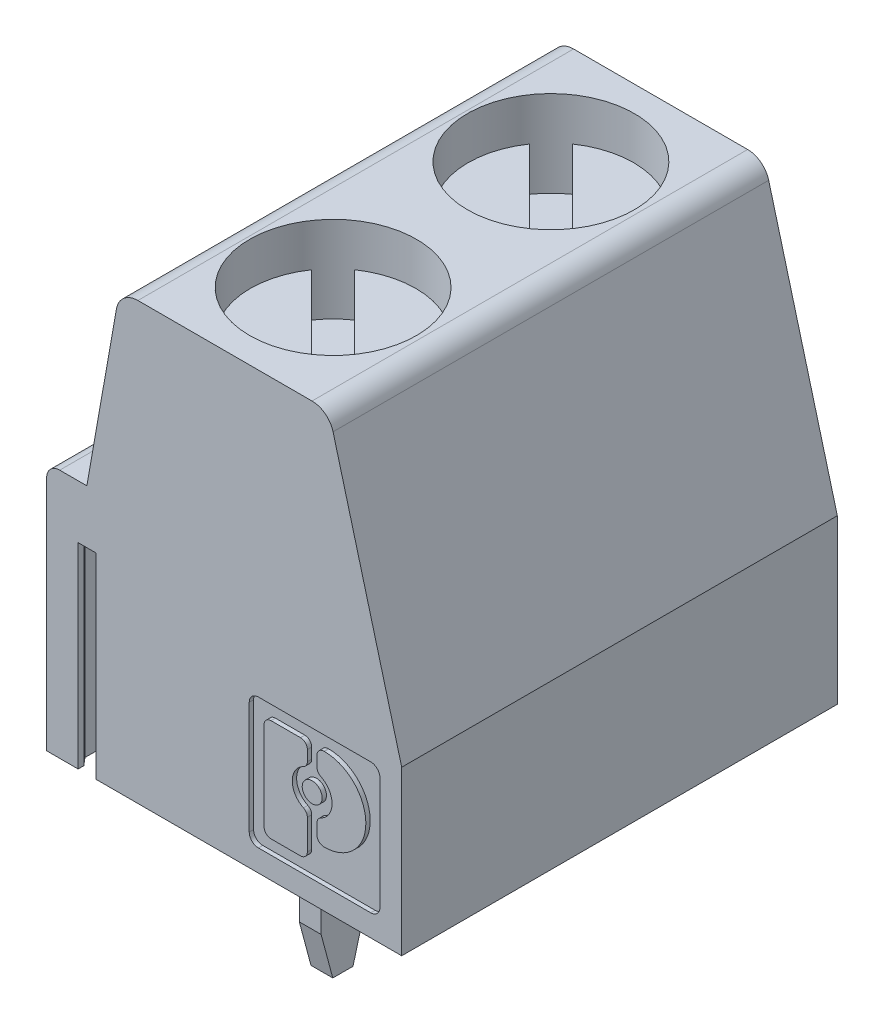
ISO-10303-21;
HEADER;
FILE_DESCRIPTION(('STEP AP214'),'2;1');
FILE_NAME('part.step','',(''),(''),'','','');
FILE_SCHEMA(('AUTOMOTIVE_DESIGN { 1 0 10303 214 1 1 1 1 }'));
ENDSEC;
DATA;
#1=APPLICATION_CONTEXT('core data for automotive mechanical design processes');
#2=APPLICATION_PROTOCOL_DEFINITION('international standard','automotive_design',2000,#1);
#3=PRODUCT_CONTEXT('',#1,'mechanical');
#4=PRODUCT('Part','Part','',(#3));
#5=PRODUCT_RELATED_PRODUCT_CATEGORY('part','',(#4));
#6=PRODUCT_DEFINITION_FORMATION('','',#4);
#7=PRODUCT_DEFINITION_CONTEXT('part definition',#1,'design');
#8=PRODUCT_DEFINITION('design','',#6,#7);
#9=PRODUCT_DEFINITION_SHAPE('','',#8);
#10=(LENGTH_UNIT() NAMED_UNIT(*) SI_UNIT(.MILLI.,.METRE.));
#11=(NAMED_UNIT(*) PLANE_ANGLE_UNIT() SI_UNIT($,.RADIAN.));
#12=(NAMED_UNIT(*) SI_UNIT($,.STERADIAN.) SOLID_ANGLE_UNIT());
#13=UNCERTAINTY_MEASURE_WITH_UNIT(LENGTH_MEASURE(1.E-05),#10,'distance_accuracy_value','');
#14=(GEOMETRIC_REPRESENTATION_CONTEXT(3) GLOBAL_UNCERTAINTY_ASSIGNED_CONTEXT((#13)) GLOBAL_UNIT_ASSIGNED_CONTEXT((#10,
#11,#12)) REPRESENTATION_CONTEXT('',''));
#15=CARTESIAN_POINT('',(0.,0.,0.));
#16=DIRECTION('',(0.,0.,1.));
#17=DIRECTION('',(1.,0.,0.));
#18=AXIS2_PLACEMENT_3D('',#15,#16,#17);
#19=CARTESIAN_POINT('',(-36.4977446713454,24.5388528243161,-4.33125891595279));
#20=DIRECTION('',(0.,1.,0.));
#21=DIRECTION('',(0.,0.,1.));
#22=AXIS2_PLACEMENT_3D('',#19,#20,#21);
#23=PLANE('',#22);
#24=CARTESIAN_POINT('',(-35.8290035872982,24.5388528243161,-5.));
#25=DIRECTION('',(0.,1.,0.));
#26=DIRECTION('',(0.,0.,1.));
#27=AXIS2_PLACEMENT_3D('',#24,#25,#26);
#28=CIRCLE('',#27,1.9);
#29=CARTESIAN_POINT('',(-34.7559796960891,24.5388528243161,-3.43200136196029));
#30=VERTEX_POINT('',#29);
#31=CARTESIAN_POINT('',(-37.3970022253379,24.5388528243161,-6.07302389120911));
#32=VERTEX_POINT('',#31);
#33=EDGE_CURVE('E626',#30,#32,#28,.F.);
#34=ORIENTED_EDGE('',*,*,#33,.F.);
#35=DIRECTION('',(-0.707106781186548,0.,-0.707106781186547));
#36=VECTOR('',#35,1.);
#37=CARTESIAN_POINT('',(-36.0764909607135,24.5388528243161,-4.75251262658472));
#38=LINE('',#37,#36);
#39=EDGE_CURVE('E917',#32,#30,#38,.F.);
#40=ORIENTED_EDGE('',*,*,#39,.F.);
#41=EDGE_LOOP('',(#34,#40));
#42=FACE_BOUND('',#41,.T.);
#43=ADVANCED_FACE('F14',(#42),#23,.T.);
#44=CARTESIAN_POINT('',(-36.0764909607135,24.5388528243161,-4.75251262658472));
#45=DIRECTION('',(0.707106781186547,0.,-0.707106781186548));
#46=DIRECTION('',(-0.707106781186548,0.,-0.707106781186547));
#47=AXIS2_PLACEMENT_3D('',#44,#45,#46);
#48=PLANE('',#47);
#49=DIRECTION('',(0.,1.,0.));
#50=VECTOR('',#49,1.);
#51=CARTESIAN_POINT('',(-37.397002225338,23.0827957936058,-6.07302389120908));
#52=LINE('',#51,#50);
#53=CARTESIAN_POINT('',(-37.3970022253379,23.5388528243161,-6.07302389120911));
#54=VERTEX_POINT('',#53);
#55=EDGE_CURVE('E618',#32,#54,#52,.F.);
#56=ORIENTED_EDGE('',*,*,#55,.F.);
#57=ORIENTED_EDGE('',*,*,#39,.T.);
#58=DIRECTION('',(0.,1.,0.));
#59=VECTOR('',#58,1.);
#60=CARTESIAN_POINT('',(-34.7559796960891,23.0827957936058,-3.43200136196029));
#61=LINE('',#60,#59);
#62=CARTESIAN_POINT('',(-34.7559796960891,23.5388528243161,-3.43200136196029));
#63=VERTEX_POINT('',#62);
#64=EDGE_CURVE('E621',#63,#30,#61,.T.);
#65=ORIENTED_EDGE('',*,*,#64,.F.);
#66=DIRECTION('',(0.707106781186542,0.,0.707106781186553));
#67=VECTOR('',#66,1.);
#68=CARTESIAN_POINT('',(-37.3970022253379,23.5388528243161,-6.07302389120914));
#69=LINE('',#68,#67);
#70=EDGE_CURVE('E913',#54,#63,#69,.T.);
#71=ORIENTED_EDGE('',*,*,#70,.F.);
#72=EDGE_LOOP('',(#56,#57,#65,#71));
#73=FACE_BOUND('',#72,.T.);
#74=ADVANCED_FACE('F924',(#73),#48,.T.);
#75=CARTESIAN_POINT('',(-35.5815162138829,23.5388528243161,-5.24748737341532));
#76=DIRECTION('',(0.,1.,0.));
#77=DIRECTION('',(0.,0.,1.));
#78=AXIS2_PLACEMENT_3D('',#75,#76,#77);
#79=PLANE('',#78);
#80=ORIENTED_EDGE('',*,*,#70,.T.);
#81=CARTESIAN_POINT('',(-35.8290035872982,23.5388528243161,-5.));
#82=DIRECTION('',(0.,1.,0.));
#83=DIRECTION('',(0.,0.,1.));
#84=AXIS2_PLACEMENT_3D('',#81,#82,#83);
#85=CIRCLE('',#84,1.9);
#86=CARTESIAN_POINT('',(-34.2610049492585,23.5388528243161,-3.92697610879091));
#87=VERTEX_POINT('',#86);
#88=EDGE_CURVE('E625',#87,#63,#85,.F.);
#89=ORIENTED_EDGE('',*,*,#88,.F.);
#90=DIRECTION('',(0.707106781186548,0.,0.707106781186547));
#91=VECTOR('',#90,1.);
#92=CARTESIAN_POINT('',(-35.5815162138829,23.5388528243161,-5.24748737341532));
#93=LINE('',#92,#91);
#94=CARTESIAN_POINT('',(-36.9020274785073,23.5388528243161,-6.56799863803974));
#95=VERTEX_POINT('',#94);
#96=EDGE_CURVE('E909',#95,#87,#93,.T.);
#97=ORIENTED_EDGE('',*,*,#96,.F.);
#98=CARTESIAN_POINT('',(-35.8290035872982,23.5388528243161,-5.));
#99=DIRECTION('',(0.,1.,0.));
#100=DIRECTION('',(0.,0.,1.));
#101=AXIS2_PLACEMENT_3D('',#98,#99,#100);
#102=CIRCLE('',#101,1.9);
#103=EDGE_CURVE('E617',#54,#95,#102,.F.);
#104=ORIENTED_EDGE('',*,*,#103,.F.);
#105=EDGE_LOOP('',(#80,#89,#97,#104));
#106=FACE_BOUND('',#105,.T.);
#107=ADVANCED_FACE('F932',(#106),#79,.T.);
#108=CARTESIAN_POINT('',(-35.5815162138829,23.5388528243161,-5.24748737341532));
#109=DIRECTION('',(-0.707106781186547,0.,0.707106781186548));
#110=DIRECTION('',(0.707106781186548,0.,0.707106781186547));
#111=AXIS2_PLACEMENT_3D('',#108,#109,#110);
#112=PLANE('',#111);
#113=ORIENTED_EDGE('',*,*,#96,.T.);
#114=DIRECTION('',(0.,1.,0.));
#115=VECTOR('',#114,1.);
#116=CARTESIAN_POINT('',(-34.2610049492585,23.0827957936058,-3.92697610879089));
#117=LINE('',#116,#115);
#118=CARTESIAN_POINT('',(-34.2610049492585,24.5388528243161,-3.92697610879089));
#119=VERTEX_POINT('',#118);
#120=EDGE_CURVE('E622',#119,#87,#117,.F.);
#121=ORIENTED_EDGE('',*,*,#120,.F.);
#122=DIRECTION('',(0.707106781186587,0.,0.707106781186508));
#123=VECTOR('',#122,1.);
#124=CARTESIAN_POINT('',(-36.9020274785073,24.5388528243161,-6.56799863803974));
#125=LINE('',#124,#123);
#126=CARTESIAN_POINT('',(-36.9020274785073,24.5388528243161,-6.56799863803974));
#127=VERTEX_POINT('',#126);
#128=EDGE_CURVE('E597',#127,#119,#125,.T.);
#129=ORIENTED_EDGE('',*,*,#128,.F.);
#130=DIRECTION('',(0.,1.,0.));
#131=VECTOR('',#130,1.);
#132=CARTESIAN_POINT('',(-36.9020274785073,23.0827957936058,-6.56799863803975));
#133=LINE('',#132,#131);
#134=EDGE_CURVE('E614',#95,#127,#133,.T.);
#135=ORIENTED_EDGE('',*,*,#134,.F.);
#136=EDGE_LOOP('',(#113,#121,#129,#135));
#137=FACE_BOUND('',#136,.T.);
#138=ADVANCED_FACE('F937',(#137),#112,.T.);
#139=CARTESIAN_POINT('',(-36.4977446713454,24.5388528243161,-4.33125891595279));
#140=DIRECTION('',(0.,1.,0.));
#141=DIRECTION('',(0.,0.,1.));
#142=AXIS2_PLACEMENT_3D('',#139,#140,#141);
#143=PLANE('',#142);
#144=ORIENTED_EDGE('',*,*,#128,.T.);
#145=CARTESIAN_POINT('',(-35.8290035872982,24.5388528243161,-5.));
#146=DIRECTION('',(0.,1.,0.));
#147=DIRECTION('',(0.,0.,1.));
#148=AXIS2_PLACEMENT_3D('',#145,#146,#147);
#149=CIRCLE('',#148,1.9);
#150=EDGE_CURVE('E613',#127,#119,#149,.F.);
#151=ORIENTED_EDGE('',*,*,#150,.F.);
#152=EDGE_LOOP('',(#144,#151));
#153=FACE_BOUND('',#152,.T.);
#154=ADVANCED_FACE('F939',(#153),#143,.T.);
#155=CARTESIAN_POINT('',(-36.4977446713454,24.5388528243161,0.668741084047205));
#156=DIRECTION('',(0.,1.,0.));
#157=DIRECTION('',(0.,0.,1.));
#158=AXIS2_PLACEMENT_3D('',#155,#156,#157);
#159=PLANE('',#158);
#160=CARTESIAN_POINT('',(-35.8290035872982,24.5388528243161,0.));
#161=DIRECTION('',(0.,1.,0.));
#162=DIRECTION('',(0.,0.,1.));
#163=AXIS2_PLACEMENT_3D('',#160,#161,#162);
#164=CIRCLE('',#163,1.9);
#165=CARTESIAN_POINT('',(-36.9020274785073,24.5388528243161,-1.56799863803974));
#166=VERTEX_POINT('',#165);
#167=CARTESIAN_POINT('',(-34.2610049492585,24.5388528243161,1.07302389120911));
#168=VERTEX_POINT('',#167);
#169=EDGE_CURVE('E581',#166,#168,#164,.F.);
#170=ORIENTED_EDGE('',*,*,#169,.F.);
#171=DIRECTION('',(0.707106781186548,0.,0.707106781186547));
#172=VECTOR('',#171,1.);
#173=CARTESIAN_POINT('',(-35.5815162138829,24.5388528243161,-0.247487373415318));
#174=LINE('',#173,#172);
#175=EDGE_CURVE('E593',#168,#166,#174,.F.);
#176=ORIENTED_EDGE('',*,*,#175,.F.);
#177=EDGE_LOOP('',(#170,#176));
#178=FACE_BOUND('',#177,.T.);
#179=ADVANCED_FACE('F594',(#178),#159,.T.);
#180=CARTESIAN_POINT('',(-35.5815162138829,23.5388528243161,-0.247487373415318));
#181=DIRECTION('',(-0.707106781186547,0.,0.707106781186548));
#182=DIRECTION('',(0.707106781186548,0.,0.707106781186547));
#183=AXIS2_PLACEMENT_3D('',#180,#181,#182);
#184=PLANE('',#183);
#185=DIRECTION('',(0.,1.,0.));
#186=VECTOR('',#185,1.);
#187=CARTESIAN_POINT('',(-34.2610049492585,23.0827957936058,1.07302389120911));
#188=LINE('',#187,#186);
#189=CARTESIAN_POINT('',(-34.2610049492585,23.5388528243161,1.07302389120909));
#190=VERTEX_POINT('',#189);
#191=EDGE_CURVE('E587',#168,#190,#188,.F.);
#192=ORIENTED_EDGE('',*,*,#191,.F.);
#193=ORIENTED_EDGE('',*,*,#175,.T.);
#194=DIRECTION('',(0.,1.,0.));
#195=VECTOR('',#194,1.);
#196=CARTESIAN_POINT('',(-36.9020274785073,23.0827957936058,-1.56799863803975));
#197=LINE('',#196,#195);
#198=CARTESIAN_POINT('',(-36.9020274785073,23.5388528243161,-1.56799863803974));
#199=VERTEX_POINT('',#198);
#200=EDGE_CURVE('E590',#199,#166,#197,.T.);
#201=ORIENTED_EDGE('',*,*,#200,.F.);
#202=DIRECTION('',(-0.707106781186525,0.,-0.70710678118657));
#203=VECTOR('',#202,1.);
#204=CARTESIAN_POINT('',(-34.2610049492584,23.5388528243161,1.07302389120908));
#205=LINE('',#204,#203);
#206=EDGE_CURVE('E596',#190,#199,#205,.T.);
#207=ORIENTED_EDGE('',*,*,#206,.F.);
#208=EDGE_LOOP('',(#192,#193,#201,#207));
#209=FACE_BOUND('',#208,.T.);
#210=ADVANCED_FACE('F599',(#209),#184,.T.);
#211=CARTESIAN_POINT('',(-35.5815162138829,23.5388528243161,-0.247487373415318));
#212=DIRECTION('',(0.,1.,0.));
#213=DIRECTION('',(0.,0.,1.));
#214=AXIS2_PLACEMENT_3D('',#211,#212,#213);
#215=PLANE('',#214);
#216=CARTESIAN_POINT('',(-35.8290035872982,23.5388528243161,0.));
#217=DIRECTION('',(0.,1.,0.));
#218=DIRECTION('',(0.,0.,1.));
#219=AXIS2_PLACEMENT_3D('',#216,#217,#218);
#220=CIRCLE('',#219,1.9);
#221=CARTESIAN_POINT('',(-34.7559796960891,23.5388528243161,1.56799863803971));
#222=VERTEX_POINT('',#221);
#223=EDGE_CURVE('E601',#190,#222,#220,.F.);
#224=ORIENTED_EDGE('',*,*,#223,.F.);
#225=ORIENTED_EDGE('',*,*,#206,.T.);
#226=CARTESIAN_POINT('',(-35.8290035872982,23.5388528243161,0.));
#227=DIRECTION('',(0.,1.,0.));
#228=DIRECTION('',(0.,0.,1.));
#229=AXIS2_PLACEMENT_3D('',#226,#227,#228);
#230=CIRCLE('',#229,1.9);
#231=CARTESIAN_POINT('',(-37.3970022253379,23.5388528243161,-1.07302389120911));
#232=VERTEX_POINT('',#231);
#233=EDGE_CURVE('E609',#232,#199,#230,.F.);
#234=ORIENTED_EDGE('',*,*,#233,.F.);
#235=DIRECTION('',(-0.707106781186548,0.,-0.707106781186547));
#236=VECTOR('',#235,1.);
#237=CARTESIAN_POINT('',(-36.0764909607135,23.5388528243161,0.247487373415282));
#238=LINE('',#237,#236);
#239=EDGE_CURVE('E897',#222,#232,#238,.T.);
#240=ORIENTED_EDGE('',*,*,#239,.F.);
#241=EDGE_LOOP('',(#224,#225,#234,#240));
#242=FACE_BOUND('',#241,.T.);
#243=ADVANCED_FACE('F1391',(#242),#215,.T.);
#244=CARTESIAN_POINT('',(-36.0764909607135,24.5388528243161,0.247487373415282));
#245=DIRECTION('',(0.707106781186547,0.,-0.707106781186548));
#246=DIRECTION('',(-0.707106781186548,0.,-0.707106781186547));
#247=AXIS2_PLACEMENT_3D('',#244,#245,#246);
#248=PLANE('',#247);
#249=ORIENTED_EDGE('',*,*,#239,.T.);
#250=DIRECTION('',(0.,1.,0.));
#251=VECTOR('',#250,1.);
#252=CARTESIAN_POINT('',(-37.397002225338,23.0827957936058,-1.07302389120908));
#253=LINE('',#252,#251);
#254=CARTESIAN_POINT('',(-37.397002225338,24.5388528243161,-1.07302389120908));
#255=VERTEX_POINT('',#254);
#256=EDGE_CURVE('E610',#255,#232,#253,.F.);
#257=ORIENTED_EDGE('',*,*,#256,.F.);
#258=DIRECTION('',(-0.707106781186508,0.,-0.707106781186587));
#259=VECTOR('',#258,1.);
#260=CARTESIAN_POINT('',(-34.7559796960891,24.5388528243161,1.56799863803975));
#261=LINE('',#260,#259);
#262=CARTESIAN_POINT('',(-34.7559796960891,24.5388528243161,1.56799863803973));
#263=VERTEX_POINT('',#262);
#264=EDGE_CURVE('E894',#263,#255,#261,.T.);
#265=ORIENTED_EDGE('',*,*,#264,.F.);
#266=DIRECTION('',(0.,1.,0.));
#267=VECTOR('',#266,1.);
#268=CARTESIAN_POINT('',(-34.7559796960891,23.0827957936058,1.56799863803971));
#269=LINE('',#268,#267);
#270=EDGE_CURVE('E603',#222,#263,#269,.T.);
#271=ORIENTED_EDGE('',*,*,#270,.F.);
#272=EDGE_LOOP('',(#249,#257,#265,#271));
#273=FACE_BOUND('',#272,.T.);
#274=ADVANCED_FACE('F1387',(#273),#248,.T.);
#275=CARTESIAN_POINT('',(-36.4977446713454,24.5388528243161,0.668741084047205));
#276=DIRECTION('',(0.,1.,0.));
#277=DIRECTION('',(0.,0.,1.));
#278=AXIS2_PLACEMENT_3D('',#275,#276,#277);
#279=PLANE('',#278);
#280=ORIENTED_EDGE('',*,*,#264,.T.);
#281=CARTESIAN_POINT('',(-35.8290035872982,24.5388528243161,0.));
#282=DIRECTION('',(0.,1.,0.));
#283=DIRECTION('',(0.,0.,1.));
#284=AXIS2_PLACEMENT_3D('',#281,#282,#283);
#285=CIRCLE('',#284,1.9);
#286=EDGE_CURVE('E880',#263,#255,#285,.F.);
#287=ORIENTED_EDGE('',*,*,#286,.F.);
#288=EDGE_LOOP('',(#280,#287));
#289=FACE_BOUND('',#288,.T.);
#290=ADVANCED_FACE('F1383',(#289),#279,.T.);
#291=CARTESIAN_POINT('',(-35.6040035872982,15.0088528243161,0.5));
#292=DIRECTION('',(1.,0.,0.));
#293=DIRECTION('',(0.,0.,-1.));
#294=AXIS2_PLACEMENT_3D('',#291,#292,#293);
#295=PLANE('',#294);
#296=DIRECTION('',(0.,1.,0.));
#297=VECTOR('',#296,1.);
#298=CARTESIAN_POINT('',(-35.6040035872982,15.0088528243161,0.5));
#299=LINE('',#298,#297);
#300=CARTESIAN_POINT('',(-35.6040035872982,13.0088528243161,0.5));
#301=VERTEX_POINT('',#300);
#302=CARTESIAN_POINT('',(-35.6040035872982,15.0088528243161,0.5));
#303=VERTEX_POINT('',#302);
#304=EDGE_CURVE('E2152',#301,#303,#299,.T.);
#305=ORIENTED_EDGE('',*,*,#304,.F.);
#306=DIRECTION('',(0.,0.965925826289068,0.25881904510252));
#307=VECTOR('',#306,1.);
#308=CARTESIAN_POINT('',(-35.6040035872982,12.5088528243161,0.366025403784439));
#309=LINE('',#308,#307);
#310=CARTESIAN_POINT('',(-35.6040035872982,12.0088528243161,0.232050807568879));
#311=VERTEX_POINT('',#310);
#312=EDGE_CURVE('E2155',#301,#311,#309,.F.);
#313=ORIENTED_EDGE('',*,*,#312,.T.);
#314=DIRECTION('',(0.,0.,-1.));
#315=VECTOR('',#314,1.);
#316=CARTESIAN_POINT('',(-35.6040035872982,12.0088528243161,-5.67075988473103));
#317=LINE('',#316,#315);
#318=CARTESIAN_POINT('',(-35.6040035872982,12.0088528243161,-0.232050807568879));
#319=VERTEX_POINT('',#318);
#320=EDGE_CURVE('E2191',#319,#311,#317,.F.);
#321=ORIENTED_EDGE('',*,*,#320,.F.);
#322=DIRECTION('',(0.,-0.965925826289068,0.25881904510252));
#323=VECTOR('',#322,1.);
#324=CARTESIAN_POINT('',(-35.6040035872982,12.5088528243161,-0.366025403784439));
#325=LINE('',#324,#323);
#326=CARTESIAN_POINT('',(-35.6040035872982,13.0088528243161,-0.5));
#327=VERTEX_POINT('',#326);
#328=EDGE_CURVE('E2201',#319,#327,#325,.F.);
#329=ORIENTED_EDGE('',*,*,#328,.T.);
#330=DIRECTION('',(0.,1.,0.));
#331=VECTOR('',#330,1.);
#332=CARTESIAN_POINT('',(-35.6040035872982,15.0088528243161,-0.5));
#333=LINE('',#332,#331);
#334=CARTESIAN_POINT('',(-35.6040035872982,15.0088528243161,-0.5));
#335=VERTEX_POINT('',#334);
#336=EDGE_CURVE('E2207',#335,#327,#333,.F.);
#337=ORIENTED_EDGE('',*,*,#336,.F.);
#338=DIRECTION('',(0.,0.,-1.));
#339=VECTOR('',#338,1.);
#340=CARTESIAN_POINT('',(-35.6040035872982,15.0088528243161,0.5));
#341=LINE('',#340,#339);
#342=EDGE_CURVE('E896',#335,#303,#341,.F.);
#343=ORIENTED_EDGE('',*,*,#342,.T.);
#344=EDGE_LOOP('',(#305,#313,#321,#329,#337,#343));
#345=FACE_BOUND('',#344,.T.);
#346=ADVANCED_FACE('F1379',(#345),#295,.T.);
#347=CARTESIAN_POINT('',(-38.1940035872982,19.2288528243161,0.));
#348=DIRECTION('',(0.,1.,0.));
#349=DIRECTION('',(0.,0.,1.));
#350=AXIS2_PLACEMENT_3D('',#347,#348,#349);
#351=PLANE('',#350);
#352=DIRECTION('',(1.,0.,0.));
#353=VECTOR('',#352,1.);
#354=CARTESIAN_POINT('',(-38.1940035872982,19.2288528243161,1.375));
#355=LINE('',#354,#353);
#356=CARTESIAN_POINT('',(-38.5790035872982,19.2288528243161,1.375));
#357=VERTEX_POINT('',#356);
#358=CARTESIAN_POINT('',(-38.1940035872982,19.2288528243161,1.375));
#359=VERTEX_POINT('',#358);
#360=EDGE_CURVE('E2278',#357,#359,#355,.T.);
#361=ORIENTED_EDGE('',*,*,#360,.F.);
#362=DIRECTION('',(0.,0.,1.));
#363=VECTOR('',#362,1.);
#364=CARTESIAN_POINT('',(-38.5790035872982,19.2288528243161,0.));
#365=LINE('',#364,#363);
#366=CARTESIAN_POINT('',(-38.5790035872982,19.2288528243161,-1.375));
#367=VERTEX_POINT('',#366);
#368=EDGE_CURVE('E2298',#357,#367,#365,.F.);
#369=ORIENTED_EDGE('',*,*,#368,.T.);
#370=DIRECTION('',(1.,0.,0.));
#371=VECTOR('',#370,1.);
#372=CARTESIAN_POINT('',(-38.1940035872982,19.2288528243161,-1.375));
#373=LINE('',#372,#371);
#374=CARTESIAN_POINT('',(-38.1940035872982,19.2288528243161,-1.375));
#375=VERTEX_POINT('',#374);
#376=EDGE_CURVE('E2303',#375,#367,#373,.F.);
#377=ORIENTED_EDGE('',*,*,#376,.F.);
#378=DIRECTION('',(0.,0.,-1.));
#379=VECTOR('',#378,1.);
#380=CARTESIAN_POINT('',(-38.1940035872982,19.2288528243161,0.));
#381=LINE('',#380,#379);
#382=EDGE_CURVE('E650',#375,#359,#381,.F.);
#383=ORIENTED_EDGE('',*,*,#382,.T.);
#384=EDGE_LOOP('',(#361,#369,#377,#383));
#385=FACE_BOUND('',#384,.T.);
#386=ADVANCED_FACE('F1375',(#385),#351,.F.);
#387=CARTESIAN_POINT('',(-38.1940035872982,19.2288528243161,-5.));
#388=DIRECTION('',(0.,1.,0.));
#389=DIRECTION('',(0.,0.,1.));
#390=AXIS2_PLACEMENT_3D('',#387,#388,#389);
#391=PLANE('',#390);
#392=DIRECTION('',(1.,0.,0.));
#393=VECTOR('',#392,1.);
#394=CARTESIAN_POINT('',(-38.1940035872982,19.2288528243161,-3.625));
#395=LINE('',#394,#393);
#396=CARTESIAN_POINT('',(-38.5790035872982,19.2288528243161,-3.625));
#397=VERTEX_POINT('',#396);
#398=CARTESIAN_POINT('',(-38.1940035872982,19.2288528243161,-3.625));
#399=VERTEX_POINT('',#398);
#400=EDGE_CURVE('E2265',#397,#399,#395,.T.);
#401=ORIENTED_EDGE('',*,*,#400,.F.);
#402=DIRECTION('',(0.,0.,1.));
#403=VECTOR('',#402,1.);
#404=CARTESIAN_POINT('',(-38.5790035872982,19.2288528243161,-5.));
#405=LINE('',#404,#403);
#406=CARTESIAN_POINT('',(-38.5790035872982,19.2288528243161,-6.375));
#407=VERTEX_POINT('',#406);
#408=EDGE_CURVE('E2271',#397,#407,#405,.F.);
#409=ORIENTED_EDGE('',*,*,#408,.T.);
#410=DIRECTION('',(1.,0.,0.));
#411=VECTOR('',#410,1.);
#412=CARTESIAN_POINT('',(-38.1940035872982,19.2288528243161,-6.375));
#413=LINE('',#412,#411);
#414=CARTESIAN_POINT('',(-38.1940035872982,19.2288528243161,-6.375));
#415=VERTEX_POINT('',#414);
#416=EDGE_CURVE('E2276',#415,#407,#413,.F.);
#417=ORIENTED_EDGE('',*,*,#416,.F.);
#418=DIRECTION('',(0.,0.,-1.));
#419=VECTOR('',#418,1.);
#420=CARTESIAN_POINT('',(-38.1940035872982,19.2288528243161,-5.));
#421=LINE('',#420,#419);
#422=EDGE_CURVE('E629',#415,#399,#421,.F.);
#423=ORIENTED_EDGE('',*,*,#422,.T.);
#424=EDGE_LOOP('',(#401,#409,#417,#423));
#425=FACE_BOUND('',#424,.T.);
#426=ADVANCED_FACE('F1371',(#425),#391,.F.);
#427=CARTESIAN_POINT('',(-39.3309629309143,15.5088528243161,-8.06999999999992));
#428=DIRECTION('',(0.,0.,-1.));
#429=DIRECTION('',(-1.,0.,0.));
#430=AXIS2_PLACEMENT_3D('',#427,#428,#429);
#431=PLANE('',#430);
#432=DIRECTION('',(-1.,0.,0.));
#433=VECTOR('',#432,1.);
#434=CARTESIAN_POINT('',(-39.3309629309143,20.0088528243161,-8.06999999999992));
#435=LINE('',#434,#433);
#436=CARTESIAN_POINT('',(-39.3309629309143,20.0088528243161,-8.06999999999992));
#437=VERTEX_POINT('',#436);
#438=CARTESIAN_POINT('',(-38.6170442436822,20.0088528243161,-8.06999999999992));
#439=VERTEX_POINT('',#438);
#440=EDGE_CURVE('E893',#437,#439,#435,.F.);
#441=ORIENTED_EDGE('',*,*,#440,.T.);
#442=DIRECTION('',(0.,1.,0.));
#443=VECTOR('',#442,1.);
#444=CARTESIAN_POINT('',(-38.6170442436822,15.5088528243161,-8.06999999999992));
#445=LINE('',#444,#443);
#446=CARTESIAN_POINT('',(-38.6170442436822,15.5088528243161,-8.06999999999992));
#447=VERTEX_POINT('',#446);
#448=EDGE_CURVE('E2445',#447,#439,#445,.T.);
#449=ORIENTED_EDGE('',*,*,#448,.F.);
#450=DIRECTION('',(-1.,0.,0.));
#451=VECTOR('',#450,1.);
#452=CARTESIAN_POINT('',(-39.3309629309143,15.5088528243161,-8.06999999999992));
#453=LINE('',#452,#451);
#454=CARTESIAN_POINT('',(-39.3309629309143,15.5088528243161,-8.06999999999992));
#455=VERTEX_POINT('',#454);
#456=EDGE_CURVE('E2262',#447,#455,#453,.T.);
#457=ORIENTED_EDGE('',*,*,#456,.T.);
#458=DIRECTION('',(0.,1.,0.));
#459=VECTOR('',#458,1.);
#460=CARTESIAN_POINT('',(-39.3309629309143,15.5088528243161,-8.06999999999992));
#461=LINE('',#460,#459);
#462=EDGE_CURVE('E2451',#437,#455,#461,.F.);
#463=ORIENTED_EDGE('',*,*,#462,.F.);
#464=EDGE_LOOP('',(#441,#449,#457,#463));
#465=FACE_BOUND('',#464,.T.);
#466=ADVANCED_FACE('F1368',(#465),#431,.T.);
#467=CARTESIAN_POINT('',(-35.8290035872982,23.0827957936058,-5.));
#468=DIRECTION('',(0.,1.,0.));
#469=DIRECTION('',(0.,0.,1.));
#470=AXIS2_PLACEMENT_3D('',#467,#468,#469);
#471=CYLINDRICAL_SURFACE('',#470,1.9);
#472=ORIENTED_EDGE('',*,*,#33,.T.);
#473=ORIENTED_EDGE('',*,*,#55,.T.);
#474=ORIENTED_EDGE('',*,*,#103,.T.);
#475=ORIENTED_EDGE('',*,*,#134,.T.);
#476=ORIENTED_EDGE('',*,*,#150,.T.);
#477=ORIENTED_EDGE('',*,*,#120,.T.);
#478=ORIENTED_EDGE('',*,*,#88,.T.);
#479=ORIENTED_EDGE('',*,*,#64,.T.);
#480=EDGE_LOOP('',(#472,#473,#474,#475,#476,#477,#478,#479));
#481=FACE_BOUND('',#480,.T.);
#482=CARTESIAN_POINT('',(-35.8290035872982,23.2388528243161,-5.));
#483=DIRECTION('',(0.,1.,0.));
#484=DIRECTION('',(0.,0.,1.));
#485=AXIS2_PLACEMENT_3D('',#482,#483,#484);
#486=CIRCLE('',#485,1.9);
#487=CARTESIAN_POINT('',(-35.8290035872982,23.2388528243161,-3.1));
#488=VERTEX_POINT('',#487);
#489=EDGE_CURVE('E861',#488,#488,#486,.T.);
#490=ORIENTED_EDGE('',*,*,#489,.T.);
#491=EDGE_LOOP('',(#490));
#492=FACE_BOUND('',#491,.T.);
#493=ADVANCED_FACE('F927',(#481,#492),#471,.T.);
#494=CARTESIAN_POINT('',(-35.8290035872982,23.0827957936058,0.));
#495=DIRECTION('',(0.,1.,0.));
#496=DIRECTION('',(0.,0.,1.));
#497=AXIS2_PLACEMENT_3D('',#494,#495,#496);
#498=CYLINDRICAL_SURFACE('',#497,1.9);
#499=ORIENTED_EDGE('',*,*,#169,.T.);
#500=ORIENTED_EDGE('',*,*,#191,.T.);
#501=ORIENTED_EDGE('',*,*,#223,.T.);
#502=ORIENTED_EDGE('',*,*,#270,.T.);
#503=ORIENTED_EDGE('',*,*,#286,.T.);
#504=ORIENTED_EDGE('',*,*,#256,.T.);
#505=ORIENTED_EDGE('',*,*,#233,.T.);
#506=ORIENTED_EDGE('',*,*,#200,.T.);
#507=EDGE_LOOP('',(#499,#500,#501,#502,#503,#504,#505,#506));
#508=FACE_BOUND('',#507,.T.);
#509=CARTESIAN_POINT('',(-35.8290035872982,23.2388528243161,0.));
#510=DIRECTION('',(0.,1.,0.));
#511=DIRECTION('',(0.,0.,1.));
#512=AXIS2_PLACEMENT_3D('',#509,#510,#511);
#513=CIRCLE('',#512,1.9);
#514=CARTESIAN_POINT('',(-35.8290035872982,23.2388528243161,1.9));
#515=VERTEX_POINT('',#514);
#516=EDGE_CURVE('E857',#515,#515,#513,.T.);
#517=ORIENTED_EDGE('',*,*,#516,.T.);
#518=EDGE_LOOP('',(#517));
#519=FACE_BOUND('',#518,.T.);
#520=ADVANCED_FACE('F583',(#508,#519),#498,.T.);
#521=CARTESIAN_POINT('',(-39.3309629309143,15.5088528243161,1.93000000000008));
#522=DIRECTION('',(0.,0.,-1.));
#523=DIRECTION('',(-1.,0.,0.));
#524=AXIS2_PLACEMENT_3D('',#521,#522,#523);
#525=PLANE('',#524);
#526=DIRECTION('',(-1.,0.,0.));
#527=VECTOR('',#526,1.);
#528=CARTESIAN_POINT('',(-39.3309629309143,20.0088528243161,1.93000000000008));
#529=LINE('',#528,#527);
#530=CARTESIAN_POINT('',(-39.3309629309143,20.0088528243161,1.93000000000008));
#531=VERTEX_POINT('',#530);
#532=CARTESIAN_POINT('',(-38.6170442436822,20.0088528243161,1.93000000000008));
#533=VERTEX_POINT('',#532);
#534=EDGE_CURVE('E2254',#531,#533,#529,.F.);
#535=ORIENTED_EDGE('',*,*,#534,.F.);
#536=DIRECTION('',(0.,1.,0.));
#537=VECTOR('',#536,1.);
#538=CARTESIAN_POINT('',(-39.3309629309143,15.5088528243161,1.93000000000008));
#539=LINE('',#538,#537);
#540=CARTESIAN_POINT('',(-39.3309629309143,15.5088528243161,1.93000000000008));
#541=VERTEX_POINT('',#540);
#542=EDGE_CURVE('E2438',#531,#541,#539,.F.);
#543=ORIENTED_EDGE('',*,*,#542,.T.);
#544=DIRECTION('',(-1.,0.,0.));
#545=VECTOR('',#544,1.);
#546=CARTESIAN_POINT('',(-39.3309629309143,15.5088528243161,1.93000000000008));
#547=LINE('',#546,#545);
#548=CARTESIAN_POINT('',(-38.6170442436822,15.5088528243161,1.93000000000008));
#549=VERTEX_POINT('',#548);
#550=EDGE_CURVE('E882',#549,#541,#547,.T.);
#551=ORIENTED_EDGE('',*,*,#550,.F.);
#552=DIRECTION('',(0.,1.,0.));
#553=VECTOR('',#552,1.);
#554=CARTESIAN_POINT('',(-38.6170442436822,15.5088528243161,1.93000000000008));
#555=LINE('',#554,#553);
#556=EDGE_CURVE('E2433',#549,#533,#555,.T.);
#557=ORIENTED_EDGE('',*,*,#556,.T.);
#558=EDGE_LOOP('',(#535,#543,#551,#557));
#559=FACE_BOUND('',#558,.T.);
#560=ADVANCED_FACE('F1359',(#559),#525,.F.);
#561=CARTESIAN_POINT('',(0.,0.,2.5));
#562=DIRECTION('',(0.,0.,1.));
#563=DIRECTION('',(1.,0.,0.));
#564=AXIS2_PLACEMENT_3D('',#561,#562,#563);
#565=PLANE('',#564);
#566=CARTESIAN_POINT('',(-33.8091598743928,17.7326607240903,2.5));
#567=DIRECTION('',(0.,0.,1.));
#568=DIRECTION('',(1.,0.,0.));
#569=AXIS2_PLACEMENT_3D('',#566,#567,#568);
#570=CIRCLE('',#569,0.456724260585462);
#571=CARTESIAN_POINT('',(-33.6097700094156,18.1435630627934,2.5));
#572=VERTEX_POINT('',#571);
#573=CARTESIAN_POINT('',(-33.6097700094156,17.3217583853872,2.5));
#574=VERTEX_POINT('',#573);
#575=EDGE_CURVE('E854',#572,#574,#570,.F.);
#576=ORIENTED_EDGE('',*,*,#575,.T.);
#577=CARTESIAN_POINT('',(-33.5407504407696,17.1795229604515,2.5));
#578=DIRECTION('',(0.,0.,1.));
#579=DIRECTION('',(1.,0.,0.));
#580=AXIS2_PLACEMENT_3D('',#577,#578,#579);
#581=CIRCLE('',#580,0.15809685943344);
#582=CARTESIAN_POINT('',(-33.698847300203,17.1795229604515,2.5));
#583=VERTEX_POINT('',#582);
#584=EDGE_CURVE('E872',#574,#583,#581,.T.);
#585=ORIENTED_EDGE('',*,*,#584,.T.);
#586=DIRECTION('',(0.,1.,0.));
#587=VECTOR('',#586,1.);
#588=CARTESIAN_POINT('',(-33.698847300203,0.,2.5));
#589=LINE('',#588,#587);
#590=CARTESIAN_POINT('',(-33.698847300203,16.9395740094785,2.5));
#591=VERTEX_POINT('',#590);
#592=EDGE_CURVE('E879',#583,#591,#589,.F.);
#593=ORIENTED_EDGE('',*,*,#592,.T.);
#594=CARTESIAN_POINT('',(-33.5407504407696,16.9395740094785,2.5));
#595=DIRECTION('',(0.,0.,1.));
#596=DIRECTION('',(1.,0.,0.));
#597=AXIS2_PLACEMENT_3D('',#594,#595,#596);
#598=CIRCLE('',#597,0.158096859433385);
#599=CARTESIAN_POINT('',(-33.5407504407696,16.7814771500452,2.5));
#600=VERTEX_POINT('',#599);
#601=EDGE_CURVE('E876',#591,#600,#598,.T.);
#602=ORIENTED_EDGE('',*,*,#601,.T.);
#603=DIRECTION('',(1.,0.,0.));
#604=VECTOR('',#603,1.);
#605=CARTESIAN_POINT('',(0.,16.7814771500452,2.5));
#606=LINE('',#605,#604);
#607=CARTESIAN_POINT('',(-33.5280987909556,16.7814771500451,2.5));
#608=VERTEX_POINT('',#607);
#609=EDGE_CURVE('E875',#600,#608,#606,.T.);
#610=ORIENTED_EDGE('',*,*,#609,.T.);
#611=CARTESIAN_POINT('',(-33.5280987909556,17.7326607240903,2.5));
#612=DIRECTION('',(0.,0.,1.));
#613=DIRECTION('',(1.,0.,0.));
#614=AXIS2_PLACEMENT_3D('',#611,#612,#613);
#615=CIRCLE('',#614,0.951183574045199);
#616=CARTESIAN_POINT('',(-33.5280987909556,18.6838442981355,2.5));
#617=VERTEX_POINT('',#616);
#618=EDGE_CURVE('E839',#617,#608,#615,.F.);
#619=ORIENTED_EDGE('',*,*,#618,.F.);
#620=DIRECTION('',(1.,0.,0.));
#621=VECTOR('',#620,1.);
#622=CARTESIAN_POINT('',(-33.5407504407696,18.6838442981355,2.5));
#623=LINE('',#622,#621);
#624=CARTESIAN_POINT('',(-33.5407504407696,18.6838442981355,2.5));
#625=VERTEX_POINT('',#624);
#626=EDGE_CURVE('E847',#617,#625,#623,.F.);
#627=ORIENTED_EDGE('',*,*,#626,.T.);
#628=CARTESIAN_POINT('',(-33.5407504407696,18.525747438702,2.5));
#629=DIRECTION('',(0.,0.,1.));
#630=DIRECTION('',(1.,0.,0.));
#631=AXIS2_PLACEMENT_3D('',#628,#629,#630);
#632=CIRCLE('',#631,0.15809685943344);
#633=CARTESIAN_POINT('',(-33.6988473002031,18.525747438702,2.5));
#634=VERTEX_POINT('',#633);
#635=EDGE_CURVE('E844',#634,#625,#632,.F.);
#636=ORIENTED_EDGE('',*,*,#635,.F.);
#637=DIRECTION('',(0.,1.,0.));
#638=VECTOR('',#637,1.);
#639=CARTESIAN_POINT('',(-33.6988473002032,18.2857984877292,2.5));
#640=LINE('',#639,#638);
#641=CARTESIAN_POINT('',(-33.6988473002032,18.2857984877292,2.5));
#642=VERTEX_POINT('',#641);
#643=EDGE_CURVE('E852',#634,#642,#640,.F.);
#644=ORIENTED_EDGE('',*,*,#643,.T.);
#645=CARTESIAN_POINT('',(-33.5407504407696,18.2857984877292,2.5));
#646=DIRECTION('',(0.,0.,1.));
#647=DIRECTION('',(1.,0.,0.));
#648=AXIS2_PLACEMENT_3D('',#645,#646,#647);
#649=CIRCLE('',#648,0.158096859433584);
#650=EDGE_CURVE('E849',#572,#642,#649,.F.);
#651=ORIENTED_EDGE('',*,*,#650,.F.);
#652=EDGE_LOOP('',(#576,#585,#593,#602,#610,#619,#627,#636,#644,#651));
#653=FACE_BOUND('',#652,.T.);
#654=ADVANCED_FACE('F1355',(#653),#565,.T.);
#655=CARTESIAN_POINT('',(0.,0.,2.5));
#656=DIRECTION('',(0.,0.,1.));
#657=DIRECTION('',(1.,0.,0.));
#658=AXIS2_PLACEMENT_3D('',#655,#656,#657);
#659=PLANE('',#658);
#660=CARTESIAN_POINT('',(-33.8091598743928,17.7326607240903,2.5));
#661=DIRECTION('',(0.,0.,1.));
#662=DIRECTION('',(1.,0.,0.));
#663=AXIS2_PLACEMENT_3D('',#660,#661,#662);
#664=CIRCLE('',#663,0.456724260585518);
#665=CARTESIAN_POINT('',(-34.00854973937,17.3217583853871,2.5));
#666=VERTEX_POINT('',#665);
#667=CARTESIAN_POINT('',(-34.00854973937,18.1435630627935,2.5));
#668=VERTEX_POINT('',#667);
#669=EDGE_CURVE('E832',#666,#668,#664,.F.);
#670=ORIENTED_EDGE('',*,*,#669,.T.);
#671=CARTESIAN_POINT('',(-34.0775693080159,18.2857984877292,2.5));
#672=DIRECTION('',(0.,0.,1.));
#673=DIRECTION('',(1.,0.,0.));
#674=AXIS2_PLACEMENT_3D('',#671,#672,#673);
#675=CIRCLE('',#674,0.158096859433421);
#676=CARTESIAN_POINT('',(-33.9194724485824,18.2857984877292,2.5));
#677=VERTEX_POINT('',#676);
#678=EDGE_CURVE('E835',#677,#668,#675,.F.);
#679=ORIENTED_EDGE('',*,*,#678,.F.);
#680=DIRECTION('',(0.,1.,0.));
#681=VECTOR('',#680,1.);
#682=CARTESIAN_POINT('',(-33.9194724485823,18.525747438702,2.5));
#683=LINE('',#682,#681);
#684=CARTESIAN_POINT('',(-33.9194724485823,18.525747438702,2.5));
#685=VERTEX_POINT('',#684);
#686=EDGE_CURVE('E2239',#677,#685,#683,.T.);
#687=ORIENTED_EDGE('',*,*,#686,.T.);
#688=CARTESIAN_POINT('',(-34.0775693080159,18.525747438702,2.5));
#689=DIRECTION('',(0.,0.,1.));
#690=DIRECTION('',(1.,0.,0.));
#691=AXIS2_PLACEMENT_3D('',#688,#689,#690);
#692=CIRCLE('',#691,0.158096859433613);
#693=CARTESIAN_POINT('',(-34.0775693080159,18.6838442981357,2.5));
#694=VERTEX_POINT('',#693);
#695=EDGE_CURVE('E869',#685,#694,#692,.T.);
#696=ORIENTED_EDGE('',*,*,#695,.T.);
#697=DIRECTION('',(1.,0.,0.));
#698=VECTOR('',#697,1.);
#699=CARTESIAN_POINT('',(0.,18.6838442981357,2.5));
#700=LINE('',#699,#698);
#701=CARTESIAN_POINT('',(-34.754188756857,18.6838442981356,2.5));
#702=VERTEX_POINT('',#701);
#703=EDGE_CURVE('E868',#694,#702,#700,.F.);
#704=ORIENTED_EDGE('',*,*,#703,.T.);
#705=CARTESIAN_POINT('',(-34.754188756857,18.5257474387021,2.5));
#706=DIRECTION('',(0.,0.,1.));
#707=DIRECTION('',(1.,0.,0.));
#708=AXIS2_PLACEMENT_3D('',#705,#706,#707);
#709=CIRCLE('',#708,0.15809685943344);
#710=CARTESIAN_POINT('',(-34.9122856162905,18.5257474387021,2.5));
#711=VERTEX_POINT('',#710);
#712=EDGE_CURVE('E865',#702,#711,#709,.T.);
#713=ORIENTED_EDGE('',*,*,#712,.T.);
#714=DIRECTION('',(0.,1.,0.));
#715=VECTOR('',#714,1.);
#716=CARTESIAN_POINT('',(-34.9122856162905,16.491958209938,2.5));
#717=LINE('',#716,#715);
#718=CARTESIAN_POINT('',(-34.9122856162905,16.491958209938,2.5));
#719=VERTEX_POINT('',#718);
#720=EDGE_CURVE('E820',#711,#719,#717,.F.);
#721=ORIENTED_EDGE('',*,*,#720,.T.);
#722=CARTESIAN_POINT('',(-34.754188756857,16.491958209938,2.5));
#723=DIRECTION('',(0.,0.,1.));
#724=DIRECTION('',(1.,0.,0.));
#725=AXIS2_PLACEMENT_3D('',#722,#723,#724);
#726=CIRCLE('',#725,0.158096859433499);
#727=CARTESIAN_POINT('',(-34.754188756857,16.3338613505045,2.5));
#728=VERTEX_POINT('',#727);
#729=EDGE_CURVE('E817',#728,#719,#726,.F.);
#730=ORIENTED_EDGE('',*,*,#729,.F.);
#731=DIRECTION('',(1.,0.,0.));
#732=VECTOR('',#731,1.);
#733=CARTESIAN_POINT('',(-34.0775693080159,16.3338613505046,2.5));
#734=LINE('',#733,#732);
#735=CARTESIAN_POINT('',(-34.0775693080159,16.3338613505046,2.5));
#736=VERTEX_POINT('',#735);
#737=EDGE_CURVE('E825',#728,#736,#734,.T.);
#738=ORIENTED_EDGE('',*,*,#737,.T.);
#739=CARTESIAN_POINT('',(-34.0775693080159,16.491958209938,2.5));
#740=DIRECTION('',(0.,0.,1.));
#741=DIRECTION('',(1.,0.,0.));
#742=AXIS2_PLACEMENT_3D('',#739,#740,#741);
#743=CIRCLE('',#742,0.158096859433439);
#744=CARTESIAN_POINT('',(-33.9194724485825,16.491958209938,2.5));
#745=VERTEX_POINT('',#744);
#746=EDGE_CURVE('E822',#745,#736,#743,.F.);
#747=ORIENTED_EDGE('',*,*,#746,.F.);
#748=DIRECTION('',(0.,1.,0.));
#749=VECTOR('',#748,1.);
#750=CARTESIAN_POINT('',(-33.9194724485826,17.1795229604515,2.5));
#751=LINE('',#750,#749);
#752=CARTESIAN_POINT('',(-33.9194724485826,17.1795229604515,2.5));
#753=VERTEX_POINT('',#752);
#754=EDGE_CURVE('E830',#745,#753,#751,.T.);
#755=ORIENTED_EDGE('',*,*,#754,.T.);
#756=CARTESIAN_POINT('',(-34.0775693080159,17.1795229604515,2.5));
#757=DIRECTION('',(0.,0.,1.));
#758=DIRECTION('',(1.,0.,0.));
#759=AXIS2_PLACEMENT_3D('',#756,#757,#758);
#760=CIRCLE('',#759,0.1580968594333);
#761=EDGE_CURVE('E827',#666,#753,#760,.F.);
#762=ORIENTED_EDGE('',*,*,#761,.F.);
#763=EDGE_LOOP('',(#670,#679,#687,#696,#704,#713,#721,#730,#738,#747,#755,#762));
#764=FACE_BOUND('',#763,.T.);
#765=ADVANCED_FACE('F1351',(#764),#659,.T.);
#766=CARTESIAN_POINT('',(0.,0.,2.5));
#767=DIRECTION('',(0.,0.,1.));
#768=DIRECTION('',(1.,0.,0.));
#769=AXIS2_PLACEMENT_3D('',#766,#767,#768);
#770=PLANE('',#769);
#771=CARTESIAN_POINT('',(-33.8091598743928,17.7326607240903,2.5));
#772=DIRECTION('',(0.,0.,1.));
#773=DIRECTION('',(1.,0.,0.));
#774=AXIS2_PLACEMENT_3D('',#771,#772,#773);
#775=CIRCLE('',#774,0.228362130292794);
#776=CARTESIAN_POINT('',(-33.5807977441,17.7326607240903,2.5));
#777=VERTEX_POINT('',#776);
#778=EDGE_CURVE('E812',#777,#777,#775,.F.);
#779=ORIENTED_EDGE('',*,*,#778,.F.);
#780=EDGE_LOOP('',(#779));
#781=FACE_BOUND('',#780,.T.);
#782=ADVANCED_FACE('F1347',(#781),#770,.T.);
#783=CARTESIAN_POINT('',(-35.6040035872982,15.0088528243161,-4.5));
#784=DIRECTION('',(1.,0.,0.));
#785=DIRECTION('',(0.,0.,-1.));
#786=AXIS2_PLACEMENT_3D('',#783,#784,#785);
#787=PLANE('',#786);
#788=DIRECTION('',(0.,1.,0.));
#789=VECTOR('',#788,1.);
#790=CARTESIAN_POINT('',(-35.6040035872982,15.0088528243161,-5.5));
#791=LINE('',#790,#789);
#792=CARTESIAN_POINT('',(-35.6040035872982,15.0088528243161,-5.5));
#793=VERTEX_POINT('',#792);
#794=CARTESIAN_POINT('',(-35.6040035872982,13.0088528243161,-5.5));
#795=VERTEX_POINT('',#794);
#796=EDGE_CURVE('E2211',#793,#795,#791,.F.);
#797=ORIENTED_EDGE('',*,*,#796,.F.);
#798=DIRECTION('',(0.,0.,-1.));
#799=VECTOR('',#798,1.);
#800=CARTESIAN_POINT('',(-35.6040035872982,15.0088528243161,-4.5));
#801=LINE('',#800,#799);
#802=CARTESIAN_POINT('',(-35.6040035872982,15.0088528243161,-4.5));
#803=VERTEX_POINT('',#802);
#804=EDGE_CURVE('E2208',#793,#803,#801,.F.);
#805=ORIENTED_EDGE('',*,*,#804,.T.);
#806=DIRECTION('',(0.,1.,0.));
#807=VECTOR('',#806,1.);
#808=CARTESIAN_POINT('',(-35.6040035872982,15.0088528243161,-4.5));
#809=LINE('',#808,#807);
#810=CARTESIAN_POINT('',(-35.6040035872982,13.0088528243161,-4.5));
#811=VERTEX_POINT('',#810);
#812=EDGE_CURVE('E2233',#811,#803,#809,.T.);
#813=ORIENTED_EDGE('',*,*,#812,.F.);
#814=DIRECTION('',(0.,-0.965925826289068,-0.25881904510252));
#815=VECTOR('',#814,1.);
#816=CARTESIAN_POINT('',(-35.6040035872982,12.5088528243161,-4.63397459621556));
#817=LINE('',#816,#815);
#818=CARTESIAN_POINT('',(-35.6040035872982,12.0088528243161,-4.76794919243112));
#819=VERTEX_POINT('',#818);
#820=EDGE_CURVE('E2228',#819,#811,#817,.F.);
#821=ORIENTED_EDGE('',*,*,#820,.F.);
#822=DIRECTION('',(0.,0.,-1.));
#823=VECTOR('',#822,1.);
#824=CARTESIAN_POINT('',(-35.6040035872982,12.0088528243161,-5.67075988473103));
#825=LINE('',#824,#823);
#826=CARTESIAN_POINT('',(-35.6040035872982,12.0088528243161,-5.23205080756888));
#827=VERTEX_POINT('',#826);
#828=EDGE_CURVE('E815',#827,#819,#825,.F.);
#829=ORIENTED_EDGE('',*,*,#828,.F.);
#830=DIRECTION('',(0.,0.965925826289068,-0.258819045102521));
#831=VECTOR('',#830,1.);
#832=CARTESIAN_POINT('',(-35.6040035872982,12.0088528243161,-5.23205080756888));
#833=LINE('',#832,#831);
#834=EDGE_CURVE('E867',#827,#795,#833,.T.);
#835=ORIENTED_EDGE('',*,*,#834,.T.);
#836=EDGE_LOOP('',(#797,#805,#813,#821,#829,#835));
#837=FACE_BOUND('',#836,.T.);
#838=ADVANCED_FACE('F1343',(#837),#787,.T.);
#839=CARTESIAN_POINT('',(-35.6040035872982,15.0088528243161,-0.5));
#840=DIRECTION('',(0.,0.,-1.));
#841=DIRECTION('',(-1.,0.,0.));
#842=AXIS2_PLACEMENT_3D('',#839,#840,#841);
#843=PLANE('',#842);
#844=DIRECTION('',(1.,0.,0.));
#845=VECTOR('',#844,1.);
#846=CARTESIAN_POINT('',(-35.8540035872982,13.0088528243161,-0.5));
#847=LINE('',#846,#845);
#848=CARTESIAN_POINT('',(-36.1040035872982,13.0088528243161,-0.499999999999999));
#849=VERTEX_POINT('',#848);
#850=EDGE_CURVE('E2192',#327,#849,#847,.F.);
#851=ORIENTED_EDGE('',*,*,#850,.T.);
#852=DIRECTION('',(0.,1.,0.));
#853=VECTOR('',#852,1.);
#854=CARTESIAN_POINT('',(-36.1040035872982,15.0088528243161,-0.5));
#855=LINE('',#854,#853);
#856=CARTESIAN_POINT('',(-36.1040035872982,15.0088528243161,-0.5));
#857=VERTEX_POINT('',#856);
#858=EDGE_CURVE('E2197',#857,#849,#855,.F.);
#859=ORIENTED_EDGE('',*,*,#858,.F.);
#860=DIRECTION('',(-1.,0.,0.));
#861=VECTOR('',#860,1.);
#862=CARTESIAN_POINT('',(-35.6040035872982,15.0088528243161,-0.5));
#863=LINE('',#862,#861);
#864=EDGE_CURVE('E2204',#857,#335,#863,.F.);
#865=ORIENTED_EDGE('',*,*,#864,.T.);
#866=ORIENTED_EDGE('',*,*,#336,.T.);
#867=EDGE_LOOP('',(#851,#859,#865,#866));
#868=FACE_BOUND('',#867,.T.);
#869=ADVANCED_FACE('F1339',(#868),#843,.T.);
#870=CARTESIAN_POINT('',(-35.8540035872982,12.5088528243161,-0.366025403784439));
#871=DIRECTION('',(0.,0.25881904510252,0.965925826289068));
#872=DIRECTION('',(0.,-0.965925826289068,0.25881904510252));
#873=AXIS2_PLACEMENT_3D('',#870,#871,#872);
#874=PLANE('',#873);
#875=DIRECTION('',(0.,-0.965925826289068,0.258819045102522));
#876=VECTOR('',#875,1.);
#877=CARTESIAN_POINT('',(-36.1040035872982,13.0088528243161,-0.5));
#878=LINE('',#877,#876);
#879=CARTESIAN_POINT('',(-36.1040035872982,12.0088528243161,-0.232050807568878));
#880=VERTEX_POINT('',#879);
#881=EDGE_CURVE('E2185',#849,#880,#878,.T.);
#882=ORIENTED_EDGE('',*,*,#881,.F.);
#883=ORIENTED_EDGE('',*,*,#850,.F.);
#884=ORIENTED_EDGE('',*,*,#328,.F.);
#885=DIRECTION('',(1.,0.,0.));
#886=VECTOR('',#885,1.);
#887=CARTESIAN_POINT('',(-36.1228207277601,12.0088528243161,-0.232050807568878));
#888=LINE('',#887,#886);
#889=EDGE_CURVE('E2188',#880,#319,#888,.T.);
#890=ORIENTED_EDGE('',*,*,#889,.F.);
#891=EDGE_LOOP('',(#882,#883,#884,#890));
#892=FACE_BOUND('',#891,.T.);
#893=ADVANCED_FACE('F1335',(#892),#874,.F.);
#894=CARTESIAN_POINT('',(-36.1228207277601,12.0088528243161,-5.67075988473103));
#895=DIRECTION('',(0.,-1.,0.));
#896=DIRECTION('',(0.,0.,-1.));
#897=AXIS2_PLACEMENT_3D('',#894,#895,#896);
#898=PLANE('',#897);
#899=ORIENTED_EDGE('',*,*,#320,.T.);
#900=DIRECTION('',(1.,0.,0.));
#901=VECTOR('',#900,1.);
#902=CARTESIAN_POINT('',(-35.8540035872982,12.0088528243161,0.232050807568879));
#903=LINE('',#902,#901);
#904=CARTESIAN_POINT('',(-36.1040035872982,12.0088528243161,0.232050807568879));
#905=VERTEX_POINT('',#904);
#906=EDGE_CURVE('E2168',#311,#905,#903,.F.);
#907=ORIENTED_EDGE('',*,*,#906,.T.);
#908=DIRECTION('',(0.,0.,1.));
#909=VECTOR('',#908,1.);
#910=CARTESIAN_POINT('',(-36.1040035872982,12.0088528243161,-0.5));
#911=LINE('',#910,#909);
#912=EDGE_CURVE('E2177',#880,#905,#911,.T.);
#913=ORIENTED_EDGE('',*,*,#912,.F.);
#914=ORIENTED_EDGE('',*,*,#889,.T.);
#915=EDGE_LOOP('',(#899,#907,#913,#914));
#916=FACE_BOUND('',#915,.T.);
#917=ADVANCED_FACE('F1331',(#916),#898,.T.);
#918=CARTESIAN_POINT('',(-35.8540035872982,12.5088528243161,0.366025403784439));
#919=DIRECTION('',(0.,0.25881904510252,-0.965925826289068));
#920=DIRECTION('',(0.,0.965925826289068,0.25881904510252));
#921=AXIS2_PLACEMENT_3D('',#918,#919,#920);
#922=PLANE('',#921);
#923=ORIENTED_EDGE('',*,*,#312,.F.);
#924=DIRECTION('',(1.,0.,0.));
#925=VECTOR('',#924,1.);
#926=CARTESIAN_POINT('',(-36.1040035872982,13.0088528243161,0.5));
#927=LINE('',#926,#925);
#928=CARTESIAN_POINT('',(-36.1040035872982,13.0088528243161,0.5));
#929=VERTEX_POINT('',#928);
#930=EDGE_CURVE('E2160',#929,#301,#927,.T.);
#931=ORIENTED_EDGE('',*,*,#930,.F.);
#932=DIRECTION('',(0.,0.965925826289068,0.258819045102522));
#933=VECTOR('',#932,1.);
#934=CARTESIAN_POINT('',(-36.1040035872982,12.0088528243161,0.232050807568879));
#935=LINE('',#934,#933);
#936=EDGE_CURVE('E2175',#905,#929,#935,.T.);
#937=ORIENTED_EDGE('',*,*,#936,.F.);
#938=ORIENTED_EDGE('',*,*,#906,.F.);
#939=EDGE_LOOP('',(#923,#931,#937,#938));
#940=FACE_BOUND('',#939,.T.);
#941=ADVANCED_FACE('F1327',(#940),#922,.F.);
#942=CARTESIAN_POINT('',(-36.1040035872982,15.0088528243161,0.5));
#943=DIRECTION('',(0.,0.,1.));
#944=DIRECTION('',(1.,0.,0.));
#945=AXIS2_PLACEMENT_3D('',#942,#943,#944);
#946=PLANE('',#945);
#947=ORIENTED_EDGE('',*,*,#930,.T.);
#948=ORIENTED_EDGE('',*,*,#304,.T.);
#949=DIRECTION('',(1.,0.,0.));
#950=VECTOR('',#949,1.);
#951=CARTESIAN_POINT('',(-36.1040035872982,15.0088528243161,0.5));
#952=LINE('',#951,#950);
#953=CARTESIAN_POINT('',(-36.1040035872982,15.0088528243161,0.5));
#954=VERTEX_POINT('',#953);
#955=EDGE_CURVE('E2166',#303,#954,#952,.F.);
#956=ORIENTED_EDGE('',*,*,#955,.T.);
#957=DIRECTION('',(0.,1.,0.));
#958=VECTOR('',#957,1.);
#959=CARTESIAN_POINT('',(-36.1040035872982,15.0088528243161,0.5));
#960=LINE('',#959,#958);
#961=EDGE_CURVE('E811',#929,#954,#960,.T.);
#962=ORIENTED_EDGE('',*,*,#961,.F.);
#963=EDGE_LOOP('',(#947,#948,#956,#962));
#964=FACE_BOUND('',#963,.T.);
#965=ADVANCED_FACE('F1323',(#964),#946,.T.);
#966=CARTESIAN_POINT('',(-38.5790035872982,19.2288528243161,0.));
#967=DIRECTION('',(0.965925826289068,0.258819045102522,0.));
#968=DIRECTION('',(-0.258819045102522,0.965925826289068,0.));
#969=AXIS2_PLACEMENT_3D('',#966,#967,#968);
#970=PLANE('',#969);
#971=DIRECTION('',(-0.2575933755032,0.961351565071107,-0.0972050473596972));
#972=VECTOR('',#971,1.);
#973=CARTESIAN_POINT('',(-38.5790035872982,19.2288528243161,-1.375));
#974=LINE('',#973,#972);
#975=CARTESIAN_POINT('',(-38.8762689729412,20.3382623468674,-1.48717561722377));
#976=VERTEX_POINT('',#975);
#977=EDGE_CURVE('E654',#367,#976,#974,.T.);
#978=ORIENTED_EDGE('',*,*,#977,.F.);
#979=ORIENTED_EDGE('',*,*,#368,.F.);
#980=DIRECTION('',(0.257593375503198,-0.961351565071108,-0.0972050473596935));
#981=VECTOR('',#980,1.);
#982=CARTESIAN_POINT('',(-38.8762689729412,20.3382623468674,1.48717561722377));
#983=LINE('',#982,#981);
#984=CARTESIAN_POINT('',(-38.8762689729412,20.3382623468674,1.48717561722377));
#985=VERTEX_POINT('',#984);
#986=EDGE_CURVE('E2159',#985,#357,#983,.T.);
#987=ORIENTED_EDGE('',*,*,#986,.F.);
#988=DIRECTION('',(0.,0.,1.));
#989=VECTOR('',#988,1.);
#990=CARTESIAN_POINT('',(-38.8762689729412,20.3382623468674,0.));
#991=LINE('',#990,#989);
#992=EDGE_CURVE('E808',#985,#976,#991,.F.);
#993=ORIENTED_EDGE('',*,*,#992,.T.);
#994=EDGE_LOOP('',(#978,#979,#987,#993));
#995=FACE_BOUND('',#994,.T.);
#996=ADVANCED_FACE('F1319',(#995),#970,.F.);
#997=CARTESIAN_POINT('',(-38.1940035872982,19.2288528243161,0.));
#998=DIRECTION('',(1.,0.,0.));
#999=DIRECTION('',(0.,0.,-1.));
#1000=AXIS2_PLACEMENT_3D('',#997,#998,#999);
#1001=PLANE('',#1000);
#1002=DIRECTION('',(0.,1.,0.));
#1003=VECTOR('',#1002,1.);
#1004=CARTESIAN_POINT('',(-38.1940035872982,0.,-1.375));
#1005=LINE('',#1004,#1003);
#1006=CARTESIAN_POINT('',(-38.1940035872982,17.2788528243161,-1.375));
#1007=VERTEX_POINT('',#1006);
#1008=EDGE_CURVE('E664',#1007,#375,#1005,.T.);
#1009=ORIENTED_EDGE('',*,*,#1008,.F.);
#1010=DIRECTION('',(0.,0.,-1.));
#1011=VECTOR('',#1010,1.);
#1012=CARTESIAN_POINT('',(-38.1940035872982,17.2788528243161,0.));
#1013=LINE('',#1012,#1011);
#1014=CARTESIAN_POINT('',(-38.1940035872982,17.2788528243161,1.375));
#1015=VERTEX_POINT('',#1014);
#1016=EDGE_CURVE('E2603',#1007,#1015,#1013,.F.);
#1017=ORIENTED_EDGE('',*,*,#1016,.T.);
#1018=DIRECTION('',(0.,1.,0.));
#1019=VECTOR('',#1018,1.);
#1020=CARTESIAN_POINT('',(-38.1940035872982,0.,1.375));
#1021=LINE('',#1020,#1019);
#1022=EDGE_CURVE('E657',#1015,#359,#1021,.T.);
#1023=ORIENTED_EDGE('',*,*,#1022,.T.);
#1024=ORIENTED_EDGE('',*,*,#382,.F.);
#1025=EDGE_LOOP('',(#1009,#1017,#1023,#1024));
#1026=FACE_BOUND('',#1025,.T.);
#1027=ADVANCED_FACE('F1315',(#1026),#1001,.F.);
#1028=CARTESIAN_POINT('',(-38.5790035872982,19.2288528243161,-5.));
#1029=DIRECTION('',(0.965925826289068,0.258819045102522,0.));
#1030=DIRECTION('',(-0.258819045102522,0.965925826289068,0.));
#1031=AXIS2_PLACEMENT_3D('',#1028,#1029,#1030);
#1032=PLANE('',#1031);
#1033=DIRECTION('',(-0.2575933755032,0.961351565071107,-0.0972050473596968));
#1034=VECTOR('',#1033,1.);
#1035=CARTESIAN_POINT('',(-38.5790035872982,19.2288528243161,-6.375));
#1036=LINE('',#1035,#1034);
#1037=CARTESIAN_POINT('',(-38.8762689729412,20.3382623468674,-6.48717561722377));
#1038=VERTEX_POINT('',#1037);
#1039=EDGE_CURVE('E633',#407,#1038,#1036,.T.);
#1040=ORIENTED_EDGE('',*,*,#1039,.F.);
#1041=ORIENTED_EDGE('',*,*,#408,.F.);
#1042=DIRECTION('',(0.257593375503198,-0.961351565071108,-0.0972050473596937));
#1043=VECTOR('',#1042,1.);
#1044=CARTESIAN_POINT('',(-38.8762689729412,20.3382623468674,-3.51282438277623));
#1045=LINE('',#1044,#1043);
#1046=CARTESIAN_POINT('',(-38.8762689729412,20.3382623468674,-3.51282438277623));
#1047=VERTEX_POINT('',#1046);
#1048=EDGE_CURVE('E653',#1047,#397,#1045,.T.);
#1049=ORIENTED_EDGE('',*,*,#1048,.F.);
#1050=DIRECTION('',(0.,0.,1.));
#1051=VECTOR('',#1050,1.);
#1052=CARTESIAN_POINT('',(-38.8762689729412,20.3382623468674,-5.));
#1053=LINE('',#1052,#1051);
#1054=EDGE_CURVE('E806',#1047,#1038,#1053,.F.);
#1055=ORIENTED_EDGE('',*,*,#1054,.T.);
#1056=EDGE_LOOP('',(#1040,#1041,#1049,#1055));
#1057=FACE_BOUND('',#1056,.T.);
#1058=ADVANCED_FACE('F1311',(#1057),#1032,.F.);
#1059=CARTESIAN_POINT('',(-38.1940035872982,19.2288528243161,-5.));
#1060=DIRECTION('',(1.,0.,0.));
#1061=DIRECTION('',(0.,0.,-1.));
#1062=AXIS2_PLACEMENT_3D('',#1059,#1060,#1061);
#1063=PLANE('',#1062);
#1064=DIRECTION('',(0.,1.,0.));
#1065=VECTOR('',#1064,1.);
#1066=CARTESIAN_POINT('',(-38.1940035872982,0.,-3.625));
#1067=LINE('',#1066,#1065);
#1068=CARTESIAN_POINT('',(-38.1940035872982,17.2788528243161,-3.625));
#1069=VERTEX_POINT('',#1068);
#1070=EDGE_CURVE('E636',#1069,#399,#1067,.T.);
#1071=ORIENTED_EDGE('',*,*,#1070,.T.);
#1072=ORIENTED_EDGE('',*,*,#422,.F.);
#1073=DIRECTION('',(0.,1.,0.));
#1074=VECTOR('',#1073,1.);
#1075=CARTESIAN_POINT('',(-38.1940035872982,0.,-6.375));
#1076=LINE('',#1075,#1074);
#1077=CARTESIAN_POINT('',(-38.1940035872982,17.2788528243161,-6.375));
#1078=VERTEX_POINT('',#1077);
#1079=EDGE_CURVE('E643',#1078,#415,#1076,.T.);
#1080=ORIENTED_EDGE('',*,*,#1079,.F.);
#1081=DIRECTION('',(0.,0.,-1.));
#1082=VECTOR('',#1081,1.);
#1083=CARTESIAN_POINT('',(-38.1940035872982,17.2788528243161,-5.));
#1084=LINE('',#1083,#1082);
#1085=EDGE_CURVE('E667',#1078,#1069,#1084,.F.);
#1086=ORIENTED_EDGE('',*,*,#1085,.T.);
#1087=EDGE_LOOP('',(#1071,#1072,#1080,#1086));
#1088=FACE_BOUND('',#1087,.T.);
#1089=ADVANCED_FACE('F1307',(#1088),#1063,.F.);
#1090=CARTESIAN_POINT('',(-39.3309629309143,15.5088528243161,-7.80702568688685));
#1091=DIRECTION('',(-1.,0.,0.));
#1092=DIRECTION('',(0.,0.,1.));
#1093=AXIS2_PLACEMENT_3D('',#1090,#1091,#1092);
#1094=PLANE('',#1093);
#1095=DIRECTION('',(0.,0.,1.));
#1096=VECTOR('',#1095,1.);
#1097=CARTESIAN_POINT('',(-39.3309629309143,20.0088528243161,-7.80702568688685));
#1098=LINE('',#1097,#1096);
#1099=CARTESIAN_POINT('',(-39.3309629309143,20.0088528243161,-7.80702568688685));
#1100=VERTEX_POINT('',#1099);
#1101=EDGE_CURVE('E2454',#1100,#437,#1098,.F.);
#1102=ORIENTED_EDGE('',*,*,#1101,.T.);
#1103=ORIENTED_EDGE('',*,*,#462,.T.);
#1104=DIRECTION('',(0.,0.,1.));
#1105=VECTOR('',#1104,1.);
#1106=CARTESIAN_POINT('',(-39.3309629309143,15.5088528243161,-7.80702568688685));
#1107=LINE('',#1106,#1105);
#1108=CARTESIAN_POINT('',(-39.3309629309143,15.5088528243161,-7.80702568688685));
#1109=VERTEX_POINT('',#1108);
#1110=EDGE_CURVE('E632',#455,#1109,#1107,.T.);
#1111=ORIENTED_EDGE('',*,*,#1110,.T.);
#1112=DIRECTION('',(0.,1.,0.));
#1113=VECTOR('',#1112,1.);
#1114=CARTESIAN_POINT('',(-39.3309629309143,15.5088528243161,-7.80702568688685));
#1115=LINE('',#1114,#1113);
#1116=EDGE_CURVE('E2563',#1100,#1109,#1115,.F.);
#1117=ORIENTED_EDGE('',*,*,#1116,.F.);
#1118=EDGE_LOOP('',(#1102,#1103,#1111,#1117));
#1119=FACE_BOUND('',#1118,.T.);
#1120=ADVANCED_FACE('F1303',(#1119),#1094,.T.);
#1121=CARTESIAN_POINT('',(-38.6170442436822,15.5088528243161,-8.06999999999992));
#1122=DIRECTION('',(1.,0.,0.));
#1123=DIRECTION('',(0.,0.,-1.));
#1124=AXIS2_PLACEMENT_3D('',#1121,#1122,#1123);
#1125=PLANE('',#1124);
#1126=DIRECTION('',(0.,0.,-1.));
#1127=VECTOR('',#1126,1.);
#1128=CARTESIAN_POINT('',(-38.6170442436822,20.0088528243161,-8.06999999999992));
#1129=LINE('',#1128,#1127);
#1130=CARTESIAN_POINT('',(-38.6170442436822,20.0088528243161,-7.80702568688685));
#1131=VERTEX_POINT('',#1130);
#1132=EDGE_CURVE('E864',#439,#1131,#1129,.F.);
#1133=ORIENTED_EDGE('',*,*,#1132,.T.);
#1134=DIRECTION('',(0.,1.,0.));
#1135=VECTOR('',#1134,1.);
#1136=CARTESIAN_POINT('',(-38.6170442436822,15.5088528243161,-7.80702568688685));
#1137=LINE('',#1136,#1135);
#1138=CARTESIAN_POINT('',(-38.6170442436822,15.5088528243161,-7.80702568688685));
#1139=VERTEX_POINT('',#1138);
#1140=EDGE_CURVE('E804',#1139,#1131,#1137,.T.);
#1141=ORIENTED_EDGE('',*,*,#1140,.F.);
#1142=DIRECTION('',(0.,0.,-1.));
#1143=VECTOR('',#1142,1.);
#1144=CARTESIAN_POINT('',(-38.6170442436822,15.5088528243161,-8.06999999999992));
#1145=LINE('',#1144,#1143);
#1146=EDGE_CURVE('E2448',#1139,#447,#1145,.T.);
#1147=ORIENTED_EDGE('',*,*,#1146,.T.);
#1148=ORIENTED_EDGE('',*,*,#448,.T.);
#1149=EDGE_LOOP('',(#1133,#1141,#1147,#1148));
#1150=FACE_BOUND('',#1149,.T.);
#1151=ADVANCED_FACE('F1299',(#1150),#1125,.T.);
#1152=CARTESIAN_POINT('',(-34.8715035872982,23.2388528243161,-5.));
#1153=DIRECTION('',(0.,-1.,0.));
#1154=DIRECTION('',(0.,0.,-1.));
#1155=AXIS2_PLACEMENT_3D('',#1152,#1153,#1154);
#1156=PLANE('',#1155);
#1157=ORIENTED_EDGE('',*,*,#489,.F.);
#1158=EDGE_LOOP('',(#1157));
#1159=FACE_BOUND('',#1158,.T.);
#1160=CARTESIAN_POINT('',(-35.8290035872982,23.2388528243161,-5.));
#1161=DIRECTION('',(0.,1.,0.));
#1162=DIRECTION('',(0.,0.,1.));
#1163=AXIS2_PLACEMENT_3D('',#1160,#1161,#1162);
#1164=CIRCLE('',#1163,1.91500000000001);
#1165=CARTESIAN_POINT('',(-35.8290035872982,23.2388528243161,-3.08499999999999));
#1166=VERTEX_POINT('',#1165);
#1167=EDGE_CURVE('E801',#1166,#1166,#1164,.T.);
#1168=ORIENTED_EDGE('',*,*,#1167,.T.);
#1169=EDGE_LOOP('',(#1168));
#1170=FACE_BOUND('',#1169,.T.);
#1171=ADVANCED_FACE('F1295',(#1159,#1170),#1156,.F.);
#1172=CARTESIAN_POINT('',(-34.8715035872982,23.2388528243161,0.));
#1173=DIRECTION('',(0.,-1.,0.));
#1174=DIRECTION('',(0.,0.,-1.));
#1175=AXIS2_PLACEMENT_3D('',#1172,#1173,#1174);
#1176=PLANE('',#1175);
#1177=CARTESIAN_POINT('',(-35.8290035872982,23.2388528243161,0.));
#1178=DIRECTION('',(0.,1.,0.));
#1179=DIRECTION('',(0.,0.,1.));
#1180=AXIS2_PLACEMENT_3D('',#1177,#1178,#1179);
#1181=CIRCLE('',#1180,1.91500000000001);
#1182=CARTESIAN_POINT('',(-35.8290035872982,23.2388528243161,1.91500000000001));
#1183=VERTEX_POINT('',#1182);
#1184=EDGE_CURVE('E798',#1183,#1183,#1181,.T.);
#1185=ORIENTED_EDGE('',*,*,#1184,.T.);
#1186=EDGE_LOOP('',(#1185));
#1187=FACE_BOUND('',#1186,.T.);
#1188=ORIENTED_EDGE('',*,*,#516,.F.);
#1189=EDGE_LOOP('',(#1188));
#1190=FACE_BOUND('',#1189,.T.);
#1191=ADVANCED_FACE('F1291',(#1187,#1190),#1176,.F.);
#1192=CARTESIAN_POINT('',(-39.3309629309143,15.5088528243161,2.19297431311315));
#1193=DIRECTION('',(-1.,0.,0.));
#1194=DIRECTION('',(0.,0.,1.));
#1195=AXIS2_PLACEMENT_3D('',#1192,#1193,#1194);
#1196=PLANE('',#1195);
#1197=DIRECTION('',(0.,0.,1.));
#1198=VECTOR('',#1197,1.);
#1199=CARTESIAN_POINT('',(-39.3309629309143,20.0088528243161,2.19297431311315));
#1200=LINE('',#1199,#1198);
#1201=CARTESIAN_POINT('',(-39.3309629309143,20.0088528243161,2.19297431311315));
#1202=VERTEX_POINT('',#1201);
#1203=EDGE_CURVE('E2441',#1202,#531,#1200,.F.);
#1204=ORIENTED_EDGE('',*,*,#1203,.F.);
#1205=DIRECTION('',(0.,1.,0.));
#1206=VECTOR('',#1205,1.);
#1207=CARTESIAN_POINT('',(-39.3309629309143,15.5088528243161,2.19297431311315));
#1208=LINE('',#1207,#1206);
#1209=CARTESIAN_POINT('',(-39.3309629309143,15.5088528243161,2.19297431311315));
#1210=VERTEX_POINT('',#1209);
#1211=EDGE_CURVE('E2544',#1202,#1210,#1208,.F.);
#1212=ORIENTED_EDGE('',*,*,#1211,.T.);
#1213=DIRECTION('',(0.,0.,1.));
#1214=VECTOR('',#1213,1.);
#1215=CARTESIAN_POINT('',(-39.3309629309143,15.5088528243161,2.19297431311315));
#1216=LINE('',#1215,#1214);
#1217=EDGE_CURVE('E860',#541,#1210,#1216,.T.);
#1218=ORIENTED_EDGE('',*,*,#1217,.F.);
#1219=ORIENTED_EDGE('',*,*,#542,.F.);
#1220=EDGE_LOOP('',(#1204,#1212,#1218,#1219));
#1221=FACE_BOUND('',#1220,.T.);
#1222=ADVANCED_FACE('F1287',(#1221),#1196,.F.);
#1223=CARTESIAN_POINT('',(-38.6170442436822,15.5088528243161,1.93000000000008));
#1224=DIRECTION('',(1.,0.,0.));
#1225=DIRECTION('',(0.,0.,-1.));
#1226=AXIS2_PLACEMENT_3D('',#1223,#1224,#1225);
#1227=PLANE('',#1226);
#1228=DIRECTION('',(0.,0.,-1.));
#1229=VECTOR('',#1228,1.);
#1230=CARTESIAN_POINT('',(-38.6170442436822,20.0088528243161,1.93000000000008));
#1231=LINE('',#1230,#1229);
#1232=CARTESIAN_POINT('',(-38.6170442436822,20.0088528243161,2.19297431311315));
#1233=VERTEX_POINT('',#1232);
#1234=EDGE_CURVE('E856',#533,#1233,#1231,.F.);
#1235=ORIENTED_EDGE('',*,*,#1234,.F.);
#1236=ORIENTED_EDGE('',*,*,#556,.F.);
#1237=DIRECTION('',(0.,0.,-1.));
#1238=VECTOR('',#1237,1.);
#1239=CARTESIAN_POINT('',(-38.6170442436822,15.5088528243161,1.93000000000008));
#1240=LINE('',#1239,#1238);
#1241=CARTESIAN_POINT('',(-38.6170442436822,15.5088528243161,2.19297431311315));
#1242=VERTEX_POINT('',#1241);
#1243=EDGE_CURVE('E2436',#1242,#549,#1240,.T.);
#1244=ORIENTED_EDGE('',*,*,#1243,.F.);
#1245=DIRECTION('',(0.,1.,0.));
#1246=VECTOR('',#1245,1.);
#1247=CARTESIAN_POINT('',(-38.6170442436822,15.5088528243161,2.19297431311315));
#1248=LINE('',#1247,#1246);
#1249=EDGE_CURVE('E792',#1242,#1233,#1248,.T.);
#1250=ORIENTED_EDGE('',*,*,#1249,.T.);
#1251=EDGE_LOOP('',(#1235,#1236,#1244,#1250));
#1252=FACE_BOUND('',#1251,.T.);
#1253=ADVANCED_FACE('F1283',(#1252),#1227,.F.);
#1254=CARTESIAN_POINT('',(-33.5407504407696,18.2857984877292,2.5));
#1255=DIRECTION('',(0.,0.,1.));
#1256=DIRECTION('',(1.,0.,0.));
#1257=AXIS2_PLACEMENT_3D('',#1254,#1255,#1256);
#1258=CYLINDRICAL_SURFACE('',#1257,0.158096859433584);
#1259=DIRECTION('',(0.,0.,1.));
#1260=VECTOR('',#1259,1.);
#1261=CARTESIAN_POINT('',(-33.6097700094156,18.1435630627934,2.5));
#1262=LINE('',#1261,#1260);
#1263=CARTESIAN_POINT('',(-33.6097700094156,18.1435630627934,2.4));
#1264=VERTEX_POINT('',#1263);
#1265=EDGE_CURVE('E853',#1264,#572,#1262,.T.);
#1266=ORIENTED_EDGE('',*,*,#1265,.T.);
#1267=ORIENTED_EDGE('',*,*,#650,.T.);
#1268=DIRECTION('',(0.,0.,-1.));
#1269=VECTOR('',#1268,1.);
#1270=CARTESIAN_POINT('',(-33.6988473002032,18.2857984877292,2.5));
#1271=LINE('',#1270,#1269);
#1272=CARTESIAN_POINT('',(-33.6988473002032,18.2857984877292,2.4));
#1273=VERTEX_POINT('',#1272);
#1274=EDGE_CURVE('E2258',#642,#1273,#1271,.T.);
#1275=ORIENTED_EDGE('',*,*,#1274,.T.);
#1276=CARTESIAN_POINT('',(-33.5407504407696,18.2857984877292,2.4));
#1277=DIRECTION('',(0.,0.,1.));
#1278=DIRECTION('',(1.,0.,0.));
#1279=AXIS2_PLACEMENT_3D('',#1276,#1277,#1278);
#1280=CIRCLE('',#1279,0.158096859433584);
#1281=EDGE_CURVE('E785',#1264,#1273,#1280,.F.);
#1282=ORIENTED_EDGE('',*,*,#1281,.F.);
#1283=EDGE_LOOP('',(#1266,#1267,#1275,#1282));
#1284=FACE_BOUND('',#1283,.T.);
#1285=ADVANCED_FACE('F1279',(#1284),#1258,.T.);
#1286=CARTESIAN_POINT('',(-33.6988473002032,18.2857984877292,2.5));
#1287=DIRECTION('',(1.,0.,0.));
#1288=DIRECTION('',(0.,0.,-1.));
#1289=AXIS2_PLACEMENT_3D('',#1286,#1287,#1288);
#1290=PLANE('',#1289);
#1291=DIRECTION('',(0.,1.,0.));
#1292=VECTOR('',#1291,1.);
#1293=CARTESIAN_POINT('',(-33.6988473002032,16.5867824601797,2.4));
#1294=LINE('',#1293,#1292);
#1295=CARTESIAN_POINT('',(-33.6988473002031,18.525747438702,2.4));
#1296=VERTEX_POINT('',#1295);
#1297=EDGE_CURVE('E784',#1273,#1296,#1294,.T.);
#1298=ORIENTED_EDGE('',*,*,#1297,.F.);
#1299=ORIENTED_EDGE('',*,*,#1274,.F.);
#1300=ORIENTED_EDGE('',*,*,#643,.F.);
#1301=DIRECTION('',(0.,0.,1.));
#1302=VECTOR('',#1301,1.);
#1303=CARTESIAN_POINT('',(-33.698847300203,18.525747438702,2.5));
#1304=LINE('',#1303,#1302);
#1305=EDGE_CURVE('E848',#1296,#634,#1304,.T.);
#1306=ORIENTED_EDGE('',*,*,#1305,.F.);
#1307=EDGE_LOOP('',(#1298,#1299,#1300,#1306));
#1308=FACE_BOUND('',#1307,.T.);
#1309=ADVANCED_FACE('F1275',(#1308),#1290,.F.);
#1310=CARTESIAN_POINT('',(-33.5407504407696,18.525747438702,2.5));
#1311=DIRECTION('',(0.,0.,1.));
#1312=DIRECTION('',(1.,0.,0.));
#1313=AXIS2_PLACEMENT_3D('',#1310,#1311,#1312);
#1314=CYLINDRICAL_SURFACE('',#1313,0.15809685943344);
#1315=ORIENTED_EDGE('',*,*,#1305,.T.);
#1316=ORIENTED_EDGE('',*,*,#635,.T.);
#1317=DIRECTION('',(0.,0.,-1.));
#1318=VECTOR('',#1317,1.);
#1319=CARTESIAN_POINT('',(-33.5407504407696,18.6838442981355,2.5));
#1320=LINE('',#1319,#1318);
#1321=CARTESIAN_POINT('',(-33.5407504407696,18.6838442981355,2.4));
#1322=VERTEX_POINT('',#1321);
#1323=EDGE_CURVE('E2256',#625,#1322,#1320,.T.);
#1324=ORIENTED_EDGE('',*,*,#1323,.T.);
#1325=CARTESIAN_POINT('',(-33.5407504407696,18.525747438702,2.4));
#1326=DIRECTION('',(0.,0.,1.));
#1327=DIRECTION('',(1.,0.,0.));
#1328=AXIS2_PLACEMENT_3D('',#1325,#1326,#1327);
#1329=CIRCLE('',#1328,0.15809685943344);
#1330=EDGE_CURVE('E781',#1296,#1322,#1329,.F.);
#1331=ORIENTED_EDGE('',*,*,#1330,.F.);
#1332=EDGE_LOOP('',(#1315,#1316,#1324,#1331));
#1333=FACE_BOUND('',#1332,.T.);
#1334=ADVANCED_FACE('F1271',(#1333),#1314,.T.);
#1335=CARTESIAN_POINT('',(-33.5407504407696,18.6838442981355,2.5));
#1336=DIRECTION('',(0.,-1.,0.));
#1337=DIRECTION('',(0.,0.,-1.));
#1338=AXIS2_PLACEMENT_3D('',#1335,#1336,#1337);
#1339=PLANE('',#1338);
#1340=DIRECTION('',(1.,0.,0.));
#1341=VECTOR('',#1340,1.);
#1342=CARTESIAN_POINT('',(-32.7590305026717,18.6838442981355,2.4));
#1343=LINE('',#1342,#1341);
#1344=CARTESIAN_POINT('',(-33.5280987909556,18.6838442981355,2.4));
#1345=VERTEX_POINT('',#1344);
#1346=EDGE_CURVE('E780',#1322,#1345,#1343,.T.);
#1347=ORIENTED_EDGE('',*,*,#1346,.F.);
#1348=ORIENTED_EDGE('',*,*,#1323,.F.);
#1349=ORIENTED_EDGE('',*,*,#626,.F.);
#1350=DIRECTION('',(0.,0.,1.));
#1351=VECTOR('',#1350,1.);
#1352=CARTESIAN_POINT('',(-33.5280987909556,18.6838442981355,2.5));
#1353=LINE('',#1352,#1351);
#1354=EDGE_CURVE('E843',#1345,#617,#1353,.T.);
#1355=ORIENTED_EDGE('',*,*,#1354,.F.);
#1356=EDGE_LOOP('',(#1347,#1348,#1349,#1355));
#1357=FACE_BOUND('',#1356,.T.);
#1358=ADVANCED_FACE('F1267',(#1357),#1339,.F.);
#1359=CARTESIAN_POINT('',(-33.5280987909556,17.7326607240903,2.5));
#1360=DIRECTION('',(0.,0.,1.));
#1361=DIRECTION('',(1.,0.,0.));
#1362=AXIS2_PLACEMENT_3D('',#1359,#1360,#1361);
#1363=CYLINDRICAL_SURFACE('',#1362,0.951183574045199);
#1364=CARTESIAN_POINT('',(-33.5280987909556,17.7326607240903,2.4));
#1365=DIRECTION('',(0.,0.,1.));
#1366=DIRECTION('',(1.,0.,0.));
#1367=AXIS2_PLACEMENT_3D('',#1364,#1365,#1366);
#1368=CIRCLE('',#1367,0.951183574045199);
#1369=CARTESIAN_POINT('',(-33.5280987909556,16.7814771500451,2.4));
#1370=VERTEX_POINT('',#1369);
#1371=EDGE_CURVE('E777',#1345,#1370,#1368,.F.);
#1372=ORIENTED_EDGE('',*,*,#1371,.F.);
#1373=ORIENTED_EDGE('',*,*,#1354,.T.);
#1374=ORIENTED_EDGE('',*,*,#618,.T.);
#1375=DIRECTION('',(0.,0.,1.));
#1376=VECTOR('',#1375,1.);
#1377=CARTESIAN_POINT('',(-33.5280987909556,16.7814771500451,2.5));
#1378=LINE('',#1377,#1376);
#1379=EDGE_CURVE('E842',#608,#1370,#1378,.F.);
#1380=ORIENTED_EDGE('',*,*,#1379,.T.);
#1381=EDGE_LOOP('',(#1372,#1373,#1374,#1380));
#1382=FACE_BOUND('',#1381,.T.);
#1383=ADVANCED_FACE('F1263',(#1382),#1363,.T.);
#1384=CARTESIAN_POINT('',(-33.5280987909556,16.7814771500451,2.5));
#1385=DIRECTION('',(0.,1.,0.));
#1386=DIRECTION('',(0.,0.,1.));
#1387=AXIS2_PLACEMENT_3D('',#1384,#1385,#1386);
#1388=PLANE('',#1387);
#1389=DIRECTION('',(1.,0.,0.));
#1390=VECTOR('',#1389,1.);
#1391=CARTESIAN_POINT('',(-32.7590305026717,16.7814771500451,2.4));
#1392=LINE('',#1391,#1390);
#1393=CARTESIAN_POINT('',(-33.5407504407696,16.7814771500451,2.4));
#1394=VERTEX_POINT('',#1393);
#1395=EDGE_CURVE('E776',#1370,#1394,#1392,.F.);
#1396=ORIENTED_EDGE('',*,*,#1395,.F.);
#1397=ORIENTED_EDGE('',*,*,#1379,.F.);
#1398=ORIENTED_EDGE('',*,*,#609,.F.);
#1399=DIRECTION('',(0.,0.,1.));
#1400=VECTOR('',#1399,1.);
#1401=CARTESIAN_POINT('',(-33.5407504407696,16.7814771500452,2.5));
#1402=LINE('',#1401,#1400);
#1403=EDGE_CURVE('E2420',#1394,#600,#1402,.T.);
#1404=ORIENTED_EDGE('',*,*,#1403,.F.);
#1405=EDGE_LOOP('',(#1396,#1397,#1398,#1404));
#1406=FACE_BOUND('',#1405,.T.);
#1407=ADVANCED_FACE('F1259',(#1406),#1388,.F.);
#1408=CARTESIAN_POINT('',(-33.5407504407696,16.9395740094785,2.5));
#1409=DIRECTION('',(0.,0.,1.));
#1410=DIRECTION('',(1.,0.,0.));
#1411=AXIS2_PLACEMENT_3D('',#1408,#1409,#1410);
#1412=CYLINDRICAL_SURFACE('',#1411,0.158096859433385);
#1413=ORIENTED_EDGE('',*,*,#1403,.T.);
#1414=ORIENTED_EDGE('',*,*,#601,.F.);
#1415=DIRECTION('',(0.,0.,-1.));
#1416=VECTOR('',#1415,1.);
#1417=CARTESIAN_POINT('',(-33.698847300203,16.9395740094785,2.5));
#1418=LINE('',#1417,#1416);
#1419=CARTESIAN_POINT('',(-33.698847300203,16.9395740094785,2.4));
#1420=VERTEX_POINT('',#1419);
#1421=EDGE_CURVE('E2418',#591,#1420,#1418,.T.);
#1422=ORIENTED_EDGE('',*,*,#1421,.T.);
#1423=CARTESIAN_POINT('',(-33.5407504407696,16.9395740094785,2.4));
#1424=DIRECTION('',(0.,0.,1.));
#1425=DIRECTION('',(1.,0.,0.));
#1426=AXIS2_PLACEMENT_3D('',#1423,#1424,#1425);
#1427=CIRCLE('',#1426,0.158096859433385);
#1428=EDGE_CURVE('E773',#1394,#1420,#1427,.F.);
#1429=ORIENTED_EDGE('',*,*,#1428,.F.);
#1430=EDGE_LOOP('',(#1413,#1414,#1422,#1429));
#1431=FACE_BOUND('',#1430,.T.);
#1432=ADVANCED_FACE('F1255',(#1431),#1412,.T.);
#1433=CARTESIAN_POINT('',(-33.698847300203,16.9395740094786,2.5));
#1434=DIRECTION('',(1.,0.,0.));
#1435=DIRECTION('',(0.,0.,-1.));
#1436=AXIS2_PLACEMENT_3D('',#1433,#1434,#1435);
#1437=PLANE('',#1436);
#1438=DIRECTION('',(0.,1.,0.));
#1439=VECTOR('',#1438,1.);
#1440=CARTESIAN_POINT('',(-33.698847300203,16.5867824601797,2.4));
#1441=LINE('',#1440,#1439);
#1442=CARTESIAN_POINT('',(-33.698847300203,17.1795229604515,2.4));
#1443=VERTEX_POINT('',#1442);
#1444=EDGE_CURVE('E772',#1420,#1443,#1441,.T.);
#1445=ORIENTED_EDGE('',*,*,#1444,.F.);
#1446=ORIENTED_EDGE('',*,*,#1421,.F.);
#1447=ORIENTED_EDGE('',*,*,#592,.F.);
#1448=DIRECTION('',(0.,0.,1.));
#1449=VECTOR('',#1448,1.);
#1450=CARTESIAN_POINT('',(-33.698847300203,17.1795229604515,2.5));
#1451=LINE('',#1450,#1449);
#1452=EDGE_CURVE('E2415',#1443,#583,#1451,.T.);
#1453=ORIENTED_EDGE('',*,*,#1452,.F.);
#1454=EDGE_LOOP('',(#1445,#1446,#1447,#1453));
#1455=FACE_BOUND('',#1454,.T.);
#1456=ADVANCED_FACE('F1251',(#1455),#1437,.F.);
#1457=CARTESIAN_POINT('',(-33.5407504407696,17.1795229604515,2.5));
#1458=DIRECTION('',(0.,0.,1.));
#1459=DIRECTION('',(1.,0.,0.));
#1460=AXIS2_PLACEMENT_3D('',#1457,#1458,#1459);
#1461=CYLINDRICAL_SURFACE('',#1460,0.15809685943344);
#1462=ORIENTED_EDGE('',*,*,#1452,.T.);
#1463=ORIENTED_EDGE('',*,*,#584,.F.);
#1464=DIRECTION('',(0.,0.,1.));
#1465=VECTOR('',#1464,1.);
#1466=CARTESIAN_POINT('',(-33.6097700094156,17.3217583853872,2.5));
#1467=LINE('',#1466,#1465);
#1468=CARTESIAN_POINT('',(-33.6097700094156,17.3217583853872,2.4));
#1469=VERTEX_POINT('',#1468);
#1470=EDGE_CURVE('E2242',#574,#1469,#1467,.F.);
#1471=ORIENTED_EDGE('',*,*,#1470,.T.);
#1472=CARTESIAN_POINT('',(-33.5407504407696,17.1795229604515,2.4));
#1473=DIRECTION('',(0.,0.,1.));
#1474=DIRECTION('',(1.,0.,0.));
#1475=AXIS2_PLACEMENT_3D('',#1472,#1473,#1474);
#1476=CIRCLE('',#1475,0.15809685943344);
#1477=EDGE_CURVE('E769',#1443,#1469,#1476,.F.);
#1478=ORIENTED_EDGE('',*,*,#1477,.F.);
#1479=EDGE_LOOP('',(#1462,#1463,#1471,#1478));
#1480=FACE_BOUND('',#1479,.T.);
#1481=ADVANCED_FACE('F1247',(#1480),#1461,.T.);
#1482=CARTESIAN_POINT('',(-33.8091598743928,17.7326607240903,2.5));
#1483=DIRECTION('',(0.,0.,1.));
#1484=DIRECTION('',(1.,0.,0.));
#1485=AXIS2_PLACEMENT_3D('',#1482,#1483,#1484);
#1486=CYLINDRICAL_SURFACE('',#1485,0.456724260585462);
#1487=CARTESIAN_POINT('',(-33.8091598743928,17.7326607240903,2.4));
#1488=DIRECTION('',(0.,0.,1.));
#1489=DIRECTION('',(1.,0.,0.));
#1490=AXIS2_PLACEMENT_3D('',#1487,#1488,#1489);
#1491=CIRCLE('',#1490,0.456724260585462);
#1492=EDGE_CURVE('E767',#1469,#1264,#1491,.T.);
#1493=ORIENTED_EDGE('',*,*,#1492,.F.);
#1494=ORIENTED_EDGE('',*,*,#1470,.F.);
#1495=ORIENTED_EDGE('',*,*,#575,.F.);
#1496=ORIENTED_EDGE('',*,*,#1265,.F.);
#1497=EDGE_LOOP('',(#1493,#1494,#1495,#1496));
#1498=FACE_BOUND('',#1497,.T.);
#1499=ADVANCED_FACE('F1243',(#1498),#1486,.F.);
#1500=CARTESIAN_POINT('',(-33.9194724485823,18.525747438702,2.5));
#1501=DIRECTION('',(-1.,0.,0.));
#1502=DIRECTION('',(0.,0.,1.));
#1503=AXIS2_PLACEMENT_3D('',#1500,#1501,#1502);
#1504=PLANE('',#1503);
#1505=DIRECTION('',(0.,1.,0.));
#1506=VECTOR('',#1505,1.);
#1507=CARTESIAN_POINT('',(-33.9194724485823,16.5867824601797,2.4));
#1508=LINE('',#1507,#1506);
#1509=CARTESIAN_POINT('',(-33.9194724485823,18.525747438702,2.4));
#1510=VERTEX_POINT('',#1509);
#1511=CARTESIAN_POINT('',(-33.9194724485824,18.2857984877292,2.4));
#1512=VERTEX_POINT('',#1511);
#1513=EDGE_CURVE('E766',#1510,#1512,#1508,.F.);
#1514=ORIENTED_EDGE('',*,*,#1513,.F.);
#1515=DIRECTION('',(0.,0.,1.));
#1516=VECTOR('',#1515,1.);
#1517=CARTESIAN_POINT('',(-33.9194724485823,18.525747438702,2.5));
#1518=LINE('',#1517,#1516);
#1519=EDGE_CURVE('E2391',#685,#1510,#1518,.F.);
#1520=ORIENTED_EDGE('',*,*,#1519,.F.);
#1521=ORIENTED_EDGE('',*,*,#686,.F.);
#1522=DIRECTION('',(0.,0.,1.));
#1523=VECTOR('',#1522,1.);
#1524=CARTESIAN_POINT('',(-33.9194724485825,18.2857984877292,2.5));
#1525=LINE('',#1524,#1523);
#1526=EDGE_CURVE('E838',#1512,#677,#1525,.T.);
#1527=ORIENTED_EDGE('',*,*,#1526,.F.);
#1528=EDGE_LOOP('',(#1514,#1520,#1521,#1527));
#1529=FACE_BOUND('',#1528,.T.);
#1530=ADVANCED_FACE('F1239',(#1529),#1504,.F.);
#1531=CARTESIAN_POINT('',(-34.0775693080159,18.2857984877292,2.5));
#1532=DIRECTION('',(0.,0.,1.));
#1533=DIRECTION('',(1.,0.,0.));
#1534=AXIS2_PLACEMENT_3D('',#1531,#1532,#1533);
#1535=CYLINDRICAL_SURFACE('',#1534,0.158096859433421);
#1536=ORIENTED_EDGE('',*,*,#1526,.T.);
#1537=ORIENTED_EDGE('',*,*,#678,.T.);
#1538=DIRECTION('',(0.,0.,1.));
#1539=VECTOR('',#1538,1.);
#1540=CARTESIAN_POINT('',(-34.00854973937,18.1435630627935,2.5));
#1541=LINE('',#1540,#1539);
#1542=CARTESIAN_POINT('',(-34.00854973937,18.1435630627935,2.4));
#1543=VERTEX_POINT('',#1542);
#1544=EDGE_CURVE('E834',#668,#1543,#1541,.F.);
#1545=ORIENTED_EDGE('',*,*,#1544,.T.);
#1546=CARTESIAN_POINT('',(-34.0775693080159,18.2857984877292,2.4));
#1547=DIRECTION('',(0.,0.,1.));
#1548=DIRECTION('',(1.,0.,0.));
#1549=AXIS2_PLACEMENT_3D('',#1546,#1547,#1548);
#1550=CIRCLE('',#1549,0.158096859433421);
#1551=EDGE_CURVE('E763',#1512,#1543,#1550,.F.);
#1552=ORIENTED_EDGE('',*,*,#1551,.F.);
#1553=EDGE_LOOP('',(#1536,#1537,#1545,#1552));
#1554=FACE_BOUND('',#1553,.T.);
#1555=ADVANCED_FACE('F1235',(#1554),#1535,.T.);
#1556=CARTESIAN_POINT('',(-33.8091598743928,17.7326607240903,2.5));
#1557=DIRECTION('',(0.,0.,1.));
#1558=DIRECTION('',(1.,0.,0.));
#1559=AXIS2_PLACEMENT_3D('',#1556,#1557,#1558);
#1560=CYLINDRICAL_SURFACE('',#1559,0.456724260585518);
#1561=CARTESIAN_POINT('',(-33.8091598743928,17.7326607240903,2.4));
#1562=DIRECTION('',(0.,0.,1.));
#1563=DIRECTION('',(1.,0.,0.));
#1564=AXIS2_PLACEMENT_3D('',#1561,#1562,#1563);
#1565=CIRCLE('',#1564,0.456724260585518);
#1566=CARTESIAN_POINT('',(-34.00854973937,17.3217583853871,2.4));
#1567=VERTEX_POINT('',#1566);
#1568=EDGE_CURVE('E760',#1543,#1567,#1565,.T.);
#1569=ORIENTED_EDGE('',*,*,#1568,.F.);
#1570=ORIENTED_EDGE('',*,*,#1544,.F.);
#1571=ORIENTED_EDGE('',*,*,#669,.F.);
#1572=DIRECTION('',(0.,0.,1.));
#1573=VECTOR('',#1572,1.);
#1574=CARTESIAN_POINT('',(-34.0085497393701,17.3217583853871,2.5));
#1575=LINE('',#1574,#1573);
#1576=EDGE_CURVE('E831',#1567,#666,#1575,.T.);
#1577=ORIENTED_EDGE('',*,*,#1576,.F.);
#1578=EDGE_LOOP('',(#1569,#1570,#1571,#1577));
#1579=FACE_BOUND('',#1578,.T.);
#1580=ADVANCED_FACE('F1231',(#1579),#1560,.F.);
#1581=CARTESIAN_POINT('',(-34.0775693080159,17.1795229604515,2.5));
#1582=DIRECTION('',(0.,0.,1.));
#1583=DIRECTION('',(1.,0.,0.));
#1584=AXIS2_PLACEMENT_3D('',#1581,#1582,#1583);
#1585=CYLINDRICAL_SURFACE('',#1584,0.1580968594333);
#1586=ORIENTED_EDGE('',*,*,#1576,.T.);
#1587=ORIENTED_EDGE('',*,*,#761,.T.);
#1588=DIRECTION('',(0.,0.,1.));
#1589=VECTOR('',#1588,1.);
#1590=CARTESIAN_POINT('',(-33.9194724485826,17.1795229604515,2.5));
#1591=LINE('',#1590,#1589);
#1592=CARTESIAN_POINT('',(-33.9194724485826,17.1795229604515,2.4));
#1593=VERTEX_POINT('',#1592);
#1594=EDGE_CURVE('E2250',#753,#1593,#1591,.F.);
#1595=ORIENTED_EDGE('',*,*,#1594,.T.);
#1596=CARTESIAN_POINT('',(-34.0775693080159,17.1795229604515,2.4));
#1597=DIRECTION('',(0.,0.,1.));
#1598=DIRECTION('',(1.,0.,0.));
#1599=AXIS2_PLACEMENT_3D('',#1596,#1597,#1598);
#1600=CIRCLE('',#1599,0.1580968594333);
#1601=EDGE_CURVE('E757',#1567,#1593,#1600,.F.);
#1602=ORIENTED_EDGE('',*,*,#1601,.F.);
#1603=EDGE_LOOP('',(#1586,#1587,#1595,#1602));
#1604=FACE_BOUND('',#1603,.T.);
#1605=ADVANCED_FACE('F1227',(#1604),#1585,.T.);
#1606=CARTESIAN_POINT('',(-33.9194724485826,17.1795229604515,2.5));
#1607=DIRECTION('',(-1.,0.,0.));
#1608=DIRECTION('',(0.,0.,1.));
#1609=AXIS2_PLACEMENT_3D('',#1606,#1607,#1608);
#1610=PLANE('',#1609);
#1611=DIRECTION('',(0.,1.,0.));
#1612=VECTOR('',#1611,1.);
#1613=CARTESIAN_POINT('',(-33.9194724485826,16.5867824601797,2.4));
#1614=LINE('',#1613,#1612);
#1615=CARTESIAN_POINT('',(-33.9194724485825,16.491958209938,2.4));
#1616=VERTEX_POINT('',#1615);
#1617=EDGE_CURVE('E756',#1593,#1616,#1614,.F.);
#1618=ORIENTED_EDGE('',*,*,#1617,.F.);
#1619=ORIENTED_EDGE('',*,*,#1594,.F.);
#1620=ORIENTED_EDGE('',*,*,#754,.F.);
#1621=DIRECTION('',(0.,0.,1.));
#1622=VECTOR('',#1621,1.);
#1623=CARTESIAN_POINT('',(-33.9194724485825,16.491958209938,2.5));
#1624=LINE('',#1623,#1622);
#1625=EDGE_CURVE('E826',#1616,#745,#1624,.T.);
#1626=ORIENTED_EDGE('',*,*,#1625,.F.);
#1627=EDGE_LOOP('',(#1618,#1619,#1620,#1626));
#1628=FACE_BOUND('',#1627,.T.);
#1629=ADVANCED_FACE('F1223',(#1628),#1610,.F.);
#1630=CARTESIAN_POINT('',(-34.0775693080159,16.491958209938,2.5));
#1631=DIRECTION('',(0.,0.,1.));
#1632=DIRECTION('',(1.,0.,0.));
#1633=AXIS2_PLACEMENT_3D('',#1630,#1631,#1632);
#1634=CYLINDRICAL_SURFACE('',#1633,0.158096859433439);
#1635=ORIENTED_EDGE('',*,*,#1625,.T.);
#1636=ORIENTED_EDGE('',*,*,#746,.T.);
#1637=DIRECTION('',(0.,0.,1.));
#1638=VECTOR('',#1637,1.);
#1639=CARTESIAN_POINT('',(-34.0775693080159,16.3338613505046,2.5));
#1640=LINE('',#1639,#1638);
#1641=CARTESIAN_POINT('',(-34.0775693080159,16.3338613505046,2.4));
#1642=VERTEX_POINT('',#1641);
#1643=EDGE_CURVE('E2248',#736,#1642,#1640,.F.);
#1644=ORIENTED_EDGE('',*,*,#1643,.T.);
#1645=CARTESIAN_POINT('',(-34.0775693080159,16.491958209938,2.4));
#1646=DIRECTION('',(0.,0.,1.));
#1647=DIRECTION('',(1.,0.,0.));
#1648=AXIS2_PLACEMENT_3D('',#1645,#1646,#1647);
#1649=CIRCLE('',#1648,0.158096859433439);
#1650=EDGE_CURVE('E753',#1616,#1642,#1649,.F.);
#1651=ORIENTED_EDGE('',*,*,#1650,.F.);
#1652=EDGE_LOOP('',(#1635,#1636,#1644,#1651));
#1653=FACE_BOUND('',#1652,.T.);
#1654=ADVANCED_FACE('F1219',(#1653),#1634,.T.);
#1655=CARTESIAN_POINT('',(-34.0775693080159,16.3338613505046,2.5));
#1656=DIRECTION('',(0.,1.,0.));
#1657=DIRECTION('',(0.,0.,1.));
#1658=AXIS2_PLACEMENT_3D('',#1655,#1656,#1657);
#1659=PLANE('',#1658);
#1660=DIRECTION('',(1.,0.,0.));
#1661=VECTOR('',#1660,1.);
#1662=CARTESIAN_POINT('',(-32.7590305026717,16.3338613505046,2.4));
#1663=LINE('',#1662,#1661);
#1664=CARTESIAN_POINT('',(-34.754188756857,16.3338613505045,2.4));
#1665=VERTEX_POINT('',#1664);
#1666=EDGE_CURVE('E752',#1642,#1665,#1663,.F.);
#1667=ORIENTED_EDGE('',*,*,#1666,.F.);
#1668=ORIENTED_EDGE('',*,*,#1643,.F.);
#1669=ORIENTED_EDGE('',*,*,#737,.F.);
#1670=DIRECTION('',(0.,0.,1.));
#1671=VECTOR('',#1670,1.);
#1672=CARTESIAN_POINT('',(-34.754188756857,16.3338613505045,2.5));
#1673=LINE('',#1672,#1671);
#1674=EDGE_CURVE('E821',#1665,#728,#1673,.T.);
#1675=ORIENTED_EDGE('',*,*,#1674,.F.);
#1676=EDGE_LOOP('',(#1667,#1668,#1669,#1675));
#1677=FACE_BOUND('',#1676,.T.);
#1678=ADVANCED_FACE('F1215',(#1677),#1659,.F.);
#1679=CARTESIAN_POINT('',(-34.754188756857,16.491958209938,2.5));
#1680=DIRECTION('',(0.,0.,1.));
#1681=DIRECTION('',(1.,0.,0.));
#1682=AXIS2_PLACEMENT_3D('',#1679,#1680,#1681);
#1683=CYLINDRICAL_SURFACE('',#1682,0.158096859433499);
#1684=ORIENTED_EDGE('',*,*,#1674,.T.);
#1685=ORIENTED_EDGE('',*,*,#729,.T.);
#1686=DIRECTION('',(0.,0.,-1.));
#1687=VECTOR('',#1686,1.);
#1688=CARTESIAN_POINT('',(-34.9122856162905,16.491958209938,2.5));
#1689=LINE('',#1688,#1687);
#1690=CARTESIAN_POINT('',(-34.9122856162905,16.491958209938,2.4));
#1691=VERTEX_POINT('',#1690);
#1692=EDGE_CURVE('E2244',#719,#1691,#1689,.T.);
#1693=ORIENTED_EDGE('',*,*,#1692,.T.);
#1694=CARTESIAN_POINT('',(-34.754188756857,16.491958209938,2.4));
#1695=DIRECTION('',(0.,0.,1.));
#1696=DIRECTION('',(1.,0.,0.));
#1697=AXIS2_PLACEMENT_3D('',#1694,#1695,#1696);
#1698=CIRCLE('',#1697,0.158096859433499);
#1699=EDGE_CURVE('E749',#1665,#1691,#1698,.F.);
#1700=ORIENTED_EDGE('',*,*,#1699,.F.);
#1701=EDGE_LOOP('',(#1684,#1685,#1693,#1700));
#1702=FACE_BOUND('',#1701,.T.);
#1703=ADVANCED_FACE('F1211',(#1702),#1683,.T.);
#1704=CARTESIAN_POINT('',(-34.9122856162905,16.491958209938,2.5));
#1705=DIRECTION('',(1.,0.,0.));
#1706=DIRECTION('',(0.,0.,-1.));
#1707=AXIS2_PLACEMENT_3D('',#1704,#1705,#1706);
#1708=PLANE('',#1707);
#1709=DIRECTION('',(0.,1.,0.));
#1710=VECTOR('',#1709,1.);
#1711=CARTESIAN_POINT('',(-34.9122856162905,16.5867824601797,2.4));
#1712=LINE('',#1711,#1710);
#1713=CARTESIAN_POINT('',(-34.9122856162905,18.5257474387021,2.4));
#1714=VERTEX_POINT('',#1713);
#1715=EDGE_CURVE('E748',#1691,#1714,#1712,.T.);
#1716=ORIENTED_EDGE('',*,*,#1715,.F.);
#1717=ORIENTED_EDGE('',*,*,#1692,.F.);
#1718=ORIENTED_EDGE('',*,*,#720,.F.);
#1719=DIRECTION('',(0.,0.,1.));
#1720=VECTOR('',#1719,1.);
#1721=CARTESIAN_POINT('',(-34.9122856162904,18.5257474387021,2.5));
#1722=LINE('',#1721,#1720);
#1723=EDGE_CURVE('E2398',#1714,#711,#1722,.T.);
#1724=ORIENTED_EDGE('',*,*,#1723,.F.);
#1725=EDGE_LOOP('',(#1716,#1717,#1718,#1724));
#1726=FACE_BOUND('',#1725,.T.);
#1727=ADVANCED_FACE('F1207',(#1726),#1708,.F.);
#1728=CARTESIAN_POINT('',(-34.754188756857,18.5257474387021,2.5));
#1729=DIRECTION('',(0.,0.,1.));
#1730=DIRECTION('',(1.,0.,0.));
#1731=AXIS2_PLACEMENT_3D('',#1728,#1729,#1730);
#1732=CYLINDRICAL_SURFACE('',#1731,0.15809685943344);
#1733=ORIENTED_EDGE('',*,*,#1723,.T.);
#1734=ORIENTED_EDGE('',*,*,#712,.F.);
#1735=DIRECTION('',(0.,0.,1.));
#1736=VECTOR('',#1735,1.);
#1737=CARTESIAN_POINT('',(-34.754188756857,18.6838442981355,2.5));
#1738=LINE('',#1737,#1736);
#1739=CARTESIAN_POINT('',(-34.754188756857,18.6838442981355,2.4));
#1740=VERTEX_POINT('',#1739);
#1741=EDGE_CURVE('E2394',#702,#1740,#1738,.F.);
#1742=ORIENTED_EDGE('',*,*,#1741,.T.);
#1743=CARTESIAN_POINT('',(-34.754188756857,18.5257474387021,2.4));
#1744=DIRECTION('',(0.,0.,1.));
#1745=DIRECTION('',(1.,0.,0.));
#1746=AXIS2_PLACEMENT_3D('',#1743,#1744,#1745);
#1747=CIRCLE('',#1746,0.15809685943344);
#1748=EDGE_CURVE('E745',#1714,#1740,#1747,.F.);
#1749=ORIENTED_EDGE('',*,*,#1748,.F.);
#1750=EDGE_LOOP('',(#1733,#1734,#1742,#1749));
#1751=FACE_BOUND('',#1750,.T.);
#1752=ADVANCED_FACE('F1203',(#1751),#1732,.T.);
#1753=CARTESIAN_POINT('',(-34.754188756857,18.6838442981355,2.5));
#1754=DIRECTION('',(0.,-1.,0.));
#1755=DIRECTION('',(1.,0.,0.));
#1756=AXIS2_PLACEMENT_3D('',#1753,#1754,#1755);
#1757=PLANE('',#1756);
#1758=DIRECTION('',(1.,0.,0.));
#1759=VECTOR('',#1758,1.);
#1760=CARTESIAN_POINT('',(-32.7590305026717,18.6838442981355,2.4));
#1761=LINE('',#1760,#1759);
#1762=CARTESIAN_POINT('',(-34.0775693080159,18.6838442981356,2.4));
#1763=VERTEX_POINT('',#1762);
#1764=EDGE_CURVE('E744',#1740,#1763,#1761,.T.);
#1765=ORIENTED_EDGE('',*,*,#1764,.F.);
#1766=ORIENTED_EDGE('',*,*,#1741,.F.);
#1767=ORIENTED_EDGE('',*,*,#703,.F.);
#1768=DIRECTION('',(0.,0.,1.));
#1769=VECTOR('',#1768,1.);
#1770=CARTESIAN_POINT('',(-34.0775693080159,18.6838442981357,2.5));
#1771=LINE('',#1770,#1769);
#1772=EDGE_CURVE('E816',#1763,#694,#1771,.T.);
#1773=ORIENTED_EDGE('',*,*,#1772,.F.);
#1774=EDGE_LOOP('',(#1765,#1766,#1767,#1773));
#1775=FACE_BOUND('',#1774,.T.);
#1776=ADVANCED_FACE('F1199',(#1775),#1757,.F.);
#1777=CARTESIAN_POINT('',(-34.0775693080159,18.525747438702,2.5));
#1778=DIRECTION('',(0.,0.,1.));
#1779=DIRECTION('',(1.,0.,0.));
#1780=AXIS2_PLACEMENT_3D('',#1777,#1778,#1779);
#1781=CYLINDRICAL_SURFACE('',#1780,0.158096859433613);
#1782=ORIENTED_EDGE('',*,*,#1772,.T.);
#1783=ORIENTED_EDGE('',*,*,#695,.F.);
#1784=ORIENTED_EDGE('',*,*,#1519,.T.);
#1785=CARTESIAN_POINT('',(-34.0775693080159,18.525747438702,2.4));
#1786=DIRECTION('',(0.,0.,1.));
#1787=DIRECTION('',(1.,0.,0.));
#1788=AXIS2_PLACEMENT_3D('',#1785,#1786,#1787);
#1789=CIRCLE('',#1788,0.158096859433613);
#1790=EDGE_CURVE('E741',#1763,#1510,#1789,.F.);
#1791=ORIENTED_EDGE('',*,*,#1790,.F.);
#1792=EDGE_LOOP('',(#1782,#1783,#1784,#1791));
#1793=FACE_BOUND('',#1792,.T.);
#1794=ADVANCED_FACE('F1195',(#1793),#1781,.T.);
#1795=CARTESIAN_POINT('',(-33.8091598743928,17.7326607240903,2.5));
#1796=DIRECTION('',(0.,0.,1.));
#1797=DIRECTION('',(1.,0.,0.));
#1798=AXIS2_PLACEMENT_3D('',#1795,#1796,#1797);
#1799=CYLINDRICAL_SURFACE('',#1798,0.228362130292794);
#1800=CARTESIAN_POINT('',(-33.8091598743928,17.7326607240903,2.4));
#1801=DIRECTION('',(0.,0.,1.));
#1802=DIRECTION('',(1.,0.,0.));
#1803=AXIS2_PLACEMENT_3D('',#1800,#1801,#1802);
#1804=CIRCLE('',#1803,0.228362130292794);
#1805=CARTESIAN_POINT('',(-33.5807977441,17.7326607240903,2.4));
#1806=VERTEX_POINT('',#1805);
#1807=EDGE_CURVE('E737',#1806,#1806,#1804,.F.);
#1808=ORIENTED_EDGE('',*,*,#1807,.F.);
#1809=EDGE_LOOP('',(#1808));
#1810=FACE_BOUND('',#1809,.T.);
#1811=ORIENTED_EDGE('',*,*,#778,.T.);
#1812=EDGE_LOOP('',(#1811));
#1813=FACE_BOUND('',#1812,.T.);
#1814=ADVANCED_FACE('F1191',(#1810,#1813),#1799,.T.);
#1815=CARTESIAN_POINT('',(-36.1228207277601,12.0088528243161,-5.67075988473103));
#1816=DIRECTION('',(0.,-1.,0.));
#1817=DIRECTION('',(0.,0.,-1.));
#1818=AXIS2_PLACEMENT_3D('',#1815,#1816,#1817);
#1819=PLANE('',#1818);
#1820=DIRECTION('',(1.,0.,0.));
#1821=VECTOR('',#1820,1.);
#1822=CARTESIAN_POINT('',(-35.8540035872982,12.0088528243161,-5.23205080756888));
#1823=LINE('',#1822,#1821);
#1824=CARTESIAN_POINT('',(-36.1040035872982,12.0088528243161,-5.23205080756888));
#1825=VERTEX_POINT('',#1824);
#1826=EDGE_CURVE('E2214',#827,#1825,#1823,.F.);
#1827=ORIENTED_EDGE('',*,*,#1826,.F.);
#1828=ORIENTED_EDGE('',*,*,#828,.T.);
#1829=DIRECTION('',(1.,0.,0.));
#1830=VECTOR('',#1829,1.);
#1831=CARTESIAN_POINT('',(-35.8540035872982,12.0088528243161,-4.76794919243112));
#1832=LINE('',#1831,#1830);
#1833=CARTESIAN_POINT('',(-36.1040035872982,12.0088528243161,-4.76794919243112));
#1834=VERTEX_POINT('',#1833);
#1835=EDGE_CURVE('E2219',#1834,#819,#1832,.T.);
#1836=ORIENTED_EDGE('',*,*,#1835,.F.);
#1837=DIRECTION('',(0.,0.,1.));
#1838=VECTOR('',#1837,1.);
#1839=CARTESIAN_POINT('',(-36.1040035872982,12.0088528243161,-5.5));
#1840=LINE('',#1839,#1838);
#1841=EDGE_CURVE('E740',#1825,#1834,#1840,.T.);
#1842=ORIENTED_EDGE('',*,*,#1841,.F.);
#1843=EDGE_LOOP('',(#1827,#1828,#1836,#1842));
#1844=FACE_BOUND('',#1843,.T.);
#1845=ADVANCED_FACE('F1187',(#1844),#1819,.T.);
#1846=CARTESIAN_POINT('',(-35.8540035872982,12.5088528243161,-4.63397459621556));
#1847=DIRECTION('',(0.,-0.25881904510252,0.965925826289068));
#1848=DIRECTION('',(0.,-0.965925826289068,-0.25881904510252));
#1849=AXIS2_PLACEMENT_3D('',#1846,#1847,#1848);
#1850=PLANE('',#1849);
#1851=DIRECTION('',(1.,0.,0.));
#1852=VECTOR('',#1851,1.);
#1853=CARTESIAN_POINT('',(-36.1040035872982,13.0088528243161,-4.5));
#1854=LINE('',#1853,#1852);
#1855=CARTESIAN_POINT('',(-36.1040035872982,13.0088528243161,-4.5));
#1856=VERTEX_POINT('',#1855);
#1857=EDGE_CURVE('E2236',#1856,#811,#1854,.T.);
#1858=ORIENTED_EDGE('',*,*,#1857,.F.);
#1859=DIRECTION('',(0.,0.965925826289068,0.258819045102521));
#1860=VECTOR('',#1859,1.);
#1861=CARTESIAN_POINT('',(-36.1040035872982,12.0088528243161,-4.76794919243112));
#1862=LINE('',#1861,#1860);
#1863=EDGE_CURVE('E2373',#1834,#1856,#1862,.T.);
#1864=ORIENTED_EDGE('',*,*,#1863,.F.);
#1865=ORIENTED_EDGE('',*,*,#1835,.T.);
#1866=ORIENTED_EDGE('',*,*,#820,.T.);
#1867=EDGE_LOOP('',(#1858,#1864,#1865,#1866));
#1868=FACE_BOUND('',#1867,.T.);
#1869=ADVANCED_FACE('F1183',(#1868),#1850,.T.);
#1870=CARTESIAN_POINT('',(-36.1040035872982,15.0088528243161,-4.5));
#1871=DIRECTION('',(0.,0.,1.));
#1872=DIRECTION('',(1.,0.,0.));
#1873=AXIS2_PLACEMENT_3D('',#1870,#1871,#1872);
#1874=PLANE('',#1873);
#1875=ORIENTED_EDGE('',*,*,#1857,.T.);
#1876=ORIENTED_EDGE('',*,*,#812,.T.);
#1877=DIRECTION('',(1.,0.,0.));
#1878=VECTOR('',#1877,1.);
#1879=CARTESIAN_POINT('',(-36.1040035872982,15.0088528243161,-4.5));
#1880=LINE('',#1879,#1878);
#1881=CARTESIAN_POINT('',(-36.1040035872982,15.0088528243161,-4.5));
#1882=VERTEX_POINT('',#1881);
#1883=EDGE_CURVE('E2230',#803,#1882,#1880,.F.);
#1884=ORIENTED_EDGE('',*,*,#1883,.T.);
#1885=DIRECTION('',(0.,1.,0.));
#1886=VECTOR('',#1885,1.);
#1887=CARTESIAN_POINT('',(-36.1040035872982,15.0088528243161,-4.5));
#1888=LINE('',#1887,#1886);
#1889=EDGE_CURVE('E2376',#1856,#1882,#1888,.T.);
#1890=ORIENTED_EDGE('',*,*,#1889,.F.);
#1891=EDGE_LOOP('',(#1875,#1876,#1884,#1890));
#1892=FACE_BOUND('',#1891,.T.);
#1893=ADVANCED_FACE('F1179',(#1892),#1874,.T.);
#1894=CARTESIAN_POINT('',(-35.6040035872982,15.0088528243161,-5.5));
#1895=DIRECTION('',(0.,0.,-1.));
#1896=DIRECTION('',(-1.,0.,0.));
#1897=AXIS2_PLACEMENT_3D('',#1894,#1895,#1896);
#1898=PLANE('',#1897);
#1899=DIRECTION('',(1.,0.,0.));
#1900=VECTOR('',#1899,1.);
#1901=CARTESIAN_POINT('',(-35.8540035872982,13.0088528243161,-5.5));
#1902=LINE('',#1901,#1900);
#1903=CARTESIAN_POINT('',(-36.1040035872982,13.0088528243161,-5.5));
#1904=VERTEX_POINT('',#1903);
#1905=EDGE_CURVE('E2340',#1904,#795,#1902,.T.);
#1906=ORIENTED_EDGE('',*,*,#1905,.F.);
#1907=DIRECTION('',(0.,1.,0.));
#1908=VECTOR('',#1907,1.);
#1909=CARTESIAN_POINT('',(-36.1040035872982,15.0088528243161,-5.5));
#1910=LINE('',#1909,#1908);
#1911=CARTESIAN_POINT('',(-36.1040035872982,15.0088528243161,-5.5));
#1912=VERTEX_POINT('',#1911);
#1913=EDGE_CURVE('E2360',#1912,#1904,#1910,.F.);
#1914=ORIENTED_EDGE('',*,*,#1913,.F.);
#1915=DIRECTION('',(-1.,0.,0.));
#1916=VECTOR('',#1915,1.);
#1917=CARTESIAN_POINT('',(-35.6040035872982,15.0088528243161,-5.5));
#1918=LINE('',#1917,#1916);
#1919=EDGE_CURVE('E2215',#1912,#793,#1918,.F.);
#1920=ORIENTED_EDGE('',*,*,#1919,.T.);
#1921=ORIENTED_EDGE('',*,*,#796,.T.);
#1922=EDGE_LOOP('',(#1906,#1914,#1920,#1921));
#1923=FACE_BOUND('',#1922,.T.);
#1924=ADVANCED_FACE('F1175',(#1923),#1898,.T.);
#1925=CARTESIAN_POINT('',(-35.8540035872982,12.5088528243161,-5.36602540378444));
#1926=DIRECTION('',(0.,-0.25881904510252,-0.965925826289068));
#1927=DIRECTION('',(0.,0.965925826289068,-0.25881904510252));
#1928=AXIS2_PLACEMENT_3D('',#1925,#1926,#1927);
#1929=PLANE('',#1928);
#1930=ORIENTED_EDGE('',*,*,#1905,.T.);
#1931=ORIENTED_EDGE('',*,*,#834,.F.);
#1932=ORIENTED_EDGE('',*,*,#1826,.T.);
#1933=DIRECTION('',(0.,-0.965925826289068,0.258819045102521));
#1934=VECTOR('',#1933,1.);
#1935=CARTESIAN_POINT('',(-36.1040035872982,13.0088528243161,-5.5));
#1936=LINE('',#1935,#1934);
#1937=EDGE_CURVE('E2357',#1904,#1825,#1936,.T.);
#1938=ORIENTED_EDGE('',*,*,#1937,.F.);
#1939=EDGE_LOOP('',(#1930,#1931,#1932,#1938));
#1940=FACE_BOUND('',#1939,.T.);
#1941=ADVANCED_FACE('F1171',(#1940),#1929,.T.);
#1942=CARTESIAN_POINT('',(-36.1040035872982,15.0088528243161,-0.5));
#1943=DIRECTION('',(-1.,0.,0.));
#1944=DIRECTION('',(0.,0.,1.));
#1945=AXIS2_PLACEMENT_3D('',#1942,#1943,#1944);
#1946=PLANE('',#1945);
#1947=ORIENTED_EDGE('',*,*,#961,.T.);
#1948=DIRECTION('',(0.,0.,-1.));
#1949=VECTOR('',#1948,1.);
#1950=CARTESIAN_POINT('',(-36.1040035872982,15.0088528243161,-5.67075988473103));
#1951=LINE('',#1950,#1949);
#1952=EDGE_CURVE('E2339',#857,#954,#1951,.F.);
#1953=ORIENTED_EDGE('',*,*,#1952,.F.);
#1954=ORIENTED_EDGE('',*,*,#858,.T.);
#1955=ORIENTED_EDGE('',*,*,#881,.T.);
#1956=ORIENTED_EDGE('',*,*,#912,.T.);
#1957=ORIENTED_EDGE('',*,*,#936,.T.);
#1958=EDGE_LOOP('',(#1947,#1953,#1954,#1955,#1956,#1957));
#1959=FACE_BOUND('',#1958,.T.);
#1960=ADVANCED_FACE('F1167',(#1959),#1946,.T.);
#1961=CARTESIAN_POINT('',(-39.3592318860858,20.2088528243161,0.));
#1962=DIRECTION('',(0.,0.,1.));
#1963=DIRECTION('',(1.,0.,0.));
#1964=AXIS2_PLACEMENT_3D('',#1961,#1962,#1963);
#1965=CYLINDRICAL_SURFACE('',#1964,0.499999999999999);
#1966=CARTESIAN_POINT('',(-39.3592318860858,20.2088528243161,-1.66942577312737));
#1967=DIRECTION('',(0.353057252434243,0.,-0.935601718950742));
#1968=DIRECTION('',(0.935601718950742,0.,0.353057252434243));
#1969=AXIS2_PLACEMENT_3D('',#1966,#1967,#1968);
#1970=ELLIPSE('',#1969,0.534415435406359,0.499999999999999);
#1971=CARTESIAN_POINT('',(-39.3592318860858,20.7088528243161,-1.66942577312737));
#1972=VERTEX_POINT('',#1971);
#1973=EDGE_CURVE('E661',#976,#1972,#1970,.F.);
#1974=ORIENTED_EDGE('',*,*,#1973,.F.);
#1975=ORIENTED_EDGE('',*,*,#992,.F.);
#1976=CARTESIAN_POINT('',(-39.3592318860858,20.2088528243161,1.66942577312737));
#1977=DIRECTION('',(0.353057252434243,0.,0.935601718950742));
#1978=DIRECTION('',(-0.935601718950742,0.,0.353057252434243));
#1979=AXIS2_PLACEMENT_3D('',#1976,#1977,#1978);
#1980=ELLIPSE('',#1979,0.534415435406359,0.499999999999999);
#1981=CARTESIAN_POINT('',(-39.3592318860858,20.7088528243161,1.66942577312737));
#1982=VERTEX_POINT('',#1981);
#1983=EDGE_CURVE('E809',#1982,#985,#1980,.F.);
#1984=ORIENTED_EDGE('',*,*,#1983,.F.);
#1985=DIRECTION('',(0.,0.,1.));
#1986=VECTOR('',#1985,1.);
#1987=CARTESIAN_POINT('',(-39.3592318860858,20.7088528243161,0.));
#1988=LINE('',#1987,#1986);
#1989=EDGE_CURVE('E2314',#1982,#1972,#1988,.F.);
#1990=ORIENTED_EDGE('',*,*,#1989,.T.);
#1991=EDGE_LOOP('',(#1974,#1975,#1984,#1990));
#1992=FACE_BOUND('',#1991,.T.);
#1993=ADVANCED_FACE('F1163',(#1992),#1965,.F.);
#1994=CARTESIAN_POINT('',(0.,0.,1.375));
#1995=DIRECTION('',(0.,0.,1.));
#1996=DIRECTION('',(1.,0.,0.));
#1997=AXIS2_PLACEMENT_3D('',#1994,#1995,#1996);
#1998=PLANE('',#1997);
#1999=ORIENTED_EDGE('',*,*,#360,.T.);
#2000=ORIENTED_EDGE('',*,*,#1022,.F.);
#2001=DIRECTION('',(1.,0.,0.));
#2002=VECTOR('',#2001,1.);
#2003=CARTESIAN_POINT('',(-38.1940035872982,17.2788528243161,1.375));
#2004=LINE('',#2003,#2002);
#2005=CARTESIAN_POINT('',(-38.5790035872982,17.2788528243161,1.375));
#2006=VERTEX_POINT('',#2005);
#2007=EDGE_CURVE('E660',#1015,#2006,#2004,.F.);
#2008=ORIENTED_EDGE('',*,*,#2007,.T.);
#2009=DIRECTION('',(0.,1.,0.));
#2010=VECTOR('',#2009,1.);
#2011=CARTESIAN_POINT('',(-38.5790035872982,17.2788528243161,1.375));
#2012=LINE('',#2011,#2010);
#2013=EDGE_CURVE('E2310',#2006,#357,#2012,.T.);
#2014=ORIENTED_EDGE('',*,*,#2013,.T.);
#2015=EDGE_LOOP('',(#1999,#2000,#2008,#2014));
#2016=FACE_BOUND('',#2015,.T.);
#2017=ADVANCED_FACE('F1159',(#2016),#1998,.F.);
#2018=CARTESIAN_POINT('',(-38.1940035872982,17.2788528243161,0.));
#2019=DIRECTION('',(0.,-1.,0.));
#2020=DIRECTION('',(0.,0.,-1.));
#2021=AXIS2_PLACEMENT_3D('',#2018,#2019,#2020);
#2022=PLANE('',#2021);
#2023=DIRECTION('',(1.,0.,0.));
#2024=VECTOR('',#2023,1.);
#2025=CARTESIAN_POINT('',(0.,17.2788528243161,-1.375));
#2026=LINE('',#2025,#2024);
#2027=CARTESIAN_POINT('',(-38.5790035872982,17.2788528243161,-1.375));
#2028=VERTEX_POINT('',#2027);
#2029=EDGE_CURVE('E668',#2028,#1007,#2026,.T.);
#2030=ORIENTED_EDGE('',*,*,#2029,.F.);
#2031=DIRECTION('',(0.,0.,1.));
#2032=VECTOR('',#2031,1.);
#2033=CARTESIAN_POINT('',(-38.5790035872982,17.2788528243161,0.));
#2034=LINE('',#2033,#2032);
#2035=EDGE_CURVE('E2488',#2028,#2006,#2034,.T.);
#2036=ORIENTED_EDGE('',*,*,#2035,.T.);
#2037=ORIENTED_EDGE('',*,*,#2007,.F.);
#2038=ORIENTED_EDGE('',*,*,#1016,.F.);
#2039=EDGE_LOOP('',(#2030,#2036,#2037,#2038));
#2040=FACE_BOUND('',#2039,.T.);
#2041=ADVANCED_FACE('F1155',(#2040),#2022,.F.);
#2042=CARTESIAN_POINT('',(0.,0.,-1.375));
#2043=DIRECTION('',(0.,0.,1.));
#2044=DIRECTION('',(1.,0.,0.));
#2045=AXIS2_PLACEMENT_3D('',#2042,#2043,#2044);
#2046=PLANE('',#2045);
#2047=ORIENTED_EDGE('',*,*,#1008,.T.);
#2048=ORIENTED_EDGE('',*,*,#376,.T.);
#2049=DIRECTION('',(0.,1.,0.));
#2050=VECTOR('',#2049,1.);
#2051=CARTESIAN_POINT('',(-38.5790035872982,17.2788528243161,-1.375));
#2052=LINE('',#2051,#2050);
#2053=EDGE_CURVE('E2291',#367,#2028,#2052,.F.);
#2054=ORIENTED_EDGE('',*,*,#2053,.T.);
#2055=ORIENTED_EDGE('',*,*,#2029,.T.);
#2056=EDGE_LOOP('',(#2047,#2048,#2054,#2055));
#2057=FACE_BOUND('',#2056,.T.);
#2058=ADVANCED_FACE('F1151',(#2057),#2046,.T.);
#2059=CARTESIAN_POINT('',(-38.1940035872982,17.2788528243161,-5.));
#2060=DIRECTION('',(0.,-1.,0.));
#2061=DIRECTION('',(0.,0.,-1.));
#2062=AXIS2_PLACEMENT_3D('',#2059,#2060,#2061);
#2063=PLANE('',#2062);
#2064=DIRECTION('',(1.,0.,0.));
#2065=VECTOR('',#2064,1.);
#2066=CARTESIAN_POINT('',(0.,17.2788528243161,-6.375));
#2067=LINE('',#2066,#2065);
#2068=CARTESIAN_POINT('',(-38.5790035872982,17.2788528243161,-6.375));
#2069=VERTEX_POINT('',#2068);
#2070=EDGE_CURVE('E647',#2069,#1078,#2067,.T.);
#2071=ORIENTED_EDGE('',*,*,#2070,.F.);
#2072=DIRECTION('',(0.,0.,1.));
#2073=VECTOR('',#2072,1.);
#2074=CARTESIAN_POINT('',(-38.5790035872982,17.2788528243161,-5.));
#2075=LINE('',#2074,#2073);
#2076=CARTESIAN_POINT('',(-38.5790035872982,17.2788528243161,-3.625));
#2077=VERTEX_POINT('',#2076);
#2078=EDGE_CURVE('E736',#2069,#2077,#2075,.T.);
#2079=ORIENTED_EDGE('',*,*,#2078,.T.);
#2080=DIRECTION('',(1.,0.,0.));
#2081=VECTOR('',#2080,1.);
#2082=CARTESIAN_POINT('',(0.,17.2788528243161,-3.625));
#2083=LINE('',#2082,#2081);
#2084=EDGE_CURVE('E640',#2077,#1069,#2083,.T.);
#2085=ORIENTED_EDGE('',*,*,#2084,.T.);
#2086=ORIENTED_EDGE('',*,*,#1085,.F.);
#2087=EDGE_LOOP('',(#2071,#2079,#2085,#2086));
#2088=FACE_BOUND('',#2087,.T.);
#2089=ADVANCED_FACE('F1147',(#2088),#2063,.F.);
#2090=CARTESIAN_POINT('',(0.,0.,-6.375));
#2091=DIRECTION('',(0.,0.,1.));
#2092=DIRECTION('',(1.,0.,0.));
#2093=AXIS2_PLACEMENT_3D('',#2090,#2091,#2092);
#2094=PLANE('',#2093);
#2095=ORIENTED_EDGE('',*,*,#1079,.T.);
#2096=ORIENTED_EDGE('',*,*,#416,.T.);
#2097=DIRECTION('',(0.,1.,0.));
#2098=VECTOR('',#2097,1.);
#2099=CARTESIAN_POINT('',(-38.5790035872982,17.2788528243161,-6.375));
#2100=LINE('',#2099,#2098);
#2101=EDGE_CURVE('E735',#407,#2069,#2100,.F.);
#2102=ORIENTED_EDGE('',*,*,#2101,.T.);
#2103=ORIENTED_EDGE('',*,*,#2070,.T.);
#2104=EDGE_LOOP('',(#2095,#2096,#2102,#2103));
#2105=FACE_BOUND('',#2104,.T.);
#2106=ADVANCED_FACE('F1143',(#2105),#2094,.T.);
#2107=CARTESIAN_POINT('',(-39.3592318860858,20.2088528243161,-5.));
#2108=DIRECTION('',(0.,0.,1.));
#2109=DIRECTION('',(1.,0.,0.));
#2110=AXIS2_PLACEMENT_3D('',#2107,#2108,#2109);
#2111=CYLINDRICAL_SURFACE('',#2110,0.499999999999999);
#2112=CARTESIAN_POINT('',(-39.3592318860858,20.2088528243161,-3.33057422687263));
#2113=DIRECTION('',(0.353057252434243,0.,0.935601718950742));
#2114=DIRECTION('',(-0.935601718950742,0.,0.353057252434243));
#2115=AXIS2_PLACEMENT_3D('',#2112,#2113,#2114);
#2116=ELLIPSE('',#2115,0.534415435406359,0.499999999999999);
#2117=CARTESIAN_POINT('',(-39.3592318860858,20.7088528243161,-3.33057422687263));
#2118=VERTEX_POINT('',#2117);
#2119=EDGE_CURVE('E646',#2118,#1047,#2116,.F.);
#2120=ORIENTED_EDGE('',*,*,#2119,.F.);
#2121=DIRECTION('',(0.,0.,1.));
#2122=VECTOR('',#2121,1.);
#2123=CARTESIAN_POINT('',(-39.3592318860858,20.7088528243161,-5.));
#2124=LINE('',#2123,#2122);
#2125=CARTESIAN_POINT('',(-39.3592318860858,20.7088528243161,-6.66942577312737));
#2126=VERTEX_POINT('',#2125);
#2127=EDGE_CURVE('E2573',#2118,#2126,#2124,.F.);
#2128=ORIENTED_EDGE('',*,*,#2127,.T.);
#2129=CARTESIAN_POINT('',(-39.3592318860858,20.2088528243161,-6.66942577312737));
#2130=DIRECTION('',(0.353057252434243,0.,-0.935601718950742));
#2131=DIRECTION('',(0.935601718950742,0.,0.353057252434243));
#2132=AXIS2_PLACEMENT_3D('',#2129,#2130,#2131);
#2133=ELLIPSE('',#2132,0.534415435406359,0.499999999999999);
#2134=EDGE_CURVE('E732',#2126,#1038,#2133,.T.);
#2135=ORIENTED_EDGE('',*,*,#2134,.T.);
#2136=ORIENTED_EDGE('',*,*,#1054,.F.);
#2137=EDGE_LOOP('',(#2120,#2128,#2135,#2136));
#2138=FACE_BOUND('',#2137,.T.);
#2139=ADVANCED_FACE('F1139',(#2138),#2111,.F.);
#2140=CARTESIAN_POINT('',(0.,0.,-3.625));
#2141=DIRECTION('',(0.,0.,1.));
#2142=DIRECTION('',(1.,0.,0.));
#2143=AXIS2_PLACEMENT_3D('',#2140,#2141,#2142);
#2144=PLANE('',#2143);
#2145=ORIENTED_EDGE('',*,*,#400,.T.);
#2146=ORIENTED_EDGE('',*,*,#1070,.F.);
#2147=ORIENTED_EDGE('',*,*,#2084,.F.);
#2148=DIRECTION('',(0.,1.,0.));
#2149=VECTOR('',#2148,1.);
#2150=CARTESIAN_POINT('',(-38.5790035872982,17.2788528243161,-3.625));
#2151=LINE('',#2150,#2149);
#2152=EDGE_CURVE('E2284',#2077,#397,#2151,.T.);
#2153=ORIENTED_EDGE('',*,*,#2152,.T.);
#2154=EDGE_LOOP('',(#2145,#2146,#2147,#2153));
#2155=FACE_BOUND('',#2154,.T.);
#2156=ADVANCED_FACE('F1135',(#2155),#2144,.F.);
#2157=CARTESIAN_POINT('',(-39.1810035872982,15.5088528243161,-7.62869069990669));
#2158=DIRECTION('',(-0.765370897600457,0.,0.64358945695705));
#2159=DIRECTION('',(0.64358945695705,0.,0.765370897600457));
#2160=AXIS2_PLACEMENT_3D('',#2157,#2158,#2159);
#2161=PLANE('',#2160);
#2162=DIRECTION('',(0.64358945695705,0.,0.765370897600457));
#2163=VECTOR('',#2162,1.);
#2164=CARTESIAN_POINT('',(-39.1810035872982,20.0088528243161,-7.62869069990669));
#2165=LINE('',#2164,#2163);
#2166=CARTESIAN_POINT('',(-39.1810035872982,20.0088528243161,-7.62869069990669));
#2167=VERTEX_POINT('',#2166);
#2168=EDGE_CURVE('E2566',#2167,#1100,#2165,.F.);
#2169=ORIENTED_EDGE('',*,*,#2168,.T.);
#2170=ORIENTED_EDGE('',*,*,#1116,.T.);
#2171=DIRECTION('',(0.64358945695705,0.,0.765370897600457));
#2172=VECTOR('',#2171,1.);
#2173=CARTESIAN_POINT('',(-39.1810035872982,15.5088528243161,-7.62869069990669));
#2174=LINE('',#2173,#2172);
#2175=CARTESIAN_POINT('',(-39.1810035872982,15.5088528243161,-7.62869069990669));
#2176=VERTEX_POINT('',#2175);
#2177=EDGE_CURVE('E639',#1109,#2176,#2174,.T.);
#2178=ORIENTED_EDGE('',*,*,#2177,.T.);
#2179=DIRECTION('',(0.,1.,0.));
#2180=VECTOR('',#2179,1.);
#2181=CARTESIAN_POINT('',(-39.1810035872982,15.5088528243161,-7.62869069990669));
#2182=LINE('',#2181,#2180);
#2183=EDGE_CURVE('E2731',#2167,#2176,#2182,.F.);
#2184=ORIENTED_EDGE('',*,*,#2183,.F.);
#2185=EDGE_LOOP('',(#2169,#2170,#2178,#2184));
#2186=FACE_BOUND('',#2185,.T.);
#2187=ADVANCED_FACE('F1131',(#2186),#2161,.T.);
#2188=CARTESIAN_POINT('',(-38.6170442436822,15.5088528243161,-7.80702568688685));
#2189=DIRECTION('',(0.765370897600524,0.,0.643589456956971));
#2190=DIRECTION('',(0.643589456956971,0.,-0.765370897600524));
#2191=AXIS2_PLACEMENT_3D('',#2188,#2189,#2190);
#2192=PLANE('',#2191);
#2193=DIRECTION('',(-0.643589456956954,0.,0.765370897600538));
#2194=VECTOR('',#2193,1.);
#2195=CARTESIAN_POINT('',(-38.6170442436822,20.0088528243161,-7.80702568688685));
#2196=LINE('',#2195,#2194);
#2197=CARTESIAN_POINT('',(-38.7670035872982,20.0088528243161,-7.62869069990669));
#2198=VERTEX_POINT('',#2197);
#2199=EDGE_CURVE('E2726',#1131,#2198,#2196,.T.);
#2200=ORIENTED_EDGE('',*,*,#2199,.T.);
#2201=DIRECTION('',(0.,1.,0.));
#2202=VECTOR('',#2201,1.);
#2203=CARTESIAN_POINT('',(-38.7670035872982,15.5088528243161,-7.62869069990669));
#2204=LINE('',#2203,#2202);
#2205=CARTESIAN_POINT('',(-38.7670035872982,15.5088528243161,-7.62869069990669));
#2206=VERTEX_POINT('',#2205);
#2207=EDGE_CURVE('E2720',#2206,#2198,#2204,.T.);
#2208=ORIENTED_EDGE('',*,*,#2207,.F.);
#2209=DIRECTION('',(0.643589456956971,0.,-0.765370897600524));
#2210=VECTOR('',#2209,1.);
#2211=CARTESIAN_POINT('',(-38.6170442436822,15.5088528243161,-7.80702568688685));
#2212=LINE('',#2211,#2210);
#2213=EDGE_CURVE('E2560',#2206,#1139,#2212,.T.);
#2214=ORIENTED_EDGE('',*,*,#2213,.T.);
#2215=ORIENTED_EDGE('',*,*,#1140,.T.);
#2216=EDGE_LOOP('',(#2200,#2208,#2214,#2215));
#2217=FACE_BOUND('',#2216,.T.);
#2218=ADVANCED_FACE('F1127',(#2217),#2192,.T.);
#2219=CARTESIAN_POINT('',(-35.8290035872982,24.3738528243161,-5.));
#2220=DIRECTION('',(0.,1.,0.));
#2221=DIRECTION('',(0.,0.,1.));
#2222=AXIS2_PLACEMENT_3D('',#2219,#2220,#2221);
#2223=CYLINDRICAL_SURFACE('',#2222,1.91500000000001);
#2224=ORIENTED_EDGE('',*,*,#1167,.F.);
#2225=EDGE_LOOP('',(#2224));
#2226=FACE_BOUND('',#2225,.T.);
#2227=CARTESIAN_POINT('',(-35.8290035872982,25.5088528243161,-5.));
#2228=DIRECTION('',(0.,1.,0.));
#2229=DIRECTION('',(0.,0.,1.));
#2230=AXIS2_PLACEMENT_3D('',#2227,#2228,#2229);
#2231=CIRCLE('',#2230,1.91500000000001);
#2232=CARTESIAN_POINT('',(-35.8290035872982,25.5088528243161,-3.08499999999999));
#2233=VERTEX_POINT('',#2232);
#2234=EDGE_CURVE('E720',#2233,#2233,#2231,.F.);
#2235=ORIENTED_EDGE('',*,*,#2234,.F.);
#2236=EDGE_LOOP('',(#2235));
#2237=FACE_BOUND('',#2236,.T.);
#2238=ADVANCED_FACE('F1123',(#2226,#2237),#2223,.F.);
#2239=CARTESIAN_POINT('',(-35.8290035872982,24.3738528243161,0.));
#2240=DIRECTION('',(0.,1.,0.));
#2241=DIRECTION('',(0.,0.,1.));
#2242=AXIS2_PLACEMENT_3D('',#2239,#2240,#2241);
#2243=CYLINDRICAL_SURFACE('',#2242,1.91500000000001);
#2244=ORIENTED_EDGE('',*,*,#1184,.F.);
#2245=EDGE_LOOP('',(#2244));
#2246=FACE_BOUND('',#2245,.T.);
#2247=CARTESIAN_POINT('',(-35.8290035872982,25.5088528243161,0.));
#2248=DIRECTION('',(0.,1.,0.));
#2249=DIRECTION('',(0.,0.,1.));
#2250=AXIS2_PLACEMENT_3D('',#2247,#2248,#2249);
#2251=CIRCLE('',#2250,1.91500000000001);
#2252=CARTESIAN_POINT('',(-35.8290035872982,25.5088528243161,1.91500000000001));
#2253=VERTEX_POINT('',#2252);
#2254=EDGE_CURVE('E716',#2253,#2253,#2251,.F.);
#2255=ORIENTED_EDGE('',*,*,#2254,.F.);
#2256=EDGE_LOOP('',(#2255));
#2257=FACE_BOUND('',#2256,.T.);
#2258=ADVANCED_FACE('F1119',(#2246,#2257),#2243,.F.);
#2259=CARTESIAN_POINT('',(-37.8094537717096,25.0088528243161,0.));
#2260=DIRECTION('',(0.,0.,1.));
#2261=DIRECTION('',(1.,0.,0.));
#2262=AXIS2_PLACEMENT_3D('',#2259,#2260,#2261);
#2263=CYLINDRICAL_SURFACE('',#2262,0.5);
#2264=DIRECTION('',(0.,0.,1.));
#2265=VECTOR('',#2264,1.);
#2266=CARTESIAN_POINT('',(-37.8094537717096,25.5088528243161,0.));
#2267=LINE('',#2266,#2265);
#2268=CARTESIAN_POINT('',(-37.8094537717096,25.5088528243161,-7.5));
#2269=VERTEX_POINT('',#2268);
#2270=CARTESIAN_POINT('',(-37.8094537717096,25.5088528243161,2.5));
#2271=VERTEX_POINT('',#2270);
#2272=EDGE_CURVE('E719',#2269,#2271,#2267,.T.);
#2273=ORIENTED_EDGE('',*,*,#2272,.F.);
#2274=CARTESIAN_POINT('',(-37.8094537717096,25.0088528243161,-7.5));
#2275=DIRECTION('',(0.,0.,1.));
#2276=DIRECTION('',(1.,0.,0.));
#2277=AXIS2_PLACEMENT_3D('',#2274,#2275,#2276);
#2278=CIRCLE('',#2277,0.5);
#2279=CARTESIAN_POINT('',(-38.3018576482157,25.0956769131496,-7.5));
#2280=VERTEX_POINT('',#2279);
#2281=EDGE_CURVE('E793',#2269,#2280,#2278,.T.);
#2282=ORIENTED_EDGE('',*,*,#2281,.T.);
#2283=DIRECTION('',(0.,0.,1.));
#2284=VECTOR('',#2283,1.);
#2285=CARTESIAN_POINT('',(-38.3018576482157,25.0956769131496,0.));
#2286=LINE('',#2285,#2284);
#2287=CARTESIAN_POINT('',(-38.3018576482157,25.0956769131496,2.5));
#2288=VERTEX_POINT('',#2287);
#2289=EDGE_CURVE('E2697',#2288,#2280,#2286,.F.);
#2290=ORIENTED_EDGE('',*,*,#2289,.F.);
#2291=CARTESIAN_POINT('',(-37.8094537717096,25.0088528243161,2.5));
#2292=DIRECTION('',(0.,0.,1.));
#2293=DIRECTION('',(1.,0.,0.));
#2294=AXIS2_PLACEMENT_3D('',#2291,#2292,#2293);
#2295=CIRCLE('',#2294,0.5);
#2296=EDGE_CURVE('E796',#2288,#2271,#2295,.F.);
#2297=ORIENTED_EDGE('',*,*,#2296,.T.);
#2298=EDGE_LOOP('',(#2273,#2282,#2290,#2297));
#2299=FACE_BOUND('',#2298,.T.);
#2300=ADVANCED_FACE('F1115',(#2299),#2263,.T.);
#2301=CARTESIAN_POINT('',(-39.6040035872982,21.2388528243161,0.));
#2302=DIRECTION('',(0.,1.,0.));
#2303=DIRECTION('',(0.,0.,1.));
#2304=AXIS2_PLACEMENT_3D('',#2301,#2302,#2303);
#2305=PLANE('',#2304);
#2306=DIRECTION('',(0.,0.,1.));
#2307=VECTOR('',#2306,1.);
#2308=CARTESIAN_POINT('',(-39.6040035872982,21.2388528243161,0.));
#2309=LINE('',#2308,#2307);
#2310=CARTESIAN_POINT('',(-39.6040035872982,21.2388528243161,2.5));
#2311=VERTEX_POINT('',#2310);
#2312=CARTESIAN_POINT('',(-39.6040035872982,21.2388528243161,-7.5));
#2313=VERTEX_POINT('',#2312);
#2314=EDGE_CURVE('E727',#2311,#2313,#2309,.F.);
#2315=ORIENTED_EDGE('',*,*,#2314,.F.);
#2316=DIRECTION('',(1.,0.,0.));
#2317=VECTOR('',#2316,1.);
#2318=CARTESIAN_POINT('',(-39.6040035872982,21.2388528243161,2.5));
#2319=LINE('',#2318,#2317);
#2320=CARTESIAN_POINT('',(-38.9819197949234,21.2388528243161,2.5));
#2321=VERTEX_POINT('',#2320);
#2322=EDGE_CURVE('E2551',#2311,#2321,#2319,.T.);
#2323=ORIENTED_EDGE('',*,*,#2322,.T.);
#2324=DIRECTION('',(0.,0.,1.));
#2325=VECTOR('',#2324,1.);
#2326=CARTESIAN_POINT('',(-38.9819197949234,21.2388528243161,0.));
#2327=LINE('',#2326,#2325);
#2328=CARTESIAN_POINT('',(-38.9819197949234,21.2388528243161,-7.5));
#2329=VERTEX_POINT('',#2328);
#2330=EDGE_CURVE('E2681',#2329,#2321,#2327,.T.);
#2331=ORIENTED_EDGE('',*,*,#2330,.F.);
#2332=DIRECTION('',(1.,0.,0.));
#2333=VECTOR('',#2332,1.);
#2334=CARTESIAN_POINT('',(-39.6040035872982,21.2388528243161,-7.5));
#2335=LINE('',#2334,#2333);
#2336=EDGE_CURVE('E795',#2329,#2313,#2335,.F.);
#2337=ORIENTED_EDGE('',*,*,#2336,.T.);
#2338=EDGE_LOOP('',(#2315,#2323,#2331,#2337));
#2339=FACE_BOUND('',#2338,.T.);
#2340=ADVANCED_FACE('F1111',(#2339),#2305,.T.);
#2341=CARTESIAN_POINT('',(-39.1810035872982,15.5088528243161,2.37130930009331));
#2342=DIRECTION('',(-0.765370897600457,0.,0.64358945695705));
#2343=DIRECTION('',(0.64358945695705,0.,0.765370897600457));
#2344=AXIS2_PLACEMENT_3D('',#2341,#2342,#2343);
#2345=PLANE('',#2344);
#2346=DIRECTION('',(0.64358945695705,0.,0.765370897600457));
#2347=VECTOR('',#2346,1.);
#2348=CARTESIAN_POINT('',(-39.1810035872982,20.0088528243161,2.37130930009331));
#2349=LINE('',#2348,#2347);
#2350=CARTESIAN_POINT('',(-39.1810035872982,20.0088528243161,2.37130930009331));
#2351=VERTEX_POINT('',#2350);
#2352=EDGE_CURVE('E2547',#2351,#1202,#2349,.F.);
#2353=ORIENTED_EDGE('',*,*,#2352,.F.);
#2354=DIRECTION('',(0.,1.,0.));
#2355=VECTOR('',#2354,1.);
#2356=CARTESIAN_POINT('',(-39.1810035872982,15.5088528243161,2.37130930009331));
#2357=LINE('',#2356,#2355);
#2358=CARTESIAN_POINT('',(-39.1810035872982,15.5088528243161,2.37130930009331));
#2359=VERTEX_POINT('',#2358);
#2360=EDGE_CURVE('E2676',#2351,#2359,#2357,.F.);
#2361=ORIENTED_EDGE('',*,*,#2360,.T.);
#2362=DIRECTION('',(0.64358945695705,0.,0.765370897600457));
#2363=VECTOR('',#2362,1.);
#2364=CARTESIAN_POINT('',(-39.1810035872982,15.5088528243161,2.37130930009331));
#2365=LINE('',#2364,#2363);
#2366=EDGE_CURVE('E2549',#1210,#2359,#2365,.T.);
#2367=ORIENTED_EDGE('',*,*,#2366,.F.);
#2368=ORIENTED_EDGE('',*,*,#1211,.F.);
#2369=EDGE_LOOP('',(#2353,#2361,#2367,#2368));
#2370=FACE_BOUND('',#2369,.T.);
#2371=ADVANCED_FACE('F1107',(#2370),#2345,.F.);
#2372=CARTESIAN_POINT('',(-38.6170442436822,15.5088528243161,2.19297431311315));
#2373=DIRECTION('',(0.765370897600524,0.,0.643589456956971));
#2374=DIRECTION('',(0.643589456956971,0.,-0.765370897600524));
#2375=AXIS2_PLACEMENT_3D('',#2372,#2373,#2374);
#2376=PLANE('',#2375);
#2377=DIRECTION('',(-0.643589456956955,0.,0.765370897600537));
#2378=VECTOR('',#2377,1.);
#2379=CARTESIAN_POINT('',(-38.6170442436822,20.0088528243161,2.19297431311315));
#2380=LINE('',#2379,#2378);
#2381=CARTESIAN_POINT('',(-38.7670035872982,20.0088528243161,2.37130930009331));
#2382=VERTEX_POINT('',#2381);
#2383=EDGE_CURVE('E2670',#1233,#2382,#2380,.T.);
#2384=ORIENTED_EDGE('',*,*,#2383,.F.);
#2385=ORIENTED_EDGE('',*,*,#1249,.F.);
#2386=DIRECTION('',(0.643589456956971,0.,-0.765370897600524));
#2387=VECTOR('',#2386,1.);
#2388=CARTESIAN_POINT('',(-38.6170442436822,15.5088528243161,2.19297431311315));
#2389=LINE('',#2388,#2387);
#2390=CARTESIAN_POINT('',(-38.7670035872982,15.5088528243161,2.37130930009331));
#2391=VERTEX_POINT('',#2390);
#2392=EDGE_CURVE('E2542',#2391,#1242,#2389,.T.);
#2393=ORIENTED_EDGE('',*,*,#2392,.F.);
#2394=DIRECTION('',(0.,1.,0.));
#2395=VECTOR('',#2394,1.);
#2396=CARTESIAN_POINT('',(-38.7670035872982,15.5088528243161,2.37130930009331));
#2397=LINE('',#2396,#2395);
#2398=EDGE_CURVE('E2667',#2391,#2382,#2397,.T.);
#2399=ORIENTED_EDGE('',*,*,#2398,.T.);
#2400=EDGE_LOOP('',(#2384,#2385,#2393,#2399));
#2401=FACE_BOUND('',#2400,.T.);
#2402=ADVANCED_FACE('F1103',(#2401),#2376,.F.);
#2403=CARTESIAN_POINT('',(-33.8126670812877,25.0088528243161,0.));
#2404=DIRECTION('',(0.,0.,1.));
#2405=DIRECTION('',(1.,0.,0.));
#2406=AXIS2_PLACEMENT_3D('',#2403,#2404,#2405);
#2407=CYLINDRICAL_SURFACE('',#2406,0.500000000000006);
#2408=DIRECTION('',(0.,0.,1.));
#2409=VECTOR('',#2408,1.);
#2410=CARTESIAN_POINT('',(-33.8126670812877,25.5088528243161,0.));
#2411=LINE('',#2410,#2409);
#2412=CARTESIAN_POINT('',(-33.8126670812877,25.5088528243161,2.5));
#2413=VERTEX_POINT('',#2412);
#2414=CARTESIAN_POINT('',(-33.8126670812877,25.5088528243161,-7.5));
#2415=VERTEX_POINT('',#2414);
#2416=EDGE_CURVE('E2700',#2413,#2415,#2411,.F.);
#2417=ORIENTED_EDGE('',*,*,#2416,.F.);
#2418=CARTESIAN_POINT('',(-33.8126670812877,25.0088528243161,2.5));
#2419=DIRECTION('',(0.,0.,1.));
#2420=DIRECTION('',(1.,0.,0.));
#2421=AXIS2_PLACEMENT_3D('',#2418,#2419,#2420);
#2422=CIRCLE('',#2421,0.500000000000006);
#2423=CARTESIAN_POINT('',(-33.3297041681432,25.1382623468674,2.5));
#2424=VERTEX_POINT('',#2423);
#2425=EDGE_CURVE('E788',#2413,#2424,#2422,.F.);
#2426=ORIENTED_EDGE('',*,*,#2425,.T.);
#2427=DIRECTION('',(0.,0.,1.));
#2428=VECTOR('',#2427,1.);
#2429=CARTESIAN_POINT('',(-33.3297041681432,25.1382623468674,0.));
#2430=LINE('',#2429,#2428);
#2431=CARTESIAN_POINT('',(-33.3297041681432,25.1382623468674,-7.5));
#2432=VERTEX_POINT('',#2431);
#2433=EDGE_CURVE('E715',#2432,#2424,#2430,.T.);
#2434=ORIENTED_EDGE('',*,*,#2433,.F.);
#2435=CARTESIAN_POINT('',(-33.8126670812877,25.0088528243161,-7.5));
#2436=DIRECTION('',(0.,0.,1.));
#2437=DIRECTION('',(1.,0.,0.));
#2438=AXIS2_PLACEMENT_3D('',#2435,#2436,#2437);
#2439=CIRCLE('',#2438,0.500000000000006);
#2440=EDGE_CURVE('E790',#2432,#2415,#2439,.T.);
#2441=ORIENTED_EDGE('',*,*,#2440,.T.);
#2442=EDGE_LOOP('',(#2417,#2426,#2434,#2441));
#2443=FACE_BOUND('',#2442,.T.);
#2444=ADVANCED_FACE('F1099',(#2443),#2407,.T.);
#2445=CARTESIAN_POINT('',(-32.7590305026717,16.5867824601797,2.4));
#2446=DIRECTION('',(0.,0.,1.));
#2447=DIRECTION('',(1.,0.,0.));
#2448=AXIS2_PLACEMENT_3D('',#2445,#2446,#2447);
#2449=PLANE('',#2448);
#2450=ORIENTED_EDGE('',*,*,#1807,.T.);
#2451=EDGE_LOOP('',(#2450));
#2452=FACE_BOUND('',#2451,.T.);
#2453=ORIENTED_EDGE('',*,*,#1764,.T.);
#2454=ORIENTED_EDGE('',*,*,#1790,.T.);
#2455=ORIENTED_EDGE('',*,*,#1513,.T.);
#2456=ORIENTED_EDGE('',*,*,#1551,.T.);
#2457=ORIENTED_EDGE('',*,*,#1568,.T.);
#2458=ORIENTED_EDGE('',*,*,#1601,.T.);
#2459=ORIENTED_EDGE('',*,*,#1617,.T.);
#2460=ORIENTED_EDGE('',*,*,#1650,.T.);
#2461=ORIENTED_EDGE('',*,*,#1666,.T.);
#2462=ORIENTED_EDGE('',*,*,#1699,.T.);
#2463=ORIENTED_EDGE('',*,*,#1715,.T.);
#2464=ORIENTED_EDGE('',*,*,#1748,.T.);
#2465=EDGE_LOOP('',(#2453,#2454,#2455,#2456,#2457,#2458,#2459,#2460,#2461,#2462,#2463,#2464));
#2466=FACE_BOUND('',#2465,.T.);
#2467=ORIENTED_EDGE('',*,*,#1477,.T.);
#2468=ORIENTED_EDGE('',*,*,#1492,.T.);
#2469=ORIENTED_EDGE('',*,*,#1281,.T.);
#2470=ORIENTED_EDGE('',*,*,#1297,.T.);
#2471=ORIENTED_EDGE('',*,*,#1330,.T.);
#2472=ORIENTED_EDGE('',*,*,#1346,.T.);
#2473=ORIENTED_EDGE('',*,*,#1371,.T.);
#2474=ORIENTED_EDGE('',*,*,#1395,.T.);
#2475=ORIENTED_EDGE('',*,*,#1428,.T.);
#2476=ORIENTED_EDGE('',*,*,#1444,.T.);
#2477=EDGE_LOOP('',(#2467,#2468,#2469,#2470,#2471,#2472,#2473,#2474,#2475,#2476));
#2478=FACE_BOUND('',#2477,.T.);
#2479=CARTESIAN_POINT('',(-35.0432077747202,16.219648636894,2.4));
#2480=DIRECTION('',(0.,0.,1.));
#2481=DIRECTION('',(1.,0.,0.));
#2482=AXIS2_PLACEMENT_3D('',#2479,#2480,#2481);
#2483=CIRCLE('',#2482,0.210795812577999);
#2484=CARTESIAN_POINT('',(-35.2540035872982,16.219648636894,2.4));
#2485=VERTEX_POINT('',#2484);
#2486=CARTESIAN_POINT('',(-35.0432077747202,16.0088528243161,2.4));
#2487=VERTEX_POINT('',#2486);
#2488=EDGE_CURVE('E700',#2485,#2487,#2483,.T.);
#2489=ORIENTED_EDGE('',*,*,#2488,.T.);
#2490=DIRECTION('',(1.,0.,0.));
#2491=VECTOR('',#2490,1.);
#2492=CARTESIAN_POINT('',(-35.0432077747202,16.0088528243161,2.4));
#2493=LINE('',#2492,#2491);
#2494=CARTESIAN_POINT('',(-32.4647993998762,16.0088528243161,2.4));
#2495=VERTEX_POINT('',#2494);
#2496=EDGE_CURVE('E2535',#2487,#2495,#2493,.T.);
#2497=ORIENTED_EDGE('',*,*,#2496,.T.);
#2498=CARTESIAN_POINT('',(-32.4647993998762,16.219648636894,2.4));
#2499=DIRECTION('',(0.,0.,1.));
#2500=DIRECTION('',(1.,0.,0.));
#2501=AXIS2_PLACEMENT_3D('',#2498,#2499,#2500);
#2502=CIRCLE('',#2501,0.210795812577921);
#2503=CARTESIAN_POINT('',(-32.2540035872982,16.219648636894,2.4));
#2504=VERTEX_POINT('',#2503);
#2505=EDGE_CURVE('E704',#2495,#2504,#2502,.T.);
#2506=ORIENTED_EDGE('',*,*,#2505,.T.);
#2507=DIRECTION('',(0.,1.,0.));
#2508=VECTOR('',#2507,1.);
#2509=CARTESIAN_POINT('',(-32.2540035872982,16.219648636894,2.4));
#2510=LINE('',#2509,#2508);
#2511=CARTESIAN_POINT('',(-32.2540035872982,18.7980570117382,2.4));
#2512=VERTEX_POINT('',#2511);
#2513=EDGE_CURVE('E2537',#2504,#2512,#2510,.T.);
#2514=ORIENTED_EDGE('',*,*,#2513,.T.);
#2515=CARTESIAN_POINT('',(-32.4647993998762,18.7980570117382,2.4));
#2516=DIRECTION('',(0.,0.,1.));
#2517=DIRECTION('',(1.,0.,0.));
#2518=AXIS2_PLACEMENT_3D('',#2515,#2516,#2517);
#2519=CIRCLE('',#2518,0.210795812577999);
#2520=CARTESIAN_POINT('',(-32.4647993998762,19.0088528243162,2.4));
#2521=VERTEX_POINT('',#2520);
#2522=EDGE_CURVE('E708',#2512,#2521,#2519,.T.);
#2523=ORIENTED_EDGE('',*,*,#2522,.T.);
#2524=DIRECTION('',(1.,0.,0.));
#2525=VECTOR('',#2524,1.);
#2526=CARTESIAN_POINT('',(-32.4647993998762,19.0088528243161,2.4));
#2527=LINE('',#2526,#2525);
#2528=CARTESIAN_POINT('',(-35.0432077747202,19.0088528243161,2.4));
#2529=VERTEX_POINT('',#2528);
#2530=EDGE_CURVE('E714',#2521,#2529,#2527,.F.);
#2531=ORIENTED_EDGE('',*,*,#2530,.T.);
#2532=CARTESIAN_POINT('',(-35.0432077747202,18.7980570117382,2.4));
#2533=DIRECTION('',(0.,0.,1.));
#2534=DIRECTION('',(1.,0.,0.));
#2535=AXIS2_PLACEMENT_3D('',#2532,#2533,#2534);
#2536=CIRCLE('',#2535,0.210795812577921);
#2537=CARTESIAN_POINT('',(-35.2540035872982,18.7980570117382,2.4));
#2538=VERTEX_POINT('',#2537);
#2539=EDGE_CURVE('E712',#2529,#2538,#2536,.T.);
#2540=ORIENTED_EDGE('',*,*,#2539,.T.);
#2541=DIRECTION('',(0.,1.,0.));
#2542=VECTOR('',#2541,1.);
#2543=CARTESIAN_POINT('',(-35.2540035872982,18.7980570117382,2.4));
#2544=LINE('',#2543,#2542);
#2545=EDGE_CURVE('E2514',#2538,#2485,#2544,.F.);
#2546=ORIENTED_EDGE('',*,*,#2545,.T.);
#2547=EDGE_LOOP('',(#2489,#2497,#2506,#2514,#2523,#2531,#2540,#2546));
#2548=FACE_BOUND('',#2547,.T.);
#2549=ADVANCED_FACE('F1095',(#2452,#2466,#2478,#2548),#2449,.T.);
#2550=CARTESIAN_POINT('',(-36.1040035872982,15.0088528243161,-5.5));
#2551=DIRECTION('',(-1.,0.,0.));
#2552=DIRECTION('',(0.,0.,1.));
#2553=AXIS2_PLACEMENT_3D('',#2550,#2551,#2552);
#2554=PLANE('',#2553);
#2555=ORIENTED_EDGE('',*,*,#1913,.T.);
#2556=ORIENTED_EDGE('',*,*,#1937,.T.);
#2557=ORIENTED_EDGE('',*,*,#1841,.T.);
#2558=ORIENTED_EDGE('',*,*,#1863,.T.);
#2559=ORIENTED_EDGE('',*,*,#1889,.T.);
#2560=DIRECTION('',(0.,0.,-1.));
#2561=VECTOR('',#2560,1.);
#2562=CARTESIAN_POINT('',(-36.1040035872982,15.0088528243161,-5.67075988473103));
#2563=LINE('',#2562,#2561);
#2564=EDGE_CURVE('E699',#1912,#1882,#2563,.F.);
#2565=ORIENTED_EDGE('',*,*,#2564,.F.);
#2566=EDGE_LOOP('',(#2555,#2556,#2557,#2558,#2559,#2565));
#2567=FACE_BOUND('',#2566,.T.);
#2568=ADVANCED_FACE('F1091',(#2567),#2554,.T.);
#2569=CARTESIAN_POINT('',(-36.1228207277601,15.0088528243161,-5.67075988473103));
#2570=DIRECTION('',(0.,-1.,0.));
#2571=DIRECTION('',(0.,0.,-1.));
#2572=AXIS2_PLACEMENT_3D('',#2569,#2570,#2571);
#2573=PLANE('',#2572);
#2574=ORIENTED_EDGE('',*,*,#342,.F.);
#2575=ORIENTED_EDGE('',*,*,#864,.F.);
#2576=ORIENTED_EDGE('',*,*,#1952,.T.);
#2577=ORIENTED_EDGE('',*,*,#955,.F.);
#2578=EDGE_LOOP('',(#2574,#2575,#2576,#2577));
#2579=FACE_BOUND('',#2578,.T.);
#2580=CARTESIAN_POINT('',(-35.8540035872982,15.0088528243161,0.));
#2581=DIRECTION('',(0.,-1.,0.));
#2582=DIRECTION('',(0.,0.,-1.));
#2583=AXIS2_PLACEMENT_3D('',#2580,#2581,#2582);
#2584=CIRCLE('',#2583,0.65);
#2585=CARTESIAN_POINT('',(-35.8540035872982,15.0088528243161,-0.65));
#2586=VERTEX_POINT('',#2585);
#2587=EDGE_CURVE('E695',#2586,#2586,#2584,.F.);
#2588=ORIENTED_EDGE('',*,*,#2587,.F.);
#2589=EDGE_LOOP('',(#2588));
#2590=FACE_BOUND('',#2589,.T.);
#2591=ADVANCED_FACE('F1087',(#2579,#2590),#2573,.T.);
#2592=CARTESIAN_POINT('',(-39.3592318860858,20.7088528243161,0.));
#2593=DIRECTION('',(0.,1.,0.));
#2594=DIRECTION('',(0.,0.,1.));
#2595=AXIS2_PLACEMENT_3D('',#2592,#2593,#2594);
#2596=PLANE('',#2595);
#2597=DIRECTION('',(-0.935601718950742,0.,-0.353057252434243));
#2598=VECTOR('',#2597,1.);
#2599=CARTESIAN_POINT('',(-39.9040035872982,20.7088528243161,-1.875));
#2600=LINE('',#2599,#2598);
#2601=CARTESIAN_POINT('',(-39.9040035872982,20.7088528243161,-1.875));
#2602=VERTEX_POINT('',#2601);
#2603=EDGE_CURVE('E2295',#2602,#1972,#2600,.F.);
#2604=ORIENTED_EDGE('',*,*,#2603,.T.);
#2605=ORIENTED_EDGE('',*,*,#1989,.F.);
#2606=DIRECTION('',(0.935601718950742,0.,-0.353057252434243));
#2607=VECTOR('',#2606,1.);
#2608=CARTESIAN_POINT('',(-38.5790035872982,20.7088528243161,1.375));
#2609=LINE('',#2608,#2607);
#2610=CARTESIAN_POINT('',(-39.9040035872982,20.7088528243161,1.875));
#2611=VERTEX_POINT('',#2610);
#2612=EDGE_CURVE('E2313',#1982,#2611,#2609,.F.);
#2613=ORIENTED_EDGE('',*,*,#2612,.T.);
#2614=DIRECTION('',(0.,0.,1.));
#2615=VECTOR('',#2614,1.);
#2616=CARTESIAN_POINT('',(-39.9040035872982,20.7088528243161,0.));
#2617=LINE('',#2616,#2615);
#2618=EDGE_CURVE('E698',#2602,#2611,#2617,.T.);
#2619=ORIENTED_EDGE('',*,*,#2618,.F.);
#2620=EDGE_LOOP('',(#2604,#2605,#2613,#2619));
#2621=FACE_BOUND('',#2620,.T.);
#2622=ADVANCED_FACE('F1083',(#2621),#2596,.F.);
#2623=CARTESIAN_POINT('',(-38.5790035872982,17.2788528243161,1.375));
#2624=DIRECTION('',(0.353057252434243,0.,0.935601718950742));
#2625=DIRECTION('',(0.935601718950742,0.,-0.353057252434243));
#2626=AXIS2_PLACEMENT_3D('',#2623,#2624,#2625);
#2627=PLANE('',#2626);
#2628=DIRECTION('',(0.,1.,0.));
#2629=VECTOR('',#2628,1.);
#2630=CARTESIAN_POINT('',(-39.9040035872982,20.7088528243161,1.875));
#2631=LINE('',#2630,#2629);
#2632=CARTESIAN_POINT('',(-39.9040035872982,16.3510778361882,1.875));
#2633=VERTEX_POINT('',#2632);
#2634=EDGE_CURVE('E2606',#2611,#2633,#2631,.F.);
#2635=ORIENTED_EDGE('',*,*,#2634,.F.);
#2636=ORIENTED_EDGE('',*,*,#2612,.F.);
#2637=ORIENTED_EDGE('',*,*,#1983,.T.);
#2638=ORIENTED_EDGE('',*,*,#986,.T.);
#2639=ORIENTED_EDGE('',*,*,#2013,.F.);
#2640=DIRECTION('',(-0.78261493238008,-0.547992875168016,0.295326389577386));
#2641=VECTOR('',#2640,1.);
#2642=CARTESIAN_POINT('',(-38.5790035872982,17.2788528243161,1.375));
#2643=LINE('',#2642,#2641);
#2644=EDGE_CURVE('E2491',#2006,#2633,#2643,.T.);
#2645=ORIENTED_EDGE('',*,*,#2644,.T.);
#2646=EDGE_LOOP('',(#2635,#2636,#2637,#2638,#2639,#2645));
#2647=FACE_BOUND('',#2646,.T.);
#2648=ADVANCED_FACE('F1079',(#2647),#2627,.F.);
#2649=CARTESIAN_POINT('',(-39.9040035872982,16.3510778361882,0.));
#2650=DIRECTION('',(0.573576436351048,-0.81915204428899,0.));
#2651=DIRECTION('',(0.81915204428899,0.573576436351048,0.));
#2652=AXIS2_PLACEMENT_3D('',#2649,#2650,#2651);
#2653=PLANE('',#2652);
#2654=DIRECTION('',(-0.782614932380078,-0.547992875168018,-0.295326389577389));
#2655=VECTOR('',#2654,1.);
#2656=CARTESIAN_POINT('',(-38.5790035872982,17.2788528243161,-1.375));
#2657=LINE('',#2656,#2655);
#2658=CARTESIAN_POINT('',(-39.9040035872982,16.3510778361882,-1.875));
#2659=VERTEX_POINT('',#2658);
#2660=EDGE_CURVE('E2294',#2028,#2659,#2657,.T.);
#2661=ORIENTED_EDGE('',*,*,#2660,.T.);
#2662=DIRECTION('',(0.,0.,1.));
#2663=VECTOR('',#2662,1.);
#2664=CARTESIAN_POINT('',(-39.9040035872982,16.3510778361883,0.));
#2665=LINE('',#2664,#2663);
#2666=EDGE_CURVE('E2611',#2633,#2659,#2665,.F.);
#2667=ORIENTED_EDGE('',*,*,#2666,.F.);
#2668=ORIENTED_EDGE('',*,*,#2644,.F.);
#2669=ORIENTED_EDGE('',*,*,#2035,.F.);
#2670=EDGE_LOOP('',(#2661,#2667,#2668,#2669));
#2671=FACE_BOUND('',#2670,.T.);
#2672=ADVANCED_FACE('F1075',(#2671),#2653,.F.);
#2673=CARTESIAN_POINT('',(-39.9040035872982,17.2788528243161,-1.875));
#2674=DIRECTION('',(0.353057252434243,0.,-0.935601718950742));
#2675=DIRECTION('',(-0.935601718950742,0.,-0.353057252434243));
#2676=AXIS2_PLACEMENT_3D('',#2673,#2674,#2675);
#2677=PLANE('',#2676);
#2678=ORIENTED_EDGE('',*,*,#2660,.F.);
#2679=ORIENTED_EDGE('',*,*,#2053,.F.);
#2680=ORIENTED_EDGE('',*,*,#977,.T.);
#2681=ORIENTED_EDGE('',*,*,#1973,.T.);
#2682=ORIENTED_EDGE('',*,*,#2603,.F.);
#2683=DIRECTION('',(0.,1.,0.));
#2684=VECTOR('',#2683,1.);
#2685=CARTESIAN_POINT('',(-39.9040035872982,20.7088528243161,-1.875));
#2686=LINE('',#2685,#2684);
#2687=EDGE_CURVE('E2609',#2659,#2602,#2686,.T.);
#2688=ORIENTED_EDGE('',*,*,#2687,.F.);
#2689=EDGE_LOOP('',(#2678,#2679,#2680,#2681,#2682,#2688));
#2690=FACE_BOUND('',#2689,.T.);
#2691=ADVANCED_FACE('F1071',(#2690),#2677,.F.);
#2692=CARTESIAN_POINT('',(-39.9040035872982,16.3510778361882,-5.));
#2693=DIRECTION('',(0.573576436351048,-0.81915204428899,0.));
#2694=DIRECTION('',(0.81915204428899,0.573576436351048,0.));
#2695=AXIS2_PLACEMENT_3D('',#2692,#2693,#2694);
#2696=PLANE('',#2695);
#2697=DIRECTION('',(-0.782614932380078,-0.547992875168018,-0.295326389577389));
#2698=VECTOR('',#2697,1.);
#2699=CARTESIAN_POINT('',(-38.5790035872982,17.2788528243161,-6.375));
#2700=LINE('',#2699,#2698);
#2701=CARTESIAN_POINT('',(-39.9040035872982,16.3510778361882,-6.875));
#2702=VERTEX_POINT('',#2701);
#2703=EDGE_CURVE('E2268',#2069,#2702,#2700,.T.);
#2704=ORIENTED_EDGE('',*,*,#2703,.T.);
#2705=DIRECTION('',(0.,0.,1.));
#2706=VECTOR('',#2705,1.);
#2707=CARTESIAN_POINT('',(-39.9040035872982,16.3510778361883,0.));
#2708=LINE('',#2707,#2706);
#2709=CARTESIAN_POINT('',(-39.9040035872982,16.3510778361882,-3.125));
#2710=VERTEX_POINT('',#2709);
#2711=EDGE_CURVE('E2594',#2710,#2702,#2708,.F.);
#2712=ORIENTED_EDGE('',*,*,#2711,.F.);
#2713=DIRECTION('',(0.782614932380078,0.547992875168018,-0.295326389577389));
#2714=VECTOR('',#2713,1.);
#2715=CARTESIAN_POINT('',(-39.9040035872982,16.3510778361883,-3.125));
#2716=LINE('',#2715,#2714);
#2717=EDGE_CURVE('E731',#2710,#2077,#2716,.T.);
#2718=ORIENTED_EDGE('',*,*,#2717,.T.);
#2719=ORIENTED_EDGE('',*,*,#2078,.F.);
#2720=EDGE_LOOP('',(#2704,#2712,#2718,#2719));
#2721=FACE_BOUND('',#2720,.T.);
#2722=ADVANCED_FACE('F1067',(#2721),#2696,.F.);
#2723=CARTESIAN_POINT('',(-39.9040035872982,17.2788528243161,-6.875));
#2724=DIRECTION('',(0.353057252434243,0.,-0.935601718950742));
#2725=DIRECTION('',(-0.935601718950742,0.,-0.353057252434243));
#2726=AXIS2_PLACEMENT_3D('',#2723,#2724,#2725);
#2727=PLANE('',#2726);
#2728=ORIENTED_EDGE('',*,*,#2703,.F.);
#2729=ORIENTED_EDGE('',*,*,#2101,.F.);
#2730=ORIENTED_EDGE('',*,*,#1039,.T.);
#2731=ORIENTED_EDGE('',*,*,#2134,.F.);
#2732=DIRECTION('',(-0.935601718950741,0.,-0.353057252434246));
#2733=VECTOR('',#2732,1.);
#2734=CARTESIAN_POINT('',(-39.3592318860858,20.7088528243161,-6.66942577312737));
#2735=LINE('',#2734,#2733);
#2736=CARTESIAN_POINT('',(-39.9040035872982,20.7088528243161,-6.875));
#2737=VERTEX_POINT('',#2736);
#2738=EDGE_CURVE('E2288',#2126,#2737,#2735,.T.);
#2739=ORIENTED_EDGE('',*,*,#2738,.T.);
#2740=DIRECTION('',(0.,1.,0.));
#2741=VECTOR('',#2740,1.);
#2742=CARTESIAN_POINT('',(-39.9040035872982,20.7088528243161,-6.875));
#2743=LINE('',#2742,#2741);
#2744=EDGE_CURVE('E2584',#2702,#2737,#2743,.T.);
#2745=ORIENTED_EDGE('',*,*,#2744,.F.);
#2746=EDGE_LOOP('',(#2728,#2729,#2730,#2731,#2739,#2745));
#2747=FACE_BOUND('',#2746,.T.);
#2748=ADVANCED_FACE('F1063',(#2747),#2727,.F.);
#2749=CARTESIAN_POINT('',(-39.3592318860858,20.7088528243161,-5.));
#2750=DIRECTION('',(0.,1.,0.));
#2751=DIRECTION('',(0.,0.,1.));
#2752=AXIS2_PLACEMENT_3D('',#2749,#2750,#2751);
#2753=PLANE('',#2752);
#2754=ORIENTED_EDGE('',*,*,#2738,.F.);
#2755=ORIENTED_EDGE('',*,*,#2127,.F.);
#2756=DIRECTION('',(0.935601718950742,0.,-0.353057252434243));
#2757=VECTOR('',#2756,1.);
#2758=CARTESIAN_POINT('',(-38.5790035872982,20.7088528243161,-3.625));
#2759=LINE('',#2758,#2757);
#2760=CARTESIAN_POINT('',(-39.9040035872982,20.7088528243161,-3.125));
#2761=VERTEX_POINT('',#2760);
#2762=EDGE_CURVE('E2287',#2118,#2761,#2759,.F.);
#2763=ORIENTED_EDGE('',*,*,#2762,.T.);
#2764=DIRECTION('',(0.,0.,1.));
#2765=VECTOR('',#2764,1.);
#2766=CARTESIAN_POINT('',(-39.9040035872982,20.7088528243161,0.));
#2767=LINE('',#2766,#2765);
#2768=EDGE_CURVE('E2579',#2737,#2761,#2767,.T.);
#2769=ORIENTED_EDGE('',*,*,#2768,.F.);
#2770=EDGE_LOOP('',(#2754,#2755,#2763,#2769));
#2771=FACE_BOUND('',#2770,.T.);
#2772=ADVANCED_FACE('F1059',(#2771),#2753,.F.);
#2773=CARTESIAN_POINT('',(-38.5790035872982,17.2788528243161,-3.625));
#2774=DIRECTION('',(0.353057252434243,0.,0.935601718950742));
#2775=DIRECTION('',(0.935601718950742,0.,-0.353057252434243));
#2776=AXIS2_PLACEMENT_3D('',#2773,#2774,#2775);
#2777=PLANE('',#2776);
#2778=DIRECTION('',(0.,1.,0.));
#2779=VECTOR('',#2778,1.);
#2780=CARTESIAN_POINT('',(-39.9040035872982,20.7088528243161,-3.125));
#2781=LINE('',#2780,#2779);
#2782=EDGE_CURVE('E2575',#2761,#2710,#2781,.F.);
#2783=ORIENTED_EDGE('',*,*,#2782,.F.);
#2784=ORIENTED_EDGE('',*,*,#2762,.F.);
#2785=ORIENTED_EDGE('',*,*,#2119,.T.);
#2786=ORIENTED_EDGE('',*,*,#1048,.T.);
#2787=ORIENTED_EDGE('',*,*,#2152,.F.);
#2788=ORIENTED_EDGE('',*,*,#2717,.F.);
#2789=EDGE_LOOP('',(#2783,#2784,#2785,#2786,#2787,#2788));
#2790=FACE_BOUND('',#2789,.T.);
#2791=ADVANCED_FACE('F1055',(#2790),#2777,.F.);
#2792=CARTESIAN_POINT('',(-39.6040035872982,20.9388528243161,0.));
#2793=DIRECTION('',(0.,0.,1.));
#2794=DIRECTION('',(1.,0.,0.));
#2795=AXIS2_PLACEMENT_3D('',#2792,#2793,#2794);
#2796=CYLINDRICAL_SURFACE('',#2795,0.300000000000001);
#2797=ORIENTED_EDGE('',*,*,#2314,.T.);
#2798=CARTESIAN_POINT('',(-39.6040035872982,20.9388528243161,-7.5));
#2799=DIRECTION('',(0.,0.,1.));
#2800=DIRECTION('',(1.,0.,0.));
#2801=AXIS2_PLACEMENT_3D('',#2798,#2799,#2800);
#2802=CIRCLE('',#2801,0.300000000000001);
#2803=CARTESIAN_POINT('',(-39.9040035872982,20.9388528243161,-7.5));
#2804=VERTEX_POINT('',#2803);
#2805=EDGE_CURVE('E724',#2313,#2804,#2802,.T.);
#2806=ORIENTED_EDGE('',*,*,#2805,.T.);
#2807=DIRECTION('',(0.,0.,1.));
#2808=VECTOR('',#2807,1.);
#2809=CARTESIAN_POINT('',(-39.9040035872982,20.9388528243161,0.));
#2810=LINE('',#2809,#2808);
#2811=CARTESIAN_POINT('',(-39.9040035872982,20.9388528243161,2.5));
#2812=VERTEX_POINT('',#2811);
#2813=EDGE_CURVE('E2578',#2812,#2804,#2810,.F.);
#2814=ORIENTED_EDGE('',*,*,#2813,.F.);
#2815=CARTESIAN_POINT('',(-39.6040035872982,20.9388528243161,2.5));
#2816=DIRECTION('',(0.,0.,1.));
#2817=DIRECTION('',(1.,0.,0.));
#2818=AXIS2_PLACEMENT_3D('',#2815,#2816,#2817);
#2819=CIRCLE('',#2818,0.300000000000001);
#2820=EDGE_CURVE('E728',#2812,#2311,#2819,.F.);
#2821=ORIENTED_EDGE('',*,*,#2820,.T.);
#2822=EDGE_LOOP('',(#2797,#2806,#2814,#2821));
#2823=FACE_BOUND('',#2822,.T.);
#2824=ADVANCED_FACE('F1051',(#2823),#2796,.T.);
#2825=CARTESIAN_POINT('',(-39.1810035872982,15.5088528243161,-7.5));
#2826=DIRECTION('',(-1.,0.,0.));
#2827=DIRECTION('',(0.,0.,1.));
#2828=AXIS2_PLACEMENT_3D('',#2825,#2826,#2827);
#2829=PLANE('',#2828);
#2830=DIRECTION('',(0.,0.,-1.));
#2831=VECTOR('',#2830,1.);
#2832=CARTESIAN_POINT('',(-39.1810035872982,20.0088528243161,-1.52232473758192));
#2833=LINE('',#2832,#2831);
#2834=CARTESIAN_POINT('',(-39.1810035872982,20.0088528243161,-7.5));
#2835=VERTEX_POINT('',#2834);
#2836=EDGE_CURVE('E2728',#2835,#2167,#2833,.T.);
#2837=ORIENTED_EDGE('',*,*,#2836,.T.);
#2838=ORIENTED_EDGE('',*,*,#2183,.T.);
#2839=DIRECTION('',(0.,0.,1.));
#2840=VECTOR('',#2839,1.);
#2841=CARTESIAN_POINT('',(-39.1810035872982,15.5088528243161,-7.5));
#2842=LINE('',#2841,#2840);
#2843=CARTESIAN_POINT('',(-39.1810035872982,15.5088528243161,-7.5));
#2844=VERTEX_POINT('',#2843);
#2845=EDGE_CURVE('E726',#2176,#2844,#2842,.T.);
#2846=ORIENTED_EDGE('',*,*,#2845,.T.);
#2847=DIRECTION('',(0.,1.,0.));
#2848=VECTOR('',#2847,1.);
#2849=CARTESIAN_POINT('',(-39.1810035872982,0.,-7.5));
#2850=LINE('',#2849,#2848);
#2851=EDGE_CURVE('E2782',#2844,#2835,#2850,.T.);
#2852=ORIENTED_EDGE('',*,*,#2851,.T.);
#2853=EDGE_LOOP('',(#2837,#2838,#2846,#2852));
#2854=FACE_BOUND('',#2853,.T.);
#2855=ADVANCED_FACE('F1047',(#2854),#2829,.T.);
#2856=CARTESIAN_POINT('',(-34.4299322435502,20.0088528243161,-1.52232473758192));
#2857=DIRECTION('',(0.,-1.,0.));
#2858=DIRECTION('',(0.,0.,-1.));
#2859=AXIS2_PLACEMENT_3D('',#2856,#2857,#2858);
#2860=PLANE('',#2859);
#2861=ORIENTED_EDGE('',*,*,#1132,.F.);
#2862=ORIENTED_EDGE('',*,*,#440,.F.);
#2863=ORIENTED_EDGE('',*,*,#1101,.F.);
#2864=ORIENTED_EDGE('',*,*,#2168,.F.);
#2865=ORIENTED_EDGE('',*,*,#2836,.F.);
#2866=DIRECTION('',(1.,0.,0.));
#2867=VECTOR('',#2866,1.);
#2868=CARTESIAN_POINT('',(0.,20.0088528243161,-7.5));
#2869=LINE('',#2868,#2867);
#2870=CARTESIAN_POINT('',(-38.7670035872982,20.0088528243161,-7.5));
#2871=VERTEX_POINT('',#2870);
#2872=EDGE_CURVE('E2784',#2835,#2871,#2869,.T.);
#2873=ORIENTED_EDGE('',*,*,#2872,.T.);
#2874=DIRECTION('',(0.,0.,-1.));
#2875=VECTOR('',#2874,1.);
#2876=CARTESIAN_POINT('',(-38.7670035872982,20.0088528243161,-7.62869069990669));
#2877=LINE('',#2876,#2875);
#2878=EDGE_CURVE('E723',#2198,#2871,#2877,.F.);
#2879=ORIENTED_EDGE('',*,*,#2878,.F.);
#2880=ORIENTED_EDGE('',*,*,#2199,.F.);
#2881=EDGE_LOOP('',(#2861,#2862,#2863,#2864,#2865,#2873,#2879,#2880));
#2882=FACE_BOUND('',#2881,.T.);
#2883=ADVANCED_FACE('F1043',(#2882),#2860,.F.);
#2884=CARTESIAN_POINT('',(-38.7670035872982,15.5088528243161,-7.62869069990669));
#2885=DIRECTION('',(1.,0.,0.));
#2886=DIRECTION('',(0.,0.,-1.));
#2887=AXIS2_PLACEMENT_3D('',#2884,#2885,#2886);
#2888=PLANE('',#2887);
#2889=ORIENTED_EDGE('',*,*,#2878,.T.);
#2890=DIRECTION('',(0.,1.,0.));
#2891=VECTOR('',#2890,1.);
#2892=CARTESIAN_POINT('',(-38.7670035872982,0.,-7.5));
#2893=LINE('',#2892,#2891);
#2894=CARTESIAN_POINT('',(-38.7670035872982,15.5088528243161,-7.5));
#2895=VERTEX_POINT('',#2894);
#2896=EDGE_CURVE('E2787',#2871,#2895,#2893,.F.);
#2897=ORIENTED_EDGE('',*,*,#2896,.T.);
#2898=DIRECTION('',(0.,0.,-1.));
#2899=VECTOR('',#2898,1.);
#2900=CARTESIAN_POINT('',(-38.7670035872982,15.5088528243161,-7.62869069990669));
#2901=LINE('',#2900,#2899);
#2902=EDGE_CURVE('E2723',#2895,#2206,#2901,.T.);
#2903=ORIENTED_EDGE('',*,*,#2902,.T.);
#2904=ORIENTED_EDGE('',*,*,#2207,.T.);
#2905=EDGE_LOOP('',(#2889,#2897,#2903,#2904));
#2906=FACE_BOUND('',#2905,.T.);
#2907=ADVANCED_FACE('F1039',(#2906),#2888,.T.);
#2908=CARTESIAN_POINT('',(-35.8290035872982,25.5088528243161,0.));
#2909=DIRECTION('',(0.,1.,0.));
#2910=DIRECTION('',(0.,0.,1.));
#2911=AXIS2_PLACEMENT_3D('',#2908,#2909,#2910);
#2912=PLANE('',#2911);
#2913=ORIENTED_EDGE('',*,*,#2416,.T.);
#2914=DIRECTION('',(1.,0.,0.));
#2915=VECTOR('',#2914,1.);
#2916=CARTESIAN_POINT('',(0.,25.5088528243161,-7.5));
#2917=LINE('',#2916,#2915);
#2918=EDGE_CURVE('E2684',#2415,#2269,#2917,.F.);
#2919=ORIENTED_EDGE('',*,*,#2918,.T.);
#2920=ORIENTED_EDGE('',*,*,#2272,.T.);
#2921=DIRECTION('',(1.,0.,0.));
#2922=VECTOR('',#2921,1.);
#2923=CARTESIAN_POINT('',(0.,25.5088528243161,2.5));
#2924=LINE('',#2923,#2922);
#2925=EDGE_CURVE('E2652',#2413,#2271,#2924,.F.);
#2926=ORIENTED_EDGE('',*,*,#2925,.F.);
#2927=EDGE_LOOP('',(#2913,#2919,#2920,#2926));
#2928=FACE_BOUND('',#2927,.T.);
#2929=ORIENTED_EDGE('',*,*,#2254,.T.);
#2930=EDGE_LOOP('',(#2929));
#2931=FACE_BOUND('',#2930,.T.);
#2932=ORIENTED_EDGE('',*,*,#2234,.T.);
#2933=EDGE_LOOP('',(#2932));
#2934=FACE_BOUND('',#2933,.T.);
#2935=ADVANCED_FACE('F1035',(#2928,#2931,#2934),#2912,.T.);
#2936=CARTESIAN_POINT('',(-38.9819197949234,21.2388528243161,0.));
#2937=DIRECTION('',(-0.984807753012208,0.173648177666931,0.));
#2938=DIRECTION('',(-0.173648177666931,-0.984807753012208,0.));
#2939=AXIS2_PLACEMENT_3D('',#2936,#2937,#2938);
#2940=PLANE('',#2939);
#2941=ORIENTED_EDGE('',*,*,#2330,.T.);
#2942=DIRECTION('',(-0.173648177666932,-0.984807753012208,0.));
#2943=VECTOR('',#2942,1.);
#2944=CARTESIAN_POINT('',(-38.3018576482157,25.0956769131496,2.5));
#2945=LINE('',#2944,#2943);
#2946=EDGE_CURVE('E2811',#2288,#2321,#2945,.T.);
#2947=ORIENTED_EDGE('',*,*,#2946,.F.);
#2948=ORIENTED_EDGE('',*,*,#2289,.T.);
#2949=DIRECTION('',(-0.173648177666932,-0.984807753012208,0.));
#2950=VECTOR('',#2949,1.);
#2951=CARTESIAN_POINT('',(-38.3018576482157,25.0956769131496,-7.5));
#2952=LINE('',#2951,#2950);
#2953=EDGE_CURVE('E2789',#2280,#2329,#2952,.T.);
#2954=ORIENTED_EDGE('',*,*,#2953,.T.);
#2955=EDGE_LOOP('',(#2941,#2947,#2948,#2954));
#2956=FACE_BOUND('',#2955,.T.);
#2957=ADVANCED_FACE('F1031',(#2956),#2940,.T.);
#2958=CARTESIAN_POINT('',(-39.1810035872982,15.5088528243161,2.5));
#2959=DIRECTION('',(-1.,0.,0.));
#2960=DIRECTION('',(0.,0.,1.));
#2961=AXIS2_PLACEMENT_3D('',#2958,#2959,#2960);
#2962=PLANE('',#2961);
#2963=DIRECTION('',(0.,0.,-1.));
#2964=VECTOR('',#2963,1.);
#2965=CARTESIAN_POINT('',(-39.1810035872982,20.0088528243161,-1.52232473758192));
#2966=LINE('',#2965,#2964);
#2967=CARTESIAN_POINT('',(-39.1810035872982,20.0088528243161,2.5));
#2968=VERTEX_POINT('',#2967);
#2969=EDGE_CURVE('E2673',#2968,#2351,#2966,.T.);
#2970=ORIENTED_EDGE('',*,*,#2969,.F.);
#2971=DIRECTION('',(0.,1.,0.));
#2972=VECTOR('',#2971,1.);
#2973=CARTESIAN_POINT('',(-39.1810035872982,0.,2.5));
#2974=LINE('',#2973,#2972);
#2975=CARTESIAN_POINT('',(-39.1810035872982,15.5088528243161,2.5));
#2976=VERTEX_POINT('',#2975);
#2977=EDGE_CURVE('E2688',#2976,#2968,#2974,.T.);
#2978=ORIENTED_EDGE('',*,*,#2977,.F.);
#2979=DIRECTION('',(0.,0.,1.));
#2980=VECTOR('',#2979,1.);
#2981=CARTESIAN_POINT('',(-39.1810035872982,15.5088528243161,2.5));
#2982=LINE('',#2981,#2980);
#2983=EDGE_CURVE('E2679',#2359,#2976,#2982,.T.);
#2984=ORIENTED_EDGE('',*,*,#2983,.F.);
#2985=ORIENTED_EDGE('',*,*,#2360,.F.);
#2986=EDGE_LOOP('',(#2970,#2978,#2984,#2985));
#2987=FACE_BOUND('',#2986,.T.);
#2988=ADVANCED_FACE('F1027',(#2987),#2962,.F.);
#2989=CARTESIAN_POINT('',(-34.4299322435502,20.0088528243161,-1.52232473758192));
#2990=DIRECTION('',(0.,-1.,0.));
#2991=DIRECTION('',(0.,0.,-1.));
#2992=AXIS2_PLACEMENT_3D('',#2989,#2990,#2991);
#2993=PLANE('',#2992);
#2994=ORIENTED_EDGE('',*,*,#1234,.T.);
#2995=ORIENTED_EDGE('',*,*,#2383,.T.);
#2996=DIRECTION('',(0.,0.,-1.));
#2997=VECTOR('',#2996,1.);
#2998=CARTESIAN_POINT('',(-38.7670035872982,20.0088528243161,2.37130930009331));
#2999=LINE('',#2998,#2997);
#3000=CARTESIAN_POINT('',(-38.7670035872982,20.0088528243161,2.5));
#3001=VERTEX_POINT('',#3000);
#3002=EDGE_CURVE('E2643',#2382,#3001,#2999,.F.);
#3003=ORIENTED_EDGE('',*,*,#3002,.T.);
#3004=DIRECTION('',(1.,0.,0.));
#3005=VECTOR('',#3004,1.);
#3006=CARTESIAN_POINT('',(0.,20.0088528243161,2.5));
#3007=LINE('',#3006,#3005);
#3008=EDGE_CURVE('E2839',#2968,#3001,#3007,.T.);
#3009=ORIENTED_EDGE('',*,*,#3008,.F.);
#3010=ORIENTED_EDGE('',*,*,#2969,.T.);
#3011=ORIENTED_EDGE('',*,*,#2352,.T.);
#3012=ORIENTED_EDGE('',*,*,#1203,.T.);
#3013=ORIENTED_EDGE('',*,*,#534,.T.);
#3014=EDGE_LOOP('',(#2994,#2995,#3003,#3009,#3010,#3011,#3012,#3013));
#3015=FACE_BOUND('',#3014,.T.);
#3016=ADVANCED_FACE('F1024',(#3015),#2993,.T.);
#3017=CARTESIAN_POINT('',(-38.7670035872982,15.5088528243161,2.37130930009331));
#3018=DIRECTION('',(1.,0.,0.));
#3019=DIRECTION('',(0.,0.,-1.));
#3020=AXIS2_PLACEMENT_3D('',#3017,#3018,#3019);
#3021=PLANE('',#3020);
#3022=ORIENTED_EDGE('',*,*,#3002,.F.);
#3023=ORIENTED_EDGE('',*,*,#2398,.F.);
#3024=DIRECTION('',(0.,0.,-1.));
#3025=VECTOR('',#3024,1.);
#3026=CARTESIAN_POINT('',(-38.7670035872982,15.5088528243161,2.37130930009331));
#3027=LINE('',#3026,#3025);
#3028=CARTESIAN_POINT('',(-38.7670035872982,15.5088528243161,2.5));
#3029=VERTEX_POINT('',#3028);
#3030=EDGE_CURVE('E32',#3029,#2391,#3027,.T.);
#3031=ORIENTED_EDGE('',*,*,#3030,.F.);
#3032=DIRECTION('',(0.,1.,0.));
#3033=VECTOR('',#3032,1.);
#3034=CARTESIAN_POINT('',(-38.7670035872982,0.,2.5));
#3035=LINE('',#3034,#3033);
#3036=EDGE_CURVE('E2647',#3001,#3029,#3035,.F.);
#3037=ORIENTED_EDGE('',*,*,#3036,.F.);
#3038=EDGE_LOOP('',(#3022,#3023,#3031,#3037));
#3039=FACE_BOUND('',#3038,.T.);
#3040=ADVANCED_FACE('F1020',(#3039),#3021,.F.);
#3041=CARTESIAN_POINT('',(-33.3297041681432,25.1382623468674,0.));
#3042=DIRECTION('',(0.965925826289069,0.25881904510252,0.));
#3043=DIRECTION('',(-0.25881904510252,0.965925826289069,0.));
#3044=AXIS2_PLACEMENT_3D('',#3041,#3042,#3043);
#3045=PLANE('',#3044);
#3046=DIRECTION('',(0.,0.,1.));
#3047=VECTOR('',#3046,1.);
#3048=CARTESIAN_POINT('',(-31.7540035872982,19.2576677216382,0.));
#3049=LINE('',#3048,#3047);
#3050=CARTESIAN_POINT('',(-31.7540035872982,19.2576677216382,-7.5));
#3051=VERTEX_POINT('',#3050);
#3052=CARTESIAN_POINT('',(-31.7540035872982,19.2576677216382,2.5));
#3053=VERTEX_POINT('',#3052);
#3054=EDGE_CURVE('E2650',#3051,#3053,#3049,.T.);
#3055=ORIENTED_EDGE('',*,*,#3054,.F.);
#3056=DIRECTION('',(-0.258819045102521,0.965925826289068,0.));
#3057=VECTOR('',#3056,1.);
#3058=CARTESIAN_POINT('',(-31.7540035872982,19.2576677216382,-7.5));
#3059=LINE('',#3058,#3057);
#3060=EDGE_CURVE('E2711',#3051,#2432,#3059,.T.);
#3061=ORIENTED_EDGE('',*,*,#3060,.T.);
#3062=ORIENTED_EDGE('',*,*,#2433,.T.);
#3063=DIRECTION('',(-0.258819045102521,0.965925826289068,0.));
#3064=VECTOR('',#3063,1.);
#3065=CARTESIAN_POINT('',(-31.7540035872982,19.2576677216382,2.5));
#3066=LINE('',#3065,#3064);
#3067=EDGE_CURVE('E694',#3053,#2424,#3066,.T.);
#3068=ORIENTED_EDGE('',*,*,#3067,.F.);
#3069=EDGE_LOOP('',(#3055,#3061,#3062,#3068));
#3070=FACE_BOUND('',#3069,.T.);
#3071=ADVANCED_FACE('F1016',(#3070),#3045,.T.);
#3072=CARTESIAN_POINT('',(-35.0432077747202,18.7980570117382,2.5));
#3073=DIRECTION('',(0.,0.,1.));
#3074=DIRECTION('',(1.,0.,0.));
#3075=AXIS2_PLACEMENT_3D('',#3072,#3073,#3074);
#3076=CYLINDRICAL_SURFACE('',#3075,0.210795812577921);
#3077=ORIENTED_EDGE('',*,*,#2539,.F.);
#3078=DIRECTION('',(0.,0.,1.));
#3079=VECTOR('',#3078,1.);
#3080=CARTESIAN_POINT('',(-35.0432077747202,19.0088528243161,2.5));
#3081=LINE('',#3080,#3079);
#3082=CARTESIAN_POINT('',(-35.0432077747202,19.0088528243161,2.5));
#3083=VERTEX_POINT('',#3082);
#3084=EDGE_CURVE('E711',#2529,#3083,#3081,.T.);
#3085=ORIENTED_EDGE('',*,*,#3084,.T.);
#3086=CARTESIAN_POINT('',(-35.0432077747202,18.7980570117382,2.5));
#3087=DIRECTION('',(0.,0.,1.));
#3088=DIRECTION('',(1.,0.,0.));
#3089=AXIS2_PLACEMENT_3D('',#3086,#3087,#3088);
#3090=CIRCLE('',#3089,0.210795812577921);
#3091=CARTESIAN_POINT('',(-35.2540035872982,18.7980570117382,2.5));
#3092=VERTEX_POINT('',#3091);
#3093=EDGE_CURVE('E691',#3092,#3083,#3090,.F.);
#3094=ORIENTED_EDGE('',*,*,#3093,.F.);
#3095=DIRECTION('',(0.,0.,1.));
#3096=VECTOR('',#3095,1.);
#3097=CARTESIAN_POINT('',(-35.2540035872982,18.7980570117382,2.5));
#3098=LINE('',#3097,#3096);
#3099=EDGE_CURVE('E2516',#3092,#2538,#3098,.F.);
#3100=ORIENTED_EDGE('',*,*,#3099,.T.);
#3101=EDGE_LOOP('',(#3077,#3085,#3094,#3100));
#3102=FACE_BOUND('',#3101,.T.);
#3103=ADVANCED_FACE('F1012',(#3102),#3076,.F.);
#3104=CARTESIAN_POINT('',(-32.4647993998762,19.0088528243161,2.5));
#3105=DIRECTION('',(0.,1.,0.));
#3106=DIRECTION('',(0.,0.,1.));
#3107=AXIS2_PLACEMENT_3D('',#3104,#3105,#3106);
#3108=PLANE('',#3107);
#3109=ORIENTED_EDGE('',*,*,#2530,.F.);
#3110=DIRECTION('',(0.,0.,1.));
#3111=VECTOR('',#3110,1.);
#3112=CARTESIAN_POINT('',(-32.4647993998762,19.0088528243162,2.5));
#3113=LINE('',#3112,#3111);
#3114=CARTESIAN_POINT('',(-32.4647993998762,19.0088528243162,2.5));
#3115=VERTEX_POINT('',#3114);
#3116=EDGE_CURVE('E710',#2521,#3115,#3113,.T.);
#3117=ORIENTED_EDGE('',*,*,#3116,.T.);
#3118=DIRECTION('',(1.,0.,0.));
#3119=VECTOR('',#3118,1.);
#3120=CARTESIAN_POINT('',(0.,19.0088528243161,2.5));
#3121=LINE('',#3120,#3119);
#3122=EDGE_CURVE('E690',#3083,#3115,#3121,.T.);
#3123=ORIENTED_EDGE('',*,*,#3122,.F.);
#3124=ORIENTED_EDGE('',*,*,#3084,.F.);
#3125=EDGE_LOOP('',(#3109,#3117,#3123,#3124));
#3126=FACE_BOUND('',#3125,.T.);
#3127=ADVANCED_FACE('F1008',(#3126),#3108,.F.);
#3128=CARTESIAN_POINT('',(-32.4647993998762,18.7980570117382,2.5));
#3129=DIRECTION('',(0.,0.,1.));
#3130=DIRECTION('',(1.,0.,0.));
#3131=AXIS2_PLACEMENT_3D('',#3128,#3129,#3130);
#3132=CYLINDRICAL_SURFACE('',#3131,0.210795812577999);
#3133=ORIENTED_EDGE('',*,*,#2522,.F.);
#3134=DIRECTION('',(0.,0.,-1.));
#3135=VECTOR('',#3134,1.);
#3136=CARTESIAN_POINT('',(-32.2540035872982,18.7980570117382,2.5));
#3137=LINE('',#3136,#3135);
#3138=CARTESIAN_POINT('',(-32.2540035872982,18.7980570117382,2.5));
#3139=VERTEX_POINT('',#3138);
#3140=EDGE_CURVE('E707',#2512,#3139,#3137,.F.);
#3141=ORIENTED_EDGE('',*,*,#3140,.T.);
#3142=CARTESIAN_POINT('',(-32.4647993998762,18.7980570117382,2.5));
#3143=DIRECTION('',(0.,0.,1.));
#3144=DIRECTION('',(1.,0.,0.));
#3145=AXIS2_PLACEMENT_3D('',#3142,#3143,#3144);
#3146=CIRCLE('',#3145,0.210795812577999);
#3147=EDGE_CURVE('E687',#3115,#3139,#3146,.F.);
#3148=ORIENTED_EDGE('',*,*,#3147,.F.);
#3149=ORIENTED_EDGE('',*,*,#3116,.F.);
#3150=EDGE_LOOP('',(#3133,#3141,#3148,#3149));
#3151=FACE_BOUND('',#3150,.T.);
#3152=ADVANCED_FACE('F1004',(#3151),#3132,.F.);
#3153=CARTESIAN_POINT('',(-32.2540035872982,16.219648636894,2.5));
#3154=DIRECTION('',(1.,0.,0.));
#3155=DIRECTION('',(0.,0.,-1.));
#3156=AXIS2_PLACEMENT_3D('',#3153,#3154,#3155);
#3157=PLANE('',#3156);
#3158=ORIENTED_EDGE('',*,*,#2513,.F.);
#3159=DIRECTION('',(0.,0.,1.));
#3160=VECTOR('',#3159,1.);
#3161=CARTESIAN_POINT('',(-32.2540035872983,16.219648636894,2.5));
#3162=LINE('',#3161,#3160);
#3163=CARTESIAN_POINT('',(-32.2540035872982,16.219648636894,2.5));
#3164=VERTEX_POINT('',#3163);
#3165=EDGE_CURVE('E706',#2504,#3164,#3162,.T.);
#3166=ORIENTED_EDGE('',*,*,#3165,.T.);
#3167=DIRECTION('',(0.,1.,0.));
#3168=VECTOR('',#3167,1.);
#3169=CARTESIAN_POINT('',(-32.2540035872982,0.,2.5));
#3170=LINE('',#3169,#3168);
#3171=EDGE_CURVE('E686',#3139,#3164,#3170,.F.);
#3172=ORIENTED_EDGE('',*,*,#3171,.F.);
#3173=ORIENTED_EDGE('',*,*,#3140,.F.);
#3174=EDGE_LOOP('',(#3158,#3166,#3172,#3173));
#3175=FACE_BOUND('',#3174,.T.);
#3176=ADVANCED_FACE('F1000',(#3175),#3157,.F.);
#3177=CARTESIAN_POINT('',(-32.4647993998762,16.219648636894,2.5));
#3178=DIRECTION('',(0.,0.,1.));
#3179=DIRECTION('',(1.,0.,0.));
#3180=AXIS2_PLACEMENT_3D('',#3177,#3178,#3179);
#3181=CYLINDRICAL_SURFACE('',#3180,0.210795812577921);
#3182=ORIENTED_EDGE('',*,*,#2505,.F.);
#3183=DIRECTION('',(0.,0.,-1.));
#3184=VECTOR('',#3183,1.);
#3185=CARTESIAN_POINT('',(-32.4647993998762,16.0088528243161,2.5));
#3186=LINE('',#3185,#3184);
#3187=CARTESIAN_POINT('',(-32.4647993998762,16.0088528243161,2.5));
#3188=VERTEX_POINT('',#3187);
#3189=EDGE_CURVE('E703',#2495,#3188,#3186,.F.);
#3190=ORIENTED_EDGE('',*,*,#3189,.T.);
#3191=CARTESIAN_POINT('',(-32.4647993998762,16.219648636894,2.5));
#3192=DIRECTION('',(0.,0.,1.));
#3193=DIRECTION('',(1.,0.,0.));
#3194=AXIS2_PLACEMENT_3D('',#3191,#3192,#3193);
#3195=CIRCLE('',#3194,0.210795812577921);
#3196=EDGE_CURVE('E683',#3164,#3188,#3195,.F.);
#3197=ORIENTED_EDGE('',*,*,#3196,.F.);
#3198=ORIENTED_EDGE('',*,*,#3165,.F.);
#3199=EDGE_LOOP('',(#3182,#3190,#3197,#3198));
#3200=FACE_BOUND('',#3199,.T.);
#3201=ADVANCED_FACE('F996',(#3200),#3181,.F.);
#3202=CARTESIAN_POINT('',(-35.0432077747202,16.0088528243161,2.5));
#3203=DIRECTION('',(0.,-1.,0.));
#3204=DIRECTION('',(0.,0.,-1.));
#3205=AXIS2_PLACEMENT_3D('',#3202,#3203,#3204);
#3206=PLANE('',#3205);
#3207=ORIENTED_EDGE('',*,*,#2496,.F.);
#3208=DIRECTION('',(0.,0.,1.));
#3209=VECTOR('',#3208,1.);
#3210=CARTESIAN_POINT('',(-35.0432077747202,16.008852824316,2.5));
#3211=LINE('',#3210,#3209);
#3212=CARTESIAN_POINT('',(-35.0432077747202,16.0088528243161,2.5));
#3213=VERTEX_POINT('',#3212);
#3214=EDGE_CURVE('E702',#2487,#3213,#3211,.T.);
#3215=ORIENTED_EDGE('',*,*,#3214,.T.);
#3216=DIRECTION('',(1.,0.,0.));
#3217=VECTOR('',#3216,1.);
#3218=CARTESIAN_POINT('',(0.,16.0088528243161,2.5));
#3219=LINE('',#3218,#3217);
#3220=EDGE_CURVE('E682',#3188,#3213,#3219,.F.);
#3221=ORIENTED_EDGE('',*,*,#3220,.F.);
#3222=ORIENTED_EDGE('',*,*,#3189,.F.);
#3223=EDGE_LOOP('',(#3207,#3215,#3221,#3222));
#3224=FACE_BOUND('',#3223,.T.);
#3225=ADVANCED_FACE('F992',(#3224),#3206,.F.);
#3226=CARTESIAN_POINT('',(-35.0432077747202,16.219648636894,2.5));
#3227=DIRECTION('',(0.,0.,1.));
#3228=DIRECTION('',(1.,0.,0.));
#3229=AXIS2_PLACEMENT_3D('',#3226,#3227,#3228);
#3230=CYLINDRICAL_SURFACE('',#3229,0.210795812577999);
#3231=ORIENTED_EDGE('',*,*,#2488,.F.);
#3232=DIRECTION('',(0.,0.,1.));
#3233=VECTOR('',#3232,1.);
#3234=CARTESIAN_POINT('',(-35.2540035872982,16.219648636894,2.5));
#3235=LINE('',#3234,#3233);
#3236=CARTESIAN_POINT('',(-35.2540035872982,16.219648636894,2.5));
#3237=VERTEX_POINT('',#3236);
#3238=EDGE_CURVE('E2503',#2485,#3237,#3235,.T.);
#3239=ORIENTED_EDGE('',*,*,#3238,.T.);
#3240=CARTESIAN_POINT('',(-35.0432077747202,16.219648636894,2.5));
#3241=DIRECTION('',(0.,0.,1.));
#3242=DIRECTION('',(1.,0.,0.));
#3243=AXIS2_PLACEMENT_3D('',#3240,#3241,#3242);
#3244=CIRCLE('',#3243,0.210795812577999);
#3245=EDGE_CURVE('E679',#3213,#3237,#3244,.F.);
#3246=ORIENTED_EDGE('',*,*,#3245,.F.);
#3247=ORIENTED_EDGE('',*,*,#3214,.F.);
#3248=EDGE_LOOP('',(#3231,#3239,#3246,#3247));
#3249=FACE_BOUND('',#3248,.T.);
#3250=ADVANCED_FACE('F988',(#3249),#3230,.F.);
#3251=CARTESIAN_POINT('',(-35.2540035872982,18.7980570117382,2.5));
#3252=DIRECTION('',(-1.,0.,0.));
#3253=DIRECTION('',(0.,0.,1.));
#3254=AXIS2_PLACEMENT_3D('',#3251,#3252,#3253);
#3255=PLANE('',#3254);
#3256=ORIENTED_EDGE('',*,*,#2545,.F.);
#3257=ORIENTED_EDGE('',*,*,#3099,.F.);
#3258=DIRECTION('',(0.,1.,0.));
#3259=VECTOR('',#3258,1.);
#3260=CARTESIAN_POINT('',(-35.2540035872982,0.,2.5));
#3261=LINE('',#3260,#3259);
#3262=EDGE_CURVE('E678',#3237,#3092,#3261,.T.);
#3263=ORIENTED_EDGE('',*,*,#3262,.F.);
#3264=ORIENTED_EDGE('',*,*,#3238,.F.);
#3265=EDGE_LOOP('',(#3256,#3257,#3263,#3264));
#3266=FACE_BOUND('',#3265,.T.);
#3267=ADVANCED_FACE('F984',(#3266),#3255,.F.);
#3268=CARTESIAN_POINT('',(-36.1228207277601,15.0088528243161,-5.67075988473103));
#3269=DIRECTION('',(0.,-1.,0.));
#3270=DIRECTION('',(0.,0.,-1.));
#3271=AXIS2_PLACEMENT_3D('',#3268,#3269,#3270);
#3272=PLANE('',#3271);
#3273=ORIENTED_EDGE('',*,*,#1883,.F.);
#3274=ORIENTED_EDGE('',*,*,#804,.F.);
#3275=ORIENTED_EDGE('',*,*,#1919,.F.);
#3276=ORIENTED_EDGE('',*,*,#2564,.T.);
#3277=EDGE_LOOP('',(#3273,#3274,#3275,#3276));
#3278=FACE_BOUND('',#3277,.T.);
#3279=CARTESIAN_POINT('',(-35.8540035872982,15.0088528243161,-5.));
#3280=DIRECTION('',(0.,-1.,0.));
#3281=DIRECTION('',(0.,0.,-1.));
#3282=AXIS2_PLACEMENT_3D('',#3279,#3280,#3281);
#3283=CIRCLE('',#3282,0.65);
#3284=CARTESIAN_POINT('',(-35.8540035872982,15.0088528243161,-5.65));
#3285=VERTEX_POINT('',#3284);
#3286=EDGE_CURVE('E675',#3285,#3285,#3283,.F.);
#3287=ORIENTED_EDGE('',*,*,#3286,.F.);
#3288=EDGE_LOOP('',(#3287));
#3289=FACE_BOUND('',#3288,.T.);
#3290=ADVANCED_FACE('F980',(#3278,#3289),#3272,.T.);
#3291=CARTESIAN_POINT('',(-35.8540035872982,15.5088528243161,0.));
#3292=DIRECTION('',(0.,-1.,0.));
#3293=DIRECTION('',(0.,0.,-1.));
#3294=AXIS2_PLACEMENT_3D('',#3291,#3292,#3293);
#3295=CYLINDRICAL_SURFACE('',#3294,0.65);
#3296=CARTESIAN_POINT('',(-35.8540035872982,15.5088528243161,0.));
#3297=DIRECTION('',(0.,-1.,0.));
#3298=DIRECTION('',(0.,0.,-1.));
#3299=AXIS2_PLACEMENT_3D('',#3296,#3297,#3298);
#3300=CIRCLE('',#3299,0.65);
#3301=CARTESIAN_POINT('',(-35.8540035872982,15.5088528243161,-0.65));
#3302=VERTEX_POINT('',#3301);
#3303=EDGE_CURVE('E671',#3302,#3302,#3300,.F.);
#3304=ORIENTED_EDGE('',*,*,#3303,.F.);
#3305=EDGE_LOOP('',(#3304));
#3306=FACE_BOUND('',#3305,.T.);
#3307=ORIENTED_EDGE('',*,*,#2587,.T.);
#3308=EDGE_LOOP('',(#3307));
#3309=FACE_BOUND('',#3308,.T.);
#3310=ADVANCED_FACE('F976',(#3306,#3309),#3295,.T.);
#3311=CARTESIAN_POINT('',(-39.9040035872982,20.7088528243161,0.));
#3312=DIRECTION('',(-1.,0.,0.));
#3313=DIRECTION('',(0.,0.,1.));
#3314=AXIS2_PLACEMENT_3D('',#3311,#3312,#3313);
#3315=PLANE('',#3314);
#3316=ORIENTED_EDGE('',*,*,#2813,.T.);
#3317=DIRECTION('',(0.,1.,0.));
#3318=VECTOR('',#3317,1.);
#3319=CARTESIAN_POINT('',(-39.9040035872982,0.,-7.5));
#3320=LINE('',#3319,#3318);
#3321=CARTESIAN_POINT('',(-39.9040035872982,15.5088528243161,-7.5));
#3322=VERTEX_POINT('',#3321);
#3323=EDGE_CURVE('E2780',#2804,#3322,#3320,.F.);
#3324=ORIENTED_EDGE('',*,*,#3323,.T.);
#3325=DIRECTION('',(0.,0.,-1.));
#3326=VECTOR('',#3325,1.);
#3327=CARTESIAN_POINT('',(-39.9040035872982,15.5088528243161,-1.52232473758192));
#3328=LINE('',#3327,#3326);
#3329=CARTESIAN_POINT('',(-39.9040035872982,15.5088528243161,2.5));
#3330=VERTEX_POINT('',#3329);
#3331=EDGE_CURVE('E674',#3330,#3322,#3328,.T.);
#3332=ORIENTED_EDGE('',*,*,#3331,.F.);
#3333=DIRECTION('',(0.,1.,0.));
#3334=VECTOR('',#3333,1.);
#3335=CARTESIAN_POINT('',(-39.9040035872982,0.,2.5));
#3336=LINE('',#3335,#3334);
#3337=EDGE_CURVE('E2689',#2812,#3330,#3336,.F.);
#3338=ORIENTED_EDGE('',*,*,#3337,.F.);
#3339=EDGE_LOOP('',(#3316,#3324,#3332,#3338));
#3340=FACE_BOUND('',#3339,.T.);
#3341=ORIENTED_EDGE('',*,*,#2768,.T.);
#3342=ORIENTED_EDGE('',*,*,#2782,.T.);
#3343=ORIENTED_EDGE('',*,*,#2711,.T.);
#3344=ORIENTED_EDGE('',*,*,#2744,.T.);
#3345=EDGE_LOOP('',(#3341,#3342,#3343,#3344));
#3346=FACE_BOUND('',#3345,.T.);
#3347=ORIENTED_EDGE('',*,*,#2666,.T.);
#3348=ORIENTED_EDGE('',*,*,#2687,.T.);
#3349=ORIENTED_EDGE('',*,*,#2618,.T.);
#3350=ORIENTED_EDGE('',*,*,#2634,.T.);
#3351=EDGE_LOOP('',(#3347,#3348,#3349,#3350));
#3352=FACE_BOUND('',#3351,.T.);
#3353=ADVANCED_FACE('F972',(#3340,#3346,#3352),#3315,.T.);
#3354=CARTESIAN_POINT('',(0.,0.,-7.5));
#3355=DIRECTION('',(0.,0.,1.));
#3356=DIRECTION('',(1.,0.,0.));
#3357=AXIS2_PLACEMENT_3D('',#3354,#3355,#3356);
#3358=PLANE('',#3357);
#3359=DIRECTION('',(0.,1.,0.));
#3360=VECTOR('',#3359,1.);
#3361=CARTESIAN_POINT('',(-31.7540035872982,19.2276677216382,-7.5));
#3362=LINE('',#3361,#3360);
#3363=CARTESIAN_POINT('',(-31.7540035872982,15.5088528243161,-7.5));
#3364=VERTEX_POINT('',#3363);
#3365=EDGE_CURVE('E2653',#3364,#3051,#3362,.T.);
#3366=ORIENTED_EDGE('',*,*,#3365,.F.);
#3367=DIRECTION('',(1.,0.,0.));
#3368=VECTOR('',#3367,1.);
#3369=CARTESIAN_POINT('',(-34.4299322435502,15.5088528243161,-7.5));
#3370=LINE('',#3369,#3368);
#3371=EDGE_CURVE('E2663',#2895,#3364,#3370,.T.);
#3372=ORIENTED_EDGE('',*,*,#3371,.F.);
#3373=ORIENTED_EDGE('',*,*,#2896,.F.);
#3374=ORIENTED_EDGE('',*,*,#2872,.F.);
#3375=ORIENTED_EDGE('',*,*,#2851,.F.);
#3376=DIRECTION('',(1.,0.,0.));
#3377=VECTOR('',#3376,1.);
#3378=CARTESIAN_POINT('',(-34.4299322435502,15.5088528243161,-7.5));
#3379=LINE('',#3378,#3377);
#3380=EDGE_CURVE('E2694',#3322,#2844,#3379,.T.);
#3381=ORIENTED_EDGE('',*,*,#3380,.F.);
#3382=ORIENTED_EDGE('',*,*,#3323,.F.);
#3383=ORIENTED_EDGE('',*,*,#2805,.F.);
#3384=ORIENTED_EDGE('',*,*,#2336,.F.);
#3385=ORIENTED_EDGE('',*,*,#2953,.F.);
#3386=ORIENTED_EDGE('',*,*,#2281,.F.);
#3387=ORIENTED_EDGE('',*,*,#2918,.F.);
#3388=ORIENTED_EDGE('',*,*,#2440,.F.);
#3389=ORIENTED_EDGE('',*,*,#3060,.F.);
#3390=EDGE_LOOP('',(#3366,#3372,#3373,#3374,#3375,#3381,#3382,#3383,#3384,#3385,#3386,#3387,
#3388,#3389));
#3391=FACE_BOUND('',#3390,.T.);
#3392=ADVANCED_FACE('F968',(#3391),#3358,.F.);
#3393=CARTESIAN_POINT('',(-31.7540035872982,19.2276677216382,0.));
#3394=DIRECTION('',(1.,0.,0.));
#3395=DIRECTION('',(0.,1.,0.));
#3396=AXIS2_PLACEMENT_3D('',#3393,#3394,#3395);
#3397=PLANE('',#3396);
#3398=ORIENTED_EDGE('',*,*,#3054,.T.);
#3399=DIRECTION('',(0.,1.,0.));
#3400=VECTOR('',#3399,1.);
#3401=CARTESIAN_POINT('',(-31.7540035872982,0.,2.5));
#3402=LINE('',#3401,#3400);
#3403=CARTESIAN_POINT('',(-31.7540035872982,15.5088528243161,2.5));
#3404=VERTEX_POINT('',#3403);
#3405=EDGE_CURVE('E2644',#3404,#3053,#3402,.T.);
#3406=ORIENTED_EDGE('',*,*,#3405,.F.);
#3407=DIRECTION('',(0.,0.,-1.));
#3408=VECTOR('',#3407,1.);
#3409=CARTESIAN_POINT('',(-31.7540035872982,15.5088528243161,-1.52232473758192));
#3410=LINE('',#3409,#3408);
#3411=EDGE_CURVE('E2658',#3364,#3404,#3410,.F.);
#3412=ORIENTED_EDGE('',*,*,#3411,.F.);
#3413=ORIENTED_EDGE('',*,*,#3365,.T.);
#3414=EDGE_LOOP('',(#3398,#3406,#3412,#3413));
#3415=FACE_BOUND('',#3414,.T.);
#3416=ADVANCED_FACE('F964',(#3415),#3397,.T.);
#3417=CARTESIAN_POINT('',(0.,0.,2.5));
#3418=DIRECTION('',(0.,0.,1.));
#3419=DIRECTION('',(1.,0.,0.));
#3420=AXIS2_PLACEMENT_3D('',#3417,#3418,#3419);
#3421=PLANE('',#3420);
#3422=ORIENTED_EDGE('',*,*,#3245,.T.);
#3423=ORIENTED_EDGE('',*,*,#3262,.T.);
#3424=ORIENTED_EDGE('',*,*,#3093,.T.);
#3425=ORIENTED_EDGE('',*,*,#3122,.T.);
#3426=ORIENTED_EDGE('',*,*,#3147,.T.);
#3427=ORIENTED_EDGE('',*,*,#3171,.T.);
#3428=ORIENTED_EDGE('',*,*,#3196,.T.);
#3429=ORIENTED_EDGE('',*,*,#3220,.T.);
#3430=EDGE_LOOP('',(#3422,#3423,#3424,#3425,#3426,#3427,#3428,#3429));
#3431=FACE_BOUND('',#3430,.T.);
#3432=ORIENTED_EDGE('',*,*,#3405,.T.);
#3433=ORIENTED_EDGE('',*,*,#3067,.T.);
#3434=ORIENTED_EDGE('',*,*,#2425,.F.);
#3435=ORIENTED_EDGE('',*,*,#2925,.T.);
#3436=ORIENTED_EDGE('',*,*,#2296,.F.);
#3437=ORIENTED_EDGE('',*,*,#2946,.T.);
#3438=ORIENTED_EDGE('',*,*,#2322,.F.);
#3439=ORIENTED_EDGE('',*,*,#2820,.F.);
#3440=ORIENTED_EDGE('',*,*,#3337,.T.);
#3441=DIRECTION('',(1.,0.,0.));
#3442=VECTOR('',#3441,1.);
#3443=CARTESIAN_POINT('',(0.,15.5088528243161,2.5));
#3444=LINE('',#3443,#3442);
#3445=EDGE_CURVE('E2685',#3330,#2976,#3444,.T.);
#3446=ORIENTED_EDGE('',*,*,#3445,.T.);
#3447=ORIENTED_EDGE('',*,*,#2977,.T.);
#3448=ORIENTED_EDGE('',*,*,#3008,.T.);
#3449=ORIENTED_EDGE('',*,*,#3036,.T.);
#3450=DIRECTION('',(1.,0.,0.));
#3451=VECTOR('',#3450,1.);
#3452=CARTESIAN_POINT('',(-34.4299322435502,15.5088528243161,2.5));
#3453=LINE('',#3452,#3451);
#3454=EDGE_CURVE('E23',#3404,#3029,#3453,.F.);
#3455=ORIENTED_EDGE('',*,*,#3454,.F.);
#3456=EDGE_LOOP('',(#3432,#3433,#3434,#3435,#3436,#3437,#3438,#3439,#3440,#3446,#3447,#3448,
#3449,#3455));
#3457=FACE_BOUND('',#3456,.T.);
#3458=ADVANCED_FACE('F957',(#3431,#3457),#3421,.T.);
#3459=CARTESIAN_POINT('',(-35.8540035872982,15.5088528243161,-5.));
#3460=DIRECTION('',(0.,-1.,0.));
#3461=DIRECTION('',(0.,0.,-1.));
#3462=AXIS2_PLACEMENT_3D('',#3459,#3460,#3461);
#3463=CYLINDRICAL_SURFACE('',#3462,0.65);
#3464=CARTESIAN_POINT('',(-35.8540035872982,15.5088528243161,-5.));
#3465=DIRECTION('',(0.,-1.,0.));
#3466=DIRECTION('',(0.,0.,-1.));
#3467=AXIS2_PLACEMENT_3D('',#3464,#3465,#3466);
#3468=CIRCLE('',#3467,0.65);
#3469=CARTESIAN_POINT('',(-35.8540035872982,15.5088528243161,-5.65));
#3470=VERTEX_POINT('',#3469);
#3471=EDGE_CURVE('E9',#3470,#3470,#3468,.F.);
#3472=ORIENTED_EDGE('',*,*,#3471,.F.);
#3473=EDGE_LOOP('',(#3472));
#3474=FACE_BOUND('',#3473,.T.);
#3475=ORIENTED_EDGE('',*,*,#3286,.T.);
#3476=EDGE_LOOP('',(#3475));
#3477=FACE_BOUND('',#3476,.T.);
#3478=ADVANCED_FACE('F951',(#3474,#3477),#3463,.T.);
#3479=CARTESIAN_POINT('',(-34.4299322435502,15.5088528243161,-1.52232473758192));
#3480=DIRECTION('',(0.,-1.,0.));
#3481=DIRECTION('',(0.,0.,-1.));
#3482=AXIS2_PLACEMENT_3D('',#3479,#3480,#3481);
#3483=PLANE('',#3482);
#3484=ORIENTED_EDGE('',*,*,#3471,.T.);
#3485=EDGE_LOOP('',(#3484));
#3486=FACE_BOUND('',#3485,.T.);
#3487=ORIENTED_EDGE('',*,*,#2983,.T.);
#3488=ORIENTED_EDGE('',*,*,#3445,.F.);
#3489=ORIENTED_EDGE('',*,*,#3331,.T.);
#3490=ORIENTED_EDGE('',*,*,#3380,.T.);
#3491=ORIENTED_EDGE('',*,*,#2845,.F.);
#3492=ORIENTED_EDGE('',*,*,#2177,.F.);
#3493=ORIENTED_EDGE('',*,*,#1110,.F.);
#3494=ORIENTED_EDGE('',*,*,#456,.F.);
#3495=ORIENTED_EDGE('',*,*,#1146,.F.);
#3496=ORIENTED_EDGE('',*,*,#2213,.F.);
#3497=ORIENTED_EDGE('',*,*,#2902,.F.);
#3498=ORIENTED_EDGE('',*,*,#3371,.T.);
#3499=ORIENTED_EDGE('',*,*,#3411,.T.);
#3500=ORIENTED_EDGE('',*,*,#3454,.T.);
#3501=ORIENTED_EDGE('',*,*,#3030,.T.);
#3502=ORIENTED_EDGE('',*,*,#2392,.T.);
#3503=ORIENTED_EDGE('',*,*,#1243,.T.);
#3504=ORIENTED_EDGE('',*,*,#550,.T.);
#3505=ORIENTED_EDGE('',*,*,#1217,.T.);
#3506=ORIENTED_EDGE('',*,*,#2366,.T.);
#3507=EDGE_LOOP('',(#3487,#3488,#3489,#3490,#3491,#3492,#3493,#3494,#3495,#3496,#3497,#3498,
#3499,#3500,#3501,#3502,#3503,#3504,#3505,#3506));
#3508=FACE_BOUND('',#3507,.T.);
#3509=ORIENTED_EDGE('',*,*,#3303,.T.);
#3510=EDGE_LOOP('',(#3509));
#3511=FACE_BOUND('',#3510,.T.);
#3512=ADVANCED_FACE('F949',(#3486,#3508,#3511),#3483,.T.);
#3513=CLOSED_SHELL('',(#43,#74,#107,#138,#154,#179,#210,#243,#274,#290,#346,#386,#426,#466,#493,
#520,#560,#654,#765,#782,#838,#869,#893,#917,#941,#965,#996,#1027,#1058,#1089,#1120,#1151,#1171,
#1191,#1222,#1253,#1285,#1309,#1334,#1358,#1383,#1407,#1432,#1456,#1481,#1499,#1530,#1555,#1580,
#1605,#1629,#1654,#1678,#1703,#1727,#1752,#1776,#1794,#1814,#1845,#1869,#1893,#1924,#1941,#1960,
#1993,#2017,#2041,#2058,#2089,#2106,#2139,#2156,#2187,#2218,#2238,#2258,#2300,#2340,#2371,#2402,
#2444,#2549,#2568,#2591,#2622,#2648,#2672,#2691,#2722,#2748,#2772,#2791,#2824,#2855,#2883,#2907,
#2935,#2957,#2988,#3016,#3040,#3071,#3103,#3127,#3152,#3176,#3201,#3225,#3250,#3267,#3290,#3310,
#3353,#3392,#3416,#3458,#3478,#3512));
#3514=MANIFOLD_SOLID_BREP('B1',#3513);
#3515=ADVANCED_BREP_SHAPE_REPRESENTATION('',(#18,#3514),#14);
#3516=SHAPE_DEFINITION_REPRESENTATION(#9,#3515);
ENDSEC;
END-ISO-10303-21;
